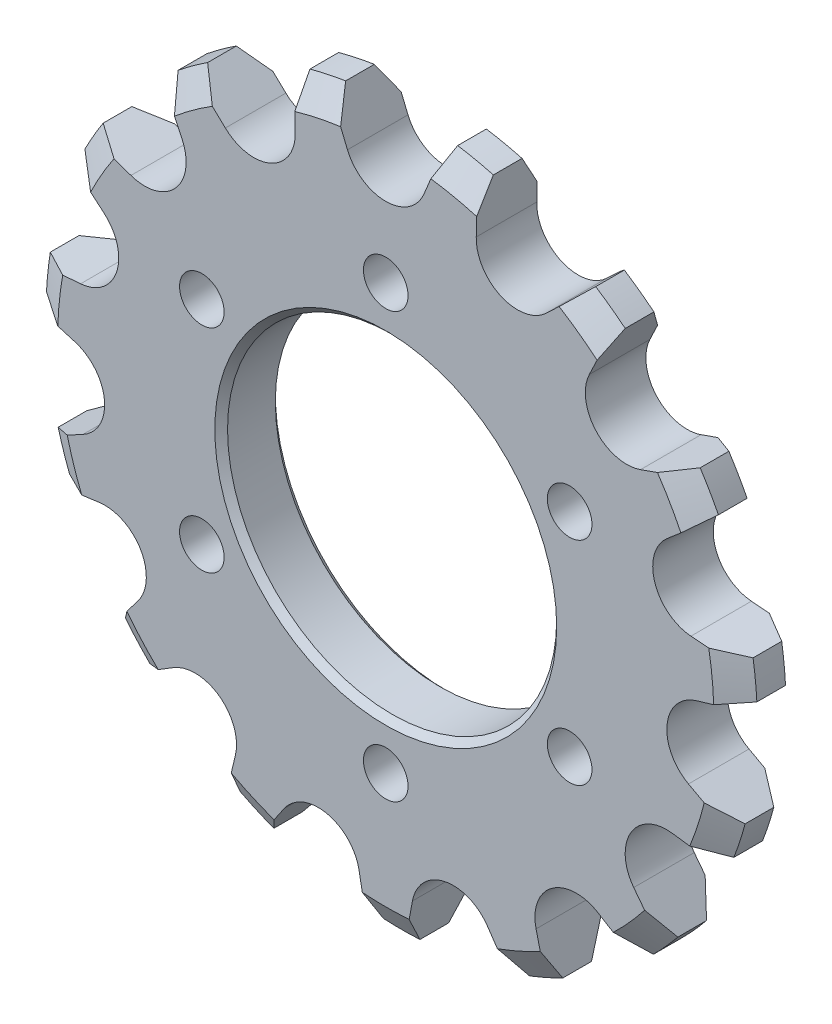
ISO-10303-21;
HEADER;
FILE_DESCRIPTION(('STEP AP214'),'2;1');
FILE_NAME('part.step','',(''),(''),'','','');
FILE_SCHEMA(('AUTOMOTIVE_DESIGN { 1 0 10303 214 1 1 1 1 }'));
ENDSEC;
DATA;
#1=APPLICATION_CONTEXT('core data for automotive mechanical design processes');
#2=APPLICATION_PROTOCOL_DEFINITION('international standard','automotive_design',2000,#1);
#3=PRODUCT_CONTEXT('',#1,'mechanical');
#4=PRODUCT('Part','Part','',(#3));
#5=PRODUCT_RELATED_PRODUCT_CATEGORY('part','',(#4));
#6=PRODUCT_DEFINITION_FORMATION('','',#4);
#7=PRODUCT_DEFINITION_CONTEXT('part definition',#1,'design');
#8=PRODUCT_DEFINITION('design','',#6,#7);
#9=PRODUCT_DEFINITION_SHAPE('','',#8);
#10=(LENGTH_UNIT() NAMED_UNIT(*) SI_UNIT(.MILLI.,.METRE.));
#11=(NAMED_UNIT(*) PLANE_ANGLE_UNIT() SI_UNIT($,.RADIAN.));
#12=(NAMED_UNIT(*) SI_UNIT($,.STERADIAN.) SOLID_ANGLE_UNIT());
#13=UNCERTAINTY_MEASURE_WITH_UNIT(LENGTH_MEASURE(1.E-05),#10,'distance_accuracy_value','');
#14=(GEOMETRIC_REPRESENTATION_CONTEXT(3) GLOBAL_UNCERTAINTY_ASSIGNED_CONTEXT((#13)) GLOBAL_UNIT_ASSIGNED_CONTEXT((#10,
#11,#12)) REPRESENTATION_CONTEXT('',''));
#15=CARTESIAN_POINT('',(0.,0.,0.));
#16=DIRECTION('',(0.,0.,1.));
#17=DIRECTION('',(1.,0.,0.));
#18=AXIS2_PLACEMENT_3D('',#15,#16,#17);
#19=CARTESIAN_POINT('',(0.,0.,5.7));
#20=DIRECTION('',(0.,0.,-1.));
#21=DIRECTION('',(-1.,0.,0.));
#22=AXIS2_PLACEMENT_3D('',#19,#20,#21);
#23=CYLINDRICAL_SURFACE('',#22,33.5);
#24=CARTESIAN_POINT('',(0.,0.,4.19999999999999));
#25=DIRECTION('',(0.,0.,1.));
#26=DIRECTION('',(1.,0.,0.));
#27=AXIS2_PLACEMENT_3D('',#24,#25,#26);
#28=CIRCLE('',#27,33.5);
#29=CARTESIAN_POINT('',(26.0128478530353,-21.108807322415,4.19999999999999));
#30=VERTEX_POINT('',#29);
#31=CARTESIAN_POINT('',(23.7122540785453,-23.6638755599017,4.19999999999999));
#32=VERTEX_POINT('',#31);
#33=EDGE_CURVE('E1730',#30,#32,#28,.F.);
#34=ORIENTED_EDGE('',*,*,#33,.T.);
#35=DIRECTION('',(0.,0.,1.));
#36=VECTOR('',#35,1.);
#37=CARTESIAN_POINT('',(23.7122540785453,-23.6638755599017,0.));
#38=LINE('',#37,#36);
#39=CARTESIAN_POINT('',(23.7122540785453,-23.6638755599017,1.50000000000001));
#40=VERTEX_POINT('',#39);
#41=EDGE_CURVE('E935',#40,#32,#38,.T.);
#42=ORIENTED_EDGE('',*,*,#41,.F.);
#43=CARTESIAN_POINT('',(0.,0.,1.50000000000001));
#44=DIRECTION('',(0.,0.,1.));
#45=DIRECTION('',(1.,0.,0.));
#46=AXIS2_PLACEMENT_3D('',#43,#44,#45);
#47=CIRCLE('',#46,33.5);
#48=CARTESIAN_POINT('',(26.0128478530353,-21.108807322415,1.50000000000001));
#49=VERTEX_POINT('',#48);
#50=EDGE_CURVE('E1944',#40,#49,#47,.T.);
#51=ORIENTED_EDGE('',*,*,#50,.T.);
#52=DIRECTION('',(0.,0.,1.));
#53=VECTOR('',#52,1.);
#54=CARTESIAN_POINT('',(26.0128478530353,-21.108807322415,0.));
#55=LINE('',#54,#53);
#56=EDGE_CURVE('E617',#49,#30,#55,.T.);
#57=ORIENTED_EDGE('',*,*,#56,.T.);
#58=EDGE_LOOP('',(#34,#42,#51,#57));
#59=FACE_BOUND('',#58,.T.);
#60=ADVANCED_FACE('F46',(#59),#23,.T.);
#61=CARTESIAN_POINT('',(12.0372566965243,-31.2626686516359,1.50000000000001));
#62=VERTEX_POINT('',#61);
#63=CARTESIAN_POINT('',(15.1781935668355,-29.8642334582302,1.50000000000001));
#64=VERTEX_POINT('',#63);
#65=EDGE_CURVE('E1938',#62,#64,#47,.T.);
#66=ORIENTED_EDGE('',*,*,#65,.T.);
#67=DIRECTION('',(0.,0.,1.));
#68=VECTOR('',#67,1.);
#69=CARTESIAN_POINT('',(15.1781935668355,-29.8642334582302,0.));
#70=LINE('',#69,#68);
#71=CARTESIAN_POINT('',(15.1781935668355,-29.8642334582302,4.19999999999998));
#72=VERTEX_POINT('',#71);
#73=EDGE_CURVE('E938',#64,#72,#70,.T.);
#74=ORIENTED_EDGE('',*,*,#73,.T.);
#75=CARTESIAN_POINT('',(12.0372566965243,-31.2626686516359,4.19999999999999));
#76=VERTEX_POINT('',#75);
#77=EDGE_CURVE('E1736',#72,#76,#28,.F.);
#78=ORIENTED_EDGE('',*,*,#77,.T.);
#79=DIRECTION('',(0.,0.,1.));
#80=VECTOR('',#79,1.);
#81=CARTESIAN_POINT('',(12.0372566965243,-31.2626686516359,0.));
#82=LINE('',#81,#80);
#83=EDGE_CURVE('E901',#62,#76,#82,.T.);
#84=ORIENTED_EDGE('',*,*,#83,.F.);
#85=EDGE_LOOP('',(#66,#74,#78,#84));
#86=FACE_BOUND('',#85,.T.);
#87=ADVANCED_FACE('F1521',(#86),#23,.T.);
#88=CARTESIAN_POINT('',(-1.71909172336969,-33.4558623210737,1.50000000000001));
#89=VERTEX_POINT('',#88);
#90=CARTESIAN_POINT('',(1.71909172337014,-33.4558623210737,1.50000000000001));
#91=VERTEX_POINT('',#90);
#92=EDGE_CURVE('E1934',#89,#91,#47,.T.);
#93=ORIENTED_EDGE('',*,*,#92,.T.);
#94=DIRECTION('',(0.,0.,1.));
#95=VECTOR('',#94,1.);
#96=CARTESIAN_POINT('',(1.71909172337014,-33.4558623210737,0.));
#97=LINE('',#96,#95);
#98=CARTESIAN_POINT('',(1.71909172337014,-33.4558623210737,4.19999999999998));
#99=VERTEX_POINT('',#98);
#100=EDGE_CURVE('E904',#91,#99,#97,.T.);
#101=ORIENTED_EDGE('',*,*,#100,.T.);
#102=CARTESIAN_POINT('',(-1.71909172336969,-33.4558623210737,4.19999999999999));
#103=VERTEX_POINT('',#102);
#104=EDGE_CURVE('E1741',#99,#103,#28,.F.);
#105=ORIENTED_EDGE('',*,*,#104,.T.);
#106=DIRECTION('',(0.,0.,1.));
#107=VECTOR('',#106,1.);
#108=CARTESIAN_POINT('',(-1.71909172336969,-33.4558623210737,0.));
#109=LINE('',#108,#107);
#110=EDGE_CURVE('E865',#89,#103,#109,.T.);
#111=ORIENTED_EDGE('',*,*,#110,.F.);
#112=EDGE_LOOP('',(#93,#101,#105,#111));
#113=FACE_BOUND('',#112,.T.);
#114=ADVANCED_FACE('F1933',(#113),#23,.T.);
#115=CARTESIAN_POINT('',(-15.1781935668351,-29.8642334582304,1.50000000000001));
#116=VERTEX_POINT('',#115);
#117=CARTESIAN_POINT('',(-12.0372566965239,-31.2626686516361,1.50000000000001));
#118=VERTEX_POINT('',#117);
#119=EDGE_CURVE('E1937',#116,#118,#47,.T.);
#120=ORIENTED_EDGE('',*,*,#119,.T.);
#121=DIRECTION('',(0.,0.,1.));
#122=VECTOR('',#121,1.);
#123=CARTESIAN_POINT('',(-12.0372566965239,-31.2626686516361,0.));
#124=LINE('',#123,#122);
#125=CARTESIAN_POINT('',(-12.0372566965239,-31.2626686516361,4.19999999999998));
#126=VERTEX_POINT('',#125);
#127=EDGE_CURVE('E868',#118,#126,#124,.T.);
#128=ORIENTED_EDGE('',*,*,#127,.T.);
#129=CARTESIAN_POINT('',(-15.1781935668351,-29.8642334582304,4.19999999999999));
#130=VERTEX_POINT('',#129);
#131=EDGE_CURVE('E1747',#126,#130,#28,.F.);
#132=ORIENTED_EDGE('',*,*,#131,.T.);
#133=DIRECTION('',(0.,0.,1.));
#134=VECTOR('',#133,1.);
#135=CARTESIAN_POINT('',(-15.1781935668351,-29.8642334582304,0.));
#136=LINE('',#135,#134);
#137=EDGE_CURVE('E829',#116,#130,#136,.T.);
#138=ORIENTED_EDGE('',*,*,#137,.F.);
#139=EDGE_LOOP('',(#120,#128,#132,#138));
#140=FACE_BOUND('',#139,.T.);
#141=ADVANCED_FACE('F2094',(#140),#23,.T.);
#142=CARTESIAN_POINT('',(-26.012847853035,-21.1088073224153,1.50000000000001));
#143=VERTEX_POINT('',#142);
#144=CARTESIAN_POINT('',(-23.712254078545,-23.663875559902,1.50000000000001));
#145=VERTEX_POINT('',#144);
#146=EDGE_CURVE('E1942',#143,#145,#47,.T.);
#147=ORIENTED_EDGE('',*,*,#146,.T.);
#148=DIRECTION('',(0.,0.,1.));
#149=VECTOR('',#148,1.);
#150=CARTESIAN_POINT('',(-23.712254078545,-23.663875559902,0.));
#151=LINE('',#150,#149);
#152=CARTESIAN_POINT('',(-23.712254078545,-23.663875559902,4.19999999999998));
#153=VERTEX_POINT('',#152);
#154=EDGE_CURVE('E832',#145,#153,#151,.T.);
#155=ORIENTED_EDGE('',*,*,#154,.T.);
#156=CARTESIAN_POINT('',(-26.012847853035,-21.1088073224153,4.19999999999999));
#157=VERTEX_POINT('',#156);
#158=EDGE_CURVE('E1753',#153,#157,#28,.F.);
#159=ORIENTED_EDGE('',*,*,#158,.T.);
#160=DIRECTION('',(0.,0.,1.));
#161=VECTOR('',#160,1.);
#162=CARTESIAN_POINT('',(-26.012847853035,-21.1088073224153,0.));
#163=LINE('',#162,#161);
#164=EDGE_CURVE('E1079',#143,#157,#163,.T.);
#165=ORIENTED_EDGE('',*,*,#164,.F.);
#166=EDGE_LOOP('',(#147,#155,#159,#165));
#167=FACE_BOUND('',#166,.T.);
#168=ADVANCED_FACE('F2069',(#167),#23,.T.);
#169=CARTESIAN_POINT('',(-32.3496444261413,-8.70347663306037,1.50000000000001));
#170=VERTEX_POINT('',#169);
#171=CARTESIAN_POINT('',(-31.28718731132,-11.9733834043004,1.50000000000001));
#172=VERTEX_POINT('',#171);
#173=EDGE_CURVE('E2063',#170,#172,#47,.T.);
#174=ORIENTED_EDGE('',*,*,#173,.T.);
#175=DIRECTION('',(0.,0.,1.));
#176=VECTOR('',#175,1.);
#177=CARTESIAN_POINT('',(-31.28718731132,-11.9733834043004,0.));
#178=LINE('',#177,#176);
#179=CARTESIAN_POINT('',(-31.28718731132,-11.9733834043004,4.19999999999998));
#180=VERTEX_POINT('',#179);
#181=EDGE_CURVE('E1082',#172,#180,#178,.T.);
#182=ORIENTED_EDGE('',*,*,#181,.T.);
#183=CARTESIAN_POINT('',(-32.3496444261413,-8.70347663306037,4.19999999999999));
#184=VERTEX_POINT('',#183);
#185=EDGE_CURVE('E1759',#180,#184,#28,.F.);
#186=ORIENTED_EDGE('',*,*,#185,.T.);
#187=DIRECTION('',(0.,0.,1.));
#188=VECTOR('',#187,1.);
#189=CARTESIAN_POINT('',(-32.3496444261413,-8.70347663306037,0.));
#190=LINE('',#189,#188);
#191=EDGE_CURVE('E1045',#170,#184,#190,.T.);
#192=ORIENTED_EDGE('',*,*,#191,.F.);
#193=EDGE_LOOP('',(#174,#182,#186,#192));
#194=FACE_BOUND('',#193,.T.);
#195=ADVANCED_FACE('F2065',(#194),#23,.T.);
#196=CARTESIAN_POINT('',(-33.0928935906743,5.20676423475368,1.50000000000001));
#197=VERTEX_POINT('',#196);
#198=CARTESIAN_POINT('',(-33.4522816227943,1.78741551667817,1.50000000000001));
#199=VERTEX_POINT('',#198);
#200=EDGE_CURVE('E1553',#197,#199,#47,.T.);
#201=ORIENTED_EDGE('',*,*,#200,.T.);
#202=DIRECTION('',(0.,0.,1.));
#203=VECTOR('',#202,1.);
#204=CARTESIAN_POINT('',(-33.4522816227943,1.78741551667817,0.));
#205=LINE('',#204,#203);
#206=CARTESIAN_POINT('',(-33.4522816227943,1.78741551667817,4.19999999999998));
#207=VERTEX_POINT('',#206);
#208=EDGE_CURVE('E1048',#199,#207,#205,.T.);
#209=ORIENTED_EDGE('',*,*,#208,.T.);
#210=CARTESIAN_POINT('',(-33.0928935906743,5.20676423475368,4.19999999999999));
#211=VERTEX_POINT('',#210);
#212=EDGE_CURVE('E1699',#207,#211,#28,.F.);
#213=ORIENTED_EDGE('',*,*,#212,.T.);
#214=DIRECTION('',(0.,0.,1.));
#215=VECTOR('',#214,1.);
#216=CARTESIAN_POINT('',(-33.0928935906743,5.20676423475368,0.));
#217=LINE('',#216,#215);
#218=EDGE_CURVE('E1009',#197,#211,#217,.T.);
#219=ORIENTED_EDGE('',*,*,#218,.F.);
#220=EDGE_LOOP('',(#201,#209,#213,#219));
#221=FACE_BOUND('',#220,.T.);
#222=ADVANCED_FACE('F1774',(#221),#23,.T.);
#223=CARTESIAN_POINT('',(-28.1140808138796,18.2167082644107,1.50000000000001));
#224=VERTEX_POINT('',#223);
#225=CARTESIAN_POINT('',(-29.8331725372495,15.2391540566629,1.50000000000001));
#226=VERTEX_POINT('',#225);
#227=EDGE_CURVE('E1546',#224,#226,#47,.T.);
#228=ORIENTED_EDGE('',*,*,#227,.T.);
#229=DIRECTION('',(0.,0.,1.));
#230=VECTOR('',#229,1.);
#231=CARTESIAN_POINT('',(-29.8331725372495,15.2391540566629,0.));
#232=LINE('',#231,#230);
#233=CARTESIAN_POINT('',(-29.8331725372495,15.2391540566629,4.19999999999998));
#234=VERTEX_POINT('',#233);
#235=EDGE_CURVE('E1012',#226,#234,#232,.T.);
#236=ORIENTED_EDGE('',*,*,#235,.T.);
#237=CARTESIAN_POINT('',(-28.1140808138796,18.2167082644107,4.19999999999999));
#238=VERTEX_POINT('',#237);
#239=EDGE_CURVE('E1653',#234,#238,#28,.F.);
#240=ORIENTED_EDGE('',*,*,#239,.T.);
#241=DIRECTION('',(0.,0.,1.));
#242=VECTOR('',#241,1.);
#243=CARTESIAN_POINT('',(-28.1140808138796,18.2167082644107,0.));
#244=LINE('',#243,#242);
#245=EDGE_CURVE('E973',#224,#238,#244,.T.);
#246=ORIENTED_EDGE('',*,*,#245,.F.);
#247=EDGE_LOOP('',(#228,#236,#240,#246));
#248=FACE_BOUND('',#247,.T.);
#249=ADVANCED_FACE('F2644',(#248),#23,.T.);
#250=CARTESIAN_POINT('',(32.3496444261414,-8.70347663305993,4.19999999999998));
#251=VERTEX_POINT('',#250);
#252=CARTESIAN_POINT('',(31.2871873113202,-11.9733834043,4.19999999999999));
#253=VERTEX_POINT('',#252);
#254=EDGE_CURVE('E1724',#251,#253,#28,.F.);
#255=ORIENTED_EDGE('',*,*,#254,.T.);
#256=DIRECTION('',(0.,0.,1.));
#257=VECTOR('',#256,1.);
#258=CARTESIAN_POINT('',(31.2871873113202,-11.9733834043,0.));
#259=LINE('',#258,#257);
#260=CARTESIAN_POINT('',(31.2871873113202,-11.9733834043,1.50000000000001));
#261=VERTEX_POINT('',#260);
#262=EDGE_CURVE('E653',#261,#253,#259,.T.);
#263=ORIENTED_EDGE('',*,*,#262,.F.);
#264=CARTESIAN_POINT('',(32.3496444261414,-8.70347663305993,1.50000000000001));
#265=VERTEX_POINT('',#264);
#266=EDGE_CURVE('E1948',#261,#265,#47,.T.);
#267=ORIENTED_EDGE('',*,*,#266,.T.);
#268=DIRECTION('',(0.,0.,1.));
#269=VECTOR('',#268,1.);
#270=CARTESIAN_POINT('',(32.3496444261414,-8.70347663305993,0.));
#271=LINE('',#270,#269);
#272=EDGE_CURVE('E689',#265,#251,#271,.T.);
#273=ORIENTED_EDGE('',*,*,#272,.T.);
#274=EDGE_LOOP('',(#255,#263,#267,#273));
#275=FACE_BOUND('',#274,.T.);
#276=ADVANCED_FACE('F2651',(#275),#23,.T.);
#277=CARTESIAN_POINT('',(33.0928935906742,5.20676423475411,4.19999999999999));
#278=VERTEX_POINT('',#277);
#279=CARTESIAN_POINT('',(33.4522816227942,1.78741551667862,4.19999999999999));
#280=VERTEX_POINT('',#279);
#281=EDGE_CURVE('E1718',#278,#280,#28,.F.);
#282=ORIENTED_EDGE('',*,*,#281,.T.);
#283=DIRECTION('',(0.,0.,1.));
#284=VECTOR('',#283,1.);
#285=CARTESIAN_POINT('',(33.4522816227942,1.78741551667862,0.));
#286=LINE('',#285,#284);
#287=CARTESIAN_POINT('',(33.4522816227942,1.78741551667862,1.50000000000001));
#288=VERTEX_POINT('',#287);
#289=EDGE_CURVE('E686',#288,#280,#286,.T.);
#290=ORIENTED_EDGE('',*,*,#289,.F.);
#291=CARTESIAN_POINT('',(33.0928935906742,5.20676423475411,1.50000000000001));
#292=VERTEX_POINT('',#291);
#293=EDGE_CURVE('E1952',#288,#292,#47,.T.);
#294=ORIENTED_EDGE('',*,*,#293,.T.);
#295=DIRECTION('',(0.,0.,1.));
#296=VECTOR('',#295,1.);
#297=CARTESIAN_POINT('',(33.0928935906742,5.20676423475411,0.));
#298=LINE('',#297,#296);
#299=EDGE_CURVE('E725',#292,#278,#298,.T.);
#300=ORIENTED_EDGE('',*,*,#299,.T.);
#301=EDGE_LOOP('',(#282,#290,#294,#300));
#302=FACE_BOUND('',#301,.T.);
#303=ADVANCED_FACE('F2659',(#302),#23,.T.);
#304=CARTESIAN_POINT('',(28.1140808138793,18.2167082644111,4.19999999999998));
#305=VERTEX_POINT('',#304);
#306=CARTESIAN_POINT('',(29.8331725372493,15.2391540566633,4.19999999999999));
#307=VERTEX_POINT('',#306);
#308=EDGE_CURVE('E1712',#305,#307,#28,.F.);
#309=ORIENTED_EDGE('',*,*,#308,.T.);
#310=DIRECTION('',(0.,0.,1.));
#311=VECTOR('',#310,1.);
#312=CARTESIAN_POINT('',(29.8331725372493,15.2391540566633,0.));
#313=LINE('',#312,#311);
#314=CARTESIAN_POINT('',(29.8331725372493,15.2391540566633,1.50000000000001));
#315=VERTEX_POINT('',#314);
#316=EDGE_CURVE('E722',#315,#307,#313,.T.);
#317=ORIENTED_EDGE('',*,*,#316,.F.);
#318=CARTESIAN_POINT('',(28.1140808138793,18.2167082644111,1.50000000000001));
#319=VERTEX_POINT('',#318);
#320=EDGE_CURVE('E1956',#315,#319,#47,.T.);
#321=ORIENTED_EDGE('',*,*,#320,.T.);
#322=DIRECTION('',(0.,0.,1.));
#323=VECTOR('',#322,1.);
#324=CARTESIAN_POINT('',(28.1140808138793,18.2167082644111,0.));
#325=LINE('',#324,#323);
#326=EDGE_CURVE('E760',#319,#305,#325,.T.);
#327=ORIENTED_EDGE('',*,*,#326,.T.);
#328=EDGE_LOOP('',(#309,#317,#321,#327));
#329=FACE_BOUND('',#328,.T.);
#330=ADVANCED_FACE('F2666',(#329),#23,.T.);
#331=CARTESIAN_POINT('',(18.2740880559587,28.0768179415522,4.19999999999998));
#332=VERTEX_POINT('',#331);
#333=CARTESIAN_POINT('',(21.0556368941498,26.0559044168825,4.19999999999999));
#334=VERTEX_POINT('',#333);
#335=EDGE_CURVE('E1705',#332,#334,#28,.F.);
#336=ORIENTED_EDGE('',*,*,#335,.T.);
#337=DIRECTION('',(0.,0.,1.));
#338=VECTOR('',#337,1.);
#339=CARTESIAN_POINT('',(21.0556368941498,26.0559044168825,0.));
#340=LINE('',#339,#338);
#341=CARTESIAN_POINT('',(21.0556368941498,26.0559044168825,1.50000000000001));
#342=VERTEX_POINT('',#341);
#343=EDGE_CURVE('E757',#342,#334,#340,.T.);
#344=ORIENTED_EDGE('',*,*,#343,.F.);
#345=CARTESIAN_POINT('',(18.2740880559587,28.0768179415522,1.50000000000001));
#346=VERTEX_POINT('',#345);
#347=EDGE_CURVE('E1710',#342,#346,#47,.T.);
#348=ORIENTED_EDGE('',*,*,#347,.T.);
#349=DIRECTION('',(0.,0.,1.));
#350=VECTOR('',#349,1.);
#351=CARTESIAN_POINT('',(18.2740880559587,28.0768179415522,0.));
#352=LINE('',#351,#350);
#353=EDGE_CURVE('E794',#346,#332,#352,.T.);
#354=ORIENTED_EDGE('',*,*,#353,.T.);
#355=EDGE_LOOP('',(#336,#344,#348,#354));
#356=FACE_BOUND('',#355,.T.);
#357=ADVANCED_FACE('F1533',(#356),#23,.T.);
#358=CARTESIAN_POINT('',(5.274339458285,33.0821907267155,4.19999999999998));
#359=VERTEX_POINT('',#358);
#360=CARTESIAN_POINT('',(8.63739034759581,32.3673521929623,4.19999999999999));
#361=VERTEX_POINT('',#360);
#362=EDGE_CURVE('E1555',#359,#361,#28,.F.);
#363=ORIENTED_EDGE('',*,*,#362,.T.);
#364=DIRECTION('',(0.,0.,1.));
#365=VECTOR('',#364,1.);
#366=CARTESIAN_POINT('',(8.63739034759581,32.3673521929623,0.));
#367=LINE('',#366,#365);
#368=CARTESIAN_POINT('',(8.63739034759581,32.3673521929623,1.50000000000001));
#369=VERTEX_POINT('',#368);
#370=EDGE_CURVE('E791',#369,#361,#367,.T.);
#371=ORIENTED_EDGE('',*,*,#370,.F.);
#372=CARTESIAN_POINT('',(5.274339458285,33.0821907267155,1.50000000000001));
#373=VERTEX_POINT('',#372);
#374=EDGE_CURVE('E1551',#369,#373,#47,.T.);
#375=ORIENTED_EDGE('',*,*,#374,.T.);
#376=DIRECTION('',(0.,0.,1.));
#377=VECTOR('',#376,1.);
#378=CARTESIAN_POINT('',(5.274339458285,33.0821907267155,0.));
#379=LINE('',#378,#377);
#380=EDGE_CURVE('E1474',#373,#359,#379,.T.);
#381=ORIENTED_EDGE('',*,*,#380,.T.);
#382=EDGE_LOOP('',(#363,#371,#375,#381));
#383=FACE_BOUND('',#382,.T.);
#384=ADVANCED_FACE('F1525',(#383),#23,.T.);
#385=CARTESIAN_POINT('',(-18.274088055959,28.076817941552,1.50000000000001));
#386=VERTEX_POINT('',#385);
#387=CARTESIAN_POINT('',(-21.0556368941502,26.0559044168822,1.50000000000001));
#388=VERTEX_POINT('',#387);
#389=EDGE_CURVE('E1538',#386,#388,#47,.T.);
#390=ORIENTED_EDGE('',*,*,#389,.T.);
#391=DIRECTION('',(0.,0.,1.));
#392=VECTOR('',#391,1.);
#393=CARTESIAN_POINT('',(-21.0556368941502,26.0559044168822,0.));
#394=LINE('',#393,#392);
#395=CARTESIAN_POINT('',(-21.0556368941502,26.0559044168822,4.19999999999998));
#396=VERTEX_POINT('',#395);
#397=EDGE_CURVE('E976',#388,#396,#394,.T.);
#398=ORIENTED_EDGE('',*,*,#397,.T.);
#399=CARTESIAN_POINT('',(-18.274088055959,28.076817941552,4.19999999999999));
#400=VERTEX_POINT('',#399);
#401=EDGE_CURVE('E1694',#396,#400,#28,.F.);
#402=ORIENTED_EDGE('',*,*,#401,.T.);
#403=DIRECTION('',(0.,0.,1.));
#404=VECTOR('',#403,1.);
#405=CARTESIAN_POINT('',(-18.274088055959,28.076817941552,0.));
#406=LINE('',#405,#404);
#407=EDGE_CURVE('E1115',#386,#400,#406,.T.);
#408=ORIENTED_EDGE('',*,*,#407,.F.);
#409=EDGE_LOOP('',(#390,#398,#402,#408));
#410=FACE_BOUND('',#409,.T.);
#411=ADVANCED_FACE('F1512',(#410),#23,.T.);
#412=CARTESIAN_POINT('',(0.,0.,1.50000000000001));
#413=DIRECTION('',(0.,0.,1.));
#414=DIRECTION('',(1.,0.,0.));
#415=AXIS2_PLACEMENT_3D('',#412,#413,#414);
#416=CONICAL_SURFACE('',#415,33.5,1.0471975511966);
#417=CARTESIAN_POINT('',(21.4288399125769,-22.2645975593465,-0.000200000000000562));
#418=CARTESIAN_POINT('',(21.8096705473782,-22.4979708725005,0.249377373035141));
#419=CARTESIAN_POINT('',(22.1903870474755,-22.731274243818,0.499193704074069));
#420=CARTESIAN_POINT('',(22.9515917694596,-23.1977410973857,0.999304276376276));
#421=CARTESIAN_POINT('',(23.3320799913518,-23.4309045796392,1.2495985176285));
#422=CARTESIAN_POINT('',(23.7124540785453,-23.6639981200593,1.50013171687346));
#423=B_SPLINE_CURVE_WITH_KNOTS('',3,(#417,#418,#419,#420,#421,#422),.UNSPECIFIED.,.F.,.F.,(4,2,
4),(0.,1.53494411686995,3.06988819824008),.UNSPECIFIED.);
#424=CARTESIAN_POINT('',(21.4291451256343,-22.2647845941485,0.));
#425=VERTEX_POINT('',#424);
#426=EDGE_CURVE('E1428',#425,#40,#423,.T.);
#427=ORIENTED_EDGE('',*,*,#426,.F.);
#428=CARTESIAN_POINT('',(0.,0.,0.));
#429=DIRECTION('',(0.,0.,1.));
#430=DIRECTION('',(1.,0.,0.));
#431=AXIS2_PLACEMENT_3D('',#428,#429,#430);
#432=CIRCLE('',#431,30.9019237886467);
#433=CARTESIAN_POINT('',(24.3827713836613,-18.9844503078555,0.));
#434=VERTEX_POINT('',#433);
#435=EDGE_CURVE('E1981',#434,#425,#432,.F.);
#436=ORIENTED_EDGE('',*,*,#435,.F.);
#437=CARTESIAN_POINT('',(26.0130013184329,-21.1090073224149,1.50014155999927));
#438=CARTESIAN_POINT('',(25.741422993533,-20.7550795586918,1.24960671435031));
#439=CARTESIAN_POINT('',(25.4697631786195,-20.4010455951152,0.999310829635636));
#440=CARTESIAN_POINT('',(24.9262805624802,-19.6927652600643,0.499196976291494));
#441=CARTESIAN_POINT('',(24.6544577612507,-19.3385188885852,0.249379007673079));
#442=CARTESIAN_POINT('',(24.3825534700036,-18.9841663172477,-0.000199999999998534));
#443=B_SPLINE_CURVE_WITH_KNOTS('',3,(#437,#438,#439,#440,#441,#442),.UNSPECIFIED.,.F.,.F.,(4,2,
4),(0.,1.53495413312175,3.06990830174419),.UNSPECIFIED.);
#444=EDGE_CURVE('E624',#49,#434,#443,.T.);
#445=ORIENTED_EDGE('',*,*,#444,.F.);
#446=ORIENTED_EDGE('',*,*,#50,.F.);
#447=EDGE_LOOP('',(#427,#436,#445,#446));
#448=FACE_BOUND('',#447,.T.);
#449=ADVANCED_FACE('F1524',(#448),#416,.T.);
#450=CARTESIAN_POINT('',(15.1782415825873,-29.8644334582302,1.50011549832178));
#451=CARTESIAN_POINT('',(15.0740996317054,-29.4306510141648,1.24958501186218));
#452=CARTESIAN_POINT('',(14.9699264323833,-28.9967384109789,0.999293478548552));
#453=CARTESIAN_POINT('',(14.7615175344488,-28.1286528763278,0.49918831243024));
#454=CARTESIAN_POINT('',(14.657281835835,-27.6944799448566,0.24937467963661));
#455=CARTESIAN_POINT('',(14.5530148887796,-27.2601768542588,-0.000200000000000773));
#456=B_SPLINE_CURVE_WITH_KNOTS('',3,(#450,#451,#452,#453,#454,#455),.UNSPECIFIED.,.F.,.F.,(4,2,
4),(0.,1.5349275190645,3.06985507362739),.UNSPECIFIED.);
#457=CARTESIAN_POINT('',(14.5530984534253,-27.2605249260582,0.));
#458=VERTEX_POINT('',#457);
#459=EDGE_CURVE('E1420',#64,#458,#456,.T.);
#460=ORIENTED_EDGE('',*,*,#459,.F.);
#461=ORIENTED_EDGE('',*,*,#65,.F.);
#462=CARTESIAN_POINT('',(10.5203916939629,-29.0556163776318,-0.000200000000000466));
#463=CARTESIAN_POINT('',(10.7733770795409,-29.42371239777,0.249378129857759));
#464=CARTESIAN_POINT('',(11.0262866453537,-29.7916980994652,0.499195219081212));
#465=CARTESIAN_POINT('',(11.5319541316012,-30.5274488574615,0.999307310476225));
#466=CARTESIAN_POINT('',(11.7847120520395,-30.8952139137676,1.24960231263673));
#467=CARTESIAN_POINT('',(12.0373941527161,-31.2628686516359,1.50013627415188));
#468=B_SPLINE_CURVE_WITH_KNOTS('',3,(#462,#463,#464,#465,#466,#467),.UNSPECIFIED.,.F.,.F.,(4,2,
4),(0.,1.53494877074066,3.06989750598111),.UNSPECIFIED.);
#469=CARTESIAN_POINT('',(10.5205944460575,-29.05591138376,0.));
#470=VERTEX_POINT('',#469);
#471=EDGE_CURVE('E1429',#470,#62,#468,.T.);
#472=ORIENTED_EDGE('',*,*,#471,.F.);
#473=EDGE_CURVE('E1984',#458,#470,#432,.F.);
#474=ORIENTED_EDGE('',*,*,#473,.F.);
#475=EDGE_LOOP('',(#460,#461,#472,#474));
#476=FACE_BOUND('',#475,.T.);
#477=ADVANCED_FACE('F1531',(#476),#416,.T.);
#478=CARTESIAN_POINT('',(1.71905465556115,-33.4560623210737,1.5001142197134));
#479=CARTESIAN_POINT('',(1.80035139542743,-33.0174243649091,1.24958394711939));
#480=CARTESIAN_POINT('',(1.88167252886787,-32.5786547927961,0.999292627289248));
#481=CARTESIAN_POINT('',(2.04436358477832,-31.7008524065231,0.499187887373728));
#482=CARTESIAN_POINT('',(2.12573350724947,-31.2618195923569,0.249374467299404));
#483=CARTESIAN_POINT('',(2.20712782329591,-30.8226551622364,-0.000200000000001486));
#484=B_SPLINE_CURVE_WITH_KNOTS('',3,(#478,#479,#480,#481,#482,#483),.UNSPECIFIED.,.F.,.F.,(4,2,
4),(0.,1.53492621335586,3.06985246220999),.UNSPECIFIED.);
#485=CARTESIAN_POINT('',(2.20706258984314,-30.8230071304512,0.));
#486=VERTEX_POINT('',#485);
#487=EDGE_CURVE('E1915',#91,#486,#484,.T.);
#488=ORIENTED_EDGE('',*,*,#487,.F.);
#489=ORIENTED_EDGE('',*,*,#92,.F.);
#490=CARTESIAN_POINT('',(-2.20712782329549,-30.8226551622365,-0.000200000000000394));
#491=CARTESIAN_POINT('',(-2.12573350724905,-31.261819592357,0.249374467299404));
#492=CARTESIAN_POINT('',(-2.04436358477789,-31.7008524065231,0.499187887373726));
#493=CARTESIAN_POINT('',(-1.88167252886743,-32.5786547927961,0.999292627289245));
#494=CARTESIAN_POINT('',(-1.80035139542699,-33.0174243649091,1.24958394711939));
#495=CARTESIAN_POINT('',(-1.7190546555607,-33.4560623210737,1.5001142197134));
#496=B_SPLINE_CURVE_WITH_KNOTS('',3,(#490,#491,#492,#493,#494,#495),.UNSPECIFIED.,.F.,.F.,(4,2,
4),(0.,1.53492624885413,3.06985246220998),.UNSPECIFIED.);
#497=CARTESIAN_POINT('',(-2.20706258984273,-30.8230071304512,0.));
#498=VERTEX_POINT('',#497);
#499=EDGE_CURVE('E1888',#498,#89,#496,.T.);
#500=ORIENTED_EDGE('',*,*,#499,.F.);
#501=EDGE_CURVE('E1987',#486,#498,#432,.F.);
#502=ORIENTED_EDGE('',*,*,#501,.F.);
#503=EDGE_LOOP('',(#488,#489,#500,#502));
#504=FACE_BOUND('',#503,.T.);
#505=ADVANCED_FACE('F1935',(#504),#416,.T.);
#506=CARTESIAN_POINT('',(-12.0373941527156,-31.2628686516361,1.50013627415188));
#507=CARTESIAN_POINT('',(-11.7847120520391,-30.8952139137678,1.24960231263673));
#508=CARTESIAN_POINT('',(-11.5319541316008,-30.5274488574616,0.999307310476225));
#509=CARTESIAN_POINT('',(-11.0262866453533,-29.7916980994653,0.499195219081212));
#510=CARTESIAN_POINT('',(-10.7733770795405,-29.4237123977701,0.249378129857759));
#511=CARTESIAN_POINT('',(-10.5203916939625,-29.0556163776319,-0.000199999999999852));
#512=B_SPLINE_CURVE_WITH_KNOTS('',3,(#506,#507,#508,#509,#510,#511),.UNSPECIFIED.,.F.,.F.,(4,2,
4),(0.,1.53494873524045,3.06989750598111),.UNSPECIFIED.);
#513=CARTESIAN_POINT('',(-10.5205944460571,-29.0559113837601,0.));
#514=VERTEX_POINT('',#513);
#515=EDGE_CURVE('E1875',#118,#514,#512,.T.);
#516=ORIENTED_EDGE('',*,*,#515,.F.);
#517=ORIENTED_EDGE('',*,*,#119,.F.);
#518=CARTESIAN_POINT('',(-14.5530148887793,-27.260176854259,-0.000200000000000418));
#519=CARTESIAN_POINT('',(-14.6572818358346,-27.6944799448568,0.249374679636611));
#520=CARTESIAN_POINT('',(-14.7615175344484,-28.128652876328,0.49918831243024));
#521=CARTESIAN_POINT('',(-14.9699264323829,-28.9967384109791,0.999293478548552));
#522=CARTESIAN_POINT('',(-15.074099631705,-29.430651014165,1.24958501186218));
#523=CARTESIAN_POINT('',(-15.1782415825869,-29.8644334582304,1.50011549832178));
#524=B_SPLINE_CURVE_WITH_KNOTS('',3,(#518,#519,#520,#521,#522,#523),.UNSPECIFIED.,.F.,.F.,(4,2,
4),(0.,1.53492755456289,3.06985507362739),.UNSPECIFIED.);
#525=CARTESIAN_POINT('',(-14.5530984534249,-27.2605249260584,0.));
#526=VERTEX_POINT('',#525);
#527=EDGE_CURVE('E1867',#526,#116,#524,.T.);
#528=ORIENTED_EDGE('',*,*,#527,.F.);
#529=EDGE_CURVE('E1990',#514,#526,#432,.F.);
#530=ORIENTED_EDGE('',*,*,#529,.F.);
#531=EDGE_LOOP('',(#516,#517,#528,#530));
#532=FACE_BOUND('',#531,.T.);
#533=ADVANCED_FACE('F2105',(#532),#416,.T.);
#534=CARTESIAN_POINT('',(-23.712454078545,-23.6639981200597,1.50013171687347));
#535=CARTESIAN_POINT('',(-23.3320799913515,-23.4309045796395,1.24959851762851));
#536=CARTESIAN_POINT('',(-22.9515917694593,-23.197741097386,0.999304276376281));
#537=CARTESIAN_POINT('',(-22.1903870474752,-22.7312742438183,0.499193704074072));
#538=CARTESIAN_POINT('',(-21.8096705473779,-22.4979708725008,0.249377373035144));
#539=CARTESIAN_POINT('',(-21.4288399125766,-22.2645975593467,-0.000199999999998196));
#540=B_SPLINE_CURVE_WITH_KNOTS('',3,(#534,#535,#536,#537,#538,#539),.UNSPECIFIED.,.F.,.F.,(4,2,
4),(0.,1.53494408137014,3.06988819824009),.UNSPECIFIED.);
#541=CARTESIAN_POINT('',(-21.429145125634,-22.2647845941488,0.));
#542=VERTEX_POINT('',#541);
#543=EDGE_CURVE('E1876',#145,#542,#540,.T.);
#544=ORIENTED_EDGE('',*,*,#543,.F.);
#545=ORIENTED_EDGE('',*,*,#146,.F.);
#546=CARTESIAN_POINT('',(-24.3825534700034,-18.984166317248,-0.00020000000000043));
#547=CARTESIAN_POINT('',(-24.6544577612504,-19.3385188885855,0.249379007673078));
#548=CARTESIAN_POINT('',(-24.9262805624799,-19.6927652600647,0.499196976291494));
#549=CARTESIAN_POINT('',(-25.4697631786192,-20.4010455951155,0.999310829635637));
#550=CARTESIAN_POINT('',(-25.7414229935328,-20.7550795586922,1.24960671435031));
#551=CARTESIAN_POINT('',(-26.0130013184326,-21.1090073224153,1.50014155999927));
#552=B_SPLINE_CURVE_WITH_KNOTS('',3,(#546,#547,#548,#549,#550,#551),.UNSPECIFIED.,.F.,.F.,(4,2,
4),(0.,1.53495416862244,3.0699083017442),.UNSPECIFIED.);
#553=CARTESIAN_POINT('',(-24.3827713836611,-18.9844503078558,0.));
#554=VERTEX_POINT('',#553);
#555=EDGE_CURVE('E2004',#554,#143,#552,.T.);
#556=ORIENTED_EDGE('',*,*,#555,.F.);
#557=EDGE_CURVE('E1805',#542,#554,#432,.F.);
#558=ORIENTED_EDGE('',*,*,#557,.F.);
#559=EDGE_LOOP('',(#544,#545,#556,#558));
#560=FACE_BOUND('',#559,.T.);
#561=ADVANCED_FACE('F2001',(#560),#416,.T.);
#562=CARTESIAN_POINT('',(-31.28738731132,-11.9734097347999,1.50011327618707));
#563=CARTESIAN_POINT('',(-30.8450960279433,-11.9151809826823,1.24958316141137));
#564=CARTESIAN_POINT('',(-30.4026720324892,-11.8569347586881,0.999291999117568));
#565=CARTESIAN_POINT('',(-29.5175586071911,-11.7404073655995,0.499187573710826));
#566=CARTESIAN_POINT('',(-29.0748691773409,-11.6821261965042,0.249374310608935));
#567=CARTESIAN_POINT('',(-28.6320470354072,-11.6238275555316,-0.000199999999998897));
#568=B_SPLINE_CURVE_WITH_KNOTS('',3,(#562,#563,#564,#565,#566,#567),.UNSPECIFIED.,.F.,.F.,(4,2,
4),(0.,1.53492524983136,3.06985053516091),.UNSPECIFIED.);
#569=CARTESIAN_POINT('',(-28.6324019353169,-11.6238742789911,0.));
#570=VERTEX_POINT('',#569);
#571=EDGE_CURVE('E2007',#172,#570,#568,.T.);
#572=ORIENTED_EDGE('',*,*,#571,.F.);
#573=ORIENTED_EDGE('',*,*,#173,.F.);
#574=CARTESIAN_POINT('',(-29.9961270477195,-7.42562095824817,-0.000200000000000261));
#575=CARTESIAN_POINT('',(-30.3886485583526,-7.6387427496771,0.24937672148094));
#576=CARTESIAN_POINT('',(-30.7810524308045,-7.85180066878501,0.499192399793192));
#577=CARTESIAN_POINT('',(-31.5656248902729,-8.27778875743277,0.999301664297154));
#578=CARTESIAN_POINT('',(-31.957793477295,-8.49071892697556,1.24959525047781));
#579=CARTESIAN_POINT('',(-32.3498444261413,-8.7035852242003,1.50012779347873));
#580=B_SPLINE_CURVE_WITH_KNOTS('',3,(#574,#575,#576,#577,#578,#579),.UNSPECIFIED.,.F.,.F.,(4,2,
4),(0.,1.53494011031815,3.06988018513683),.UNSPECIFIED.);
#581=CARTESIAN_POINT('',(-29.9964416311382,-7.42579176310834,0.));
#582=VERTEX_POINT('',#581);
#583=EDGE_CURVE('E2010',#582,#170,#580,.T.);
#584=ORIENTED_EDGE('',*,*,#583,.F.);
#585=EDGE_CURVE('E1800',#570,#582,#432,.F.);
#586=ORIENTED_EDGE('',*,*,#585,.F.);
#587=EDGE_LOOP('',(#572,#573,#584,#586));
#588=FACE_BOUND('',#587,.T.);
#589=ADVANCED_FACE('F2061',(#588),#416,.T.);
#590=CARTESIAN_POINT('',(-33.4524816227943,1.78747475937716,1.50011713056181));
#591=CARTESIAN_POINT('',(-33.0247435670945,1.66077297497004,1.24958637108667));
#592=CARTESIAN_POINT('',(-32.5968771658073,1.53403317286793,0.99929456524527));
#593=CARTESIAN_POINT('',(-31.74088766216,1.2804775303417,0.499188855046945));
#594=CARTESIAN_POINT('',(-31.3127645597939,1.15366168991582,0.249374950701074));
#595=CARTESIAN_POINT('',(-30.8845131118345,1.02680783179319,-0.0002000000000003));
#596=B_SPLINE_CURVE_WITH_KNOTS('',3,(#590,#591,#592,#593,#594,#595),.UNSPECIFIED.,.F.,.F.,(4,2,
4),(0.,1.53492918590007,3.06985840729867),.UNSPECIFIED.);
#597=CARTESIAN_POINT('',(-30.8848563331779,1.02690949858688,0.));
#598=VERTEX_POINT('',#597);
#599=EDGE_CURVE('E1795',#199,#598,#596,.T.);
#600=ORIENTED_EDGE('',*,*,#599,.F.);
#601=ORIENTED_EDGE('',*,*,#200,.F.);
#602=CARTESIAN_POINT('',(-30.4230977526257,5.41688172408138,-0.00020000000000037));
#603=CARTESIAN_POINT('',(-30.8683639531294,5.38183851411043,0.249374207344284));
#604=CARTESIAN_POINT('',(-31.3134967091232,5.34680580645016,0.499187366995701));
#605=CARTESIAN_POINT('',(-32.2034953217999,5.27676139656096,0.999291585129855));
#606=CARTESIAN_POINT('',(-32.6483611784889,5.24174969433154,1.24958264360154));
#607=CARTESIAN_POINT('',(-33.0930935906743,5.20674849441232,1.50011265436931));
#608=B_SPLINE_CURVE_WITH_KNOTS('',3,(#602,#603,#604,#605,#606,#607),.UNSPECIFIED.,.F.,.F.,(4,2,
4),(0.,1.53492465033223,3.06984926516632),.UNSPECIFIED.);
#609=CARTESIAN_POINT('',(-30.4234546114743,5.4168536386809,0.));
#610=VERTEX_POINT('',#609);
#611=EDGE_CURVE('E1787',#610,#197,#608,.T.);
#612=ORIENTED_EDGE('',*,*,#611,.F.);
#613=EDGE_CURVE('E1793',#598,#610,#432,.F.);
#614=ORIENTED_EDGE('',*,*,#613,.F.);
#615=EDGE_LOOP('',(#600,#601,#612,#614));
#616=FACE_BOUND('',#615,.T.);
#617=ADVANCED_FACE('F1792',(#616),#416,.T.);
#618=CARTESIAN_POINT('',(-29.8333725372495,15.2393248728,1.50014769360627));
#619=CARTESIAN_POINT('',(-29.4941417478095,14.9495944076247,1.24961182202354));
#620=CARTESIAN_POINT('',(-29.1548091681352,14.6597770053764,0.999314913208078));
#621=CARTESIAN_POINT('',(-28.4759404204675,14.0799683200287,0.499199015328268));
#622=CARTESIAN_POINT('',(-28.1364042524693,13.7899770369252,0.249380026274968));
#623=CARTESIAN_POINT('',(-27.7967662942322,13.4998988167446,-0.00020000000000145));
#624=B_SPLINE_CURVE_WITH_KNOTS('',3,(#618,#619,#620,#621,#622,#623),.UNSPECIFIED.,.F.,.F.,(4,2,
4),(0.,1.53496039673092,3.06992082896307),.UNSPECIFIED.);
#625=CARTESIAN_POINT('',(-27.7970384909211,13.5001312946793,0.));
#626=VERTEX_POINT('',#625);
#627=EDGE_CURVE('E1796',#226,#626,#624,.T.);
#628=ORIENTED_EDGE('',*,*,#627,.F.);
#629=ORIENTED_EDGE('',*,*,#227,.F.);
#630=CARTESIAN_POINT('',(-25.5896384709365,17.3227563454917,-0.000199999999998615));
#631=CARTESIAN_POINT('',(-26.0106645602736,17.4718495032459,0.249375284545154));
#632=CARTESIAN_POINT('',(-26.4315644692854,17.6208979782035,0.499189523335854));
#633=CARTESIAN_POINT('',(-27.2731119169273,17.9189055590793,0.999295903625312));
#634=CARTESIAN_POINT('',(-27.6937594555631,18.0678646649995,1.24958804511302));
#635=CARTESIAN_POINT('',(-28.1142808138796,18.2167790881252,1.50011914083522));
#636=B_SPLINE_CURVE_WITH_KNOTS('',3,(#630,#631,#632,#633,#634,#635),.UNSPECIFIED.,.F.,.F.,(4,2,
4),(0.,1.53493127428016,3.06986251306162),.UNSPECIFIED.);
#637=CARTESIAN_POINT('',(-25.5899759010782,17.3228758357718,0.));
#638=VERTEX_POINT('',#637);
#639=EDGE_CURVE('E2189',#638,#224,#636,.T.);
#640=ORIENTED_EDGE('',*,*,#639,.F.);
#641=EDGE_CURVE('E1801',#626,#638,#432,.F.);
#642=ORIENTED_EDGE('',*,*,#641,.F.);
#643=EDGE_LOOP('',(#628,#629,#640,#642));
#644=FACE_BOUND('',#643,.T.);
#645=ADVANCED_FACE('F2730',(#644),#416,.T.);
#646=CARTESIAN_POINT('',(28.6320470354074,-11.6238275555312,-0.000200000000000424));
#647=CARTESIAN_POINT('',(29.0748691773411,-11.6821261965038,0.249374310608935));
#648=CARTESIAN_POINT('',(29.5175586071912,-11.7404073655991,0.499187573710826));
#649=CARTESIAN_POINT('',(30.4026720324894,-11.8569347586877,0.999291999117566));
#650=CARTESIAN_POINT('',(30.8450960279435,-11.9151809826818,1.24958316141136));
#651=CARTESIAN_POINT('',(31.2873873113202,-11.9734097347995,1.50011327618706));
#652=B_SPLINE_CURVE_WITH_KNOTS('',3,(#646,#647,#648,#649,#650,#651),.UNSPECIFIED.,.F.,.F.,(4,2,
4),(0.,1.53492528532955,3.06985053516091),.UNSPECIFIED.);
#653=CARTESIAN_POINT('',(28.632401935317,-11.6238742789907,0.));
#654=VERTEX_POINT('',#653);
#655=EDGE_CURVE('E2169',#654,#261,#652,.T.);
#656=ORIENTED_EDGE('',*,*,#655,.F.);
#657=CARTESIAN_POINT('',(29.9964416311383,-7.42579176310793,0.));
#658=VERTEX_POINT('',#657);
#659=EDGE_CURVE('E1978',#658,#654,#432,.F.);
#660=ORIENTED_EDGE('',*,*,#659,.F.);
#661=CARTESIAN_POINT('',(32.3498444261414,-8.70358522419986,1.50012779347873));
#662=CARTESIAN_POINT('',(31.9577934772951,-8.49071892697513,1.24959525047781));
#663=CARTESIAN_POINT('',(31.565624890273,-8.27778875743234,0.999301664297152));
#664=CARTESIAN_POINT('',(30.7810524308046,-7.8518006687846,0.499192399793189));
#665=CARTESIAN_POINT('',(30.3886485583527,-7.63874274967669,0.249376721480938));
#666=CARTESIAN_POINT('',(29.9961270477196,-7.42562095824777,-0.000200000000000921));
#667=B_SPLINE_CURVE_WITH_KNOTS('',3,(#661,#662,#663,#664,#665,#666),.UNSPECIFIED.,.F.,.F.,(4,2,
4),(0.,1.53494007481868,3.06988018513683),.UNSPECIFIED.);
#668=EDGE_CURVE('E2917',#265,#658,#667,.T.);
#669=ORIENTED_EDGE('',*,*,#668,.F.);
#670=ORIENTED_EDGE('',*,*,#266,.F.);
#671=EDGE_LOOP('',(#656,#660,#669,#670));
#672=FACE_BOUND('',#671,.T.);
#673=ADVANCED_FACE('F2737',(#672),#416,.T.);
#674=CARTESIAN_POINT('',(30.8845131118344,1.02680783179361,-0.000200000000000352));
#675=CARTESIAN_POINT('',(31.3127645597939,1.15366168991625,0.249374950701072));
#676=CARTESIAN_POINT('',(31.74088766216,1.28047753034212,0.499188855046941));
#677=CARTESIAN_POINT('',(32.5968771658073,1.53403317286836,0.999294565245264));
#678=CARTESIAN_POINT('',(33.0247435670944,1.66077297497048,1.24958637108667));
#679=CARTESIAN_POINT('',(33.4524816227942,1.78747475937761,1.50011713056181));
#680=B_SPLINE_CURVE_WITH_KNOTS('',3,(#674,#675,#676,#677,#678,#679),.UNSPECIFIED.,.F.,.F.,(4,2,
4),(0.,1.53492922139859,3.06985840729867),.UNSPECIFIED.);
#681=CARTESIAN_POINT('',(30.8848563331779,1.0269094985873,0.));
#682=VERTEX_POINT('',#681);
#683=EDGE_CURVE('E2922',#682,#288,#680,.T.);
#684=ORIENTED_EDGE('',*,*,#683,.F.);
#685=CARTESIAN_POINT('',(30.4234546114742,5.41685363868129,0.));
#686=VERTEX_POINT('',#685);
#687=EDGE_CURVE('E1974',#686,#682,#432,.F.);
#688=ORIENTED_EDGE('',*,*,#687,.F.);
#689=CARTESIAN_POINT('',(33.0930935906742,5.20674849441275,1.5001126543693));
#690=CARTESIAN_POINT('',(32.6483611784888,5.24174969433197,1.24958264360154));
#691=CARTESIAN_POINT('',(32.2034953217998,5.27676139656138,0.999291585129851));
#692=CARTESIAN_POINT('',(31.3134967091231,5.34680580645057,0.499187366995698));
#693=CARTESIAN_POINT('',(30.8683639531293,5.38183851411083,0.249374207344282));
#694=CARTESIAN_POINT('',(30.4230977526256,5.41688172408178,-0.000200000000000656));
#695=B_SPLINE_CURVE_WITH_KNOTS('',3,(#689,#690,#691,#692,#693,#694),.UNSPECIFIED.,.F.,.F.,(4,2,
4),(0.,1.53492461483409,3.06984926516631),.UNSPECIFIED.);
#696=EDGE_CURVE('E2918',#292,#686,#695,.T.);
#697=ORIENTED_EDGE('',*,*,#696,.F.);
#698=ORIENTED_EDGE('',*,*,#293,.F.);
#699=EDGE_LOOP('',(#684,#688,#697,#698));
#700=FACE_BOUND('',#699,.T.);
#701=ADVANCED_FACE('F2745',(#700),#416,.T.);
#702=CARTESIAN_POINT('',(27.796766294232,13.499898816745,-0.000199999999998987));
#703=CARTESIAN_POINT('',(28.1364042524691,13.7899770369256,0.24938002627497));
#704=CARTESIAN_POINT('',(28.4759404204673,14.0799683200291,0.499199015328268));
#705=CARTESIAN_POINT('',(29.154809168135,14.6597770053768,0.999314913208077));
#706=CARTESIAN_POINT('',(29.4941417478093,14.9495944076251,1.24961182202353));
#707=CARTESIAN_POINT('',(29.8333725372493,15.2393248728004,1.50014769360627));
#708=B_SPLINE_CURVE_WITH_KNOTS('',3,(#702,#703,#704,#705,#706,#707),.UNSPECIFIED.,.F.,.F.,(4,2,
4),(0.,1.53496043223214,3.06992082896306),.UNSPECIFIED.);
#709=CARTESIAN_POINT('',(27.7970384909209,13.5001312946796,0.));
#710=VERTEX_POINT('',#709);
#711=EDGE_CURVE('E2914',#710,#315,#708,.T.);
#712=ORIENTED_EDGE('',*,*,#711,.F.);
#713=CARTESIAN_POINT('',(25.589975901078,17.3228758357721,0.));
#714=VERTEX_POINT('',#713);
#715=EDGE_CURVE('E1971',#714,#710,#432,.F.);
#716=ORIENTED_EDGE('',*,*,#715,.F.);
#717=CARTESIAN_POINT('',(28.1142808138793,18.2167790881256,1.50011914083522));
#718=CARTESIAN_POINT('',(27.6937594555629,18.0678646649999,1.24958804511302));
#719=CARTESIAN_POINT('',(27.273111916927,17.9189055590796,0.999295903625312));
#720=CARTESIAN_POINT('',(26.4315644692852,17.6208979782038,0.499189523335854));
#721=CARTESIAN_POINT('',(26.0106645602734,17.4718495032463,0.249375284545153));
#722=CARTESIAN_POINT('',(25.5896384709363,17.322756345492,-0.000199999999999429));
#723=B_SPLINE_CURVE_WITH_KNOTS('',3,(#717,#718,#719,#720,#721,#722),.UNSPECIFIED.,.F.,.F.,(4,2,
4),(0.,1.53493123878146,3.06986251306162),.UNSPECIFIED.);
#724=EDGE_CURVE('E1835',#319,#714,#723,.T.);
#725=ORIENTED_EDGE('',*,*,#724,.F.);
#726=ORIENTED_EDGE('',*,*,#320,.F.);
#727=EDGE_LOOP('',(#712,#716,#725,#726));
#728=FACE_BOUND('',#727,.T.);
#729=ADVANCED_FACE('F2753',(#728),#416,.T.);
#730=CARTESIAN_POINT('',(19.9027060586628,23.6387346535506,-0.000199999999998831));
#731=CARTESIAN_POINT('',(20.0949923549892,24.0418712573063,0.249376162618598));
#732=CARTESIAN_POINT('',(20.2872210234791,24.4448870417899,0.499191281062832));
#733=CARTESIAN_POINT('',(20.6715631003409,25.2506769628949,0.999299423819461));
#734=CARTESIAN_POINT('',(20.8636765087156,25.653451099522,1.2495924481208));
#735=CARTESIAN_POINT('',(21.0557322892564,26.0561044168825,1.50012442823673));
#736=B_SPLINE_CURVE_WITH_KNOTS('',3,(#730,#731,#732,#733,#734,#735),.UNSPECIFIED.,.F.,.F.,(4,2,
4),(0.,1.53493667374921,3.06987331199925),.UNSPECIFIED.);
#737=CARTESIAN_POINT('',(19.9028601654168,23.6390577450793,0.));
#738=VERTEX_POINT('',#737);
#739=EDGE_CURVE('E1968',#738,#342,#736,.T.);
#740=ORIENTED_EDGE('',*,*,#739,.F.);
#741=CARTESIAN_POINT('',(16.3317578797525,26.2336154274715,0.));
#742=VERTEX_POINT('',#741);
#743=EDGE_CURVE('E1560',#742,#738,#432,.F.);
#744=ORIENTED_EDGE('',*,*,#743,.F.);
#745=CARTESIAN_POINT('',(18.2742880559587,28.0770077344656,1.50015482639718));
#746=CARTESIAN_POINT('',(17.9506839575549,27.7699189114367,1.24961776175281));
#747=CARTESIAN_POINT('',(17.6269827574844,27.4627379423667,0.999319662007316));
#748=CARTESIAN_POINT('',(16.9793861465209,26.8481917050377,0.499201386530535));
#749=CARTESIAN_POINT('',(16.6554907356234,26.5408264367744,0.249381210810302));
#750=CARTESIAN_POINT('',(16.3314982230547,26.2333690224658,-0.000199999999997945));
#751=B_SPLINE_CURVE_WITH_KNOTS('',3,(#745,#746,#747,#748,#749,#750),.UNSPECIFIED.,.F.,.F.,(4,2,
4),(0.,1.53496768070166,3.06993539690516),.UNSPECIFIED.);
#752=EDGE_CURVE('E1829',#346,#742,#751,.T.);
#753=ORIENTED_EDGE('',*,*,#752,.F.);
#754=ORIENTED_EDGE('',*,*,#347,.F.);
#755=EDGE_LOOP('',(#740,#744,#753,#754));
#756=FACE_BOUND('',#755,.T.);
#757=ADVANCED_FACE('F1966',(#756),#416,.T.);
#758=CARTESIAN_POINT('',(8.56728713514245,29.6902185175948,-0.000199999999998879));
#759=CARTESIAN_POINT('',(8.57897888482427,30.1367084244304,0.249374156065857));
#760=CARTESIAN_POINT('',(8.59066713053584,30.5830645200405,0.499187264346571));
#761=CARTESIAN_POINT('',(8.61403661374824,31.4755090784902,0.999291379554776));
#762=CARTESIAN_POINT('',(8.62571785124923,31.9215975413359,1.24958238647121));
#763=CARTESIAN_POINT('',(8.63739558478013,32.3675521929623,1.50011234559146));
#764=B_SPLINE_CURVE_WITH_KNOTS('',3,(#758,#759,#760,#761,#762,#763),.UNSPECIFIED.,.F.,.F.,(4,2,
4),(0.,1.53492433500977,3.06984863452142),.UNSPECIFIED.);
#765=CARTESIAN_POINT('',(8.56729650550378,29.6905763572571,0.));
#766=VERTEX_POINT('',#765);
#767=EDGE_CURVE('E1831',#766,#369,#764,.T.);
#768=ORIENTED_EDGE('',*,*,#767,.F.);
#769=CARTESIAN_POINT('',(4.24963055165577,30.6083245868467,0.));
#770=VERTEX_POINT('',#769);
#771=EDGE_CURVE('E1556',#770,#766,#432,.F.);
#772=ORIENTED_EDGE('',*,*,#771,.F.);
#773=CARTESIAN_POINT('',(5.27442230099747,33.0823907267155,1.50012156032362));
#774=CARTESIAN_POINT('',(5.1037032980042,32.6702385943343,1.24959005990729));
#775=CARTESIAN_POINT('',(4.93293306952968,32.2579627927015,0.999297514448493));
#776=CARTESIAN_POINT('',(4.5912901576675,31.4331638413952,0.499190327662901));
#777=CARTESIAN_POINT('',(4.42041747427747,31.0206406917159,0.249375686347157));
#778=CARTESIAN_POINT('',(4.24949356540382,30.6079938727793,-0.000199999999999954));
#779=B_SPLINE_CURVE_WITH_KNOTS('',3,(#773,#774,#775,#776,#777,#778),.UNSPECIFIED.,.F.,.F.,(4,2,
4),(0.,1.5349337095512,3.06986745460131),.UNSPECIFIED.);
#780=EDGE_CURVE('E1469',#373,#770,#779,.T.);
#781=ORIENTED_EDGE('',*,*,#780,.F.);
#782=ORIENTED_EDGE('',*,*,#374,.F.);
#783=EDGE_LOOP('',(#768,#772,#781,#782));
#784=FACE_BOUND('',#783,.T.);
#785=ADVANCED_FACE('F2128',(#784),#416,.T.);
#786=CARTESIAN_POINT('',(-21.0557322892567,26.0561044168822,1.50012442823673));
#787=CARTESIAN_POINT('',(-20.863676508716,25.6534510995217,1.24959244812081));
#788=CARTESIAN_POINT('',(-20.6715631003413,25.2506769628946,0.999299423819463));
#789=CARTESIAN_POINT('',(-20.2872210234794,24.4448870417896,0.499191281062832));
#790=CARTESIAN_POINT('',(-20.0949923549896,24.041871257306,0.249376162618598));
#791=CARTESIAN_POINT('',(-19.9027060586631,23.6387346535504,-0.000199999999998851));
#792=B_SPLINE_CURVE_WITH_KNOTS('',3,(#786,#787,#788,#789,#790,#791),.UNSPECIFIED.,.F.,.F.,(4,2,
4),(0.,1.53493663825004,3.06987331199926),.UNSPECIFIED.);
#793=CARTESIAN_POINT('',(-19.9028601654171,23.6390577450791,0.));
#794=VERTEX_POINT('',#793);
#795=EDGE_CURVE('E2177',#388,#794,#792,.T.);
#796=ORIENTED_EDGE('',*,*,#795,.F.);
#797=ORIENTED_EDGE('',*,*,#389,.F.);
#798=CARTESIAN_POINT('',(-16.3314982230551,26.2333690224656,-0.000200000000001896));
#799=CARTESIAN_POINT('',(-16.6554907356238,26.5408264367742,0.2493812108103));
#800=CARTESIAN_POINT('',(-16.9793861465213,26.8481917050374,0.499201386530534));
#801=CARTESIAN_POINT('',(-17.6269827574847,27.4627379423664,0.999319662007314));
#802=CARTESIAN_POINT('',(-17.9506839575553,27.7699189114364,1.24961776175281));
#803=CARTESIAN_POINT('',(-18.274288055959,28.0770077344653,1.50015482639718));
#804=B_SPLINE_CURVE_WITH_KNOTS('',3,(#798,#799,#800,#801,#802,#803),.UNSPECIFIED.,.F.,.F.,(4,2,
4),(0.,1.5349677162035,3.06993539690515),.UNSPECIFIED.);
#805=CARTESIAN_POINT('',(-16.3317578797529,26.2336154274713,0.));
#806=VERTEX_POINT('',#805);
#807=EDGE_CURVE('E1132',#806,#386,#804,.T.);
#808=ORIENTED_EDGE('',*,*,#807,.F.);
#809=EDGE_CURVE('E1807',#794,#806,#432,.F.);
#810=ORIENTED_EDGE('',*,*,#809,.F.);
#811=EDGE_LOOP('',(#796,#797,#808,#810));
#812=FACE_BOUND('',#811,.T.);
#813=ADVANCED_FACE('F1827',(#812),#416,.T.);
#814=CARTESIAN_POINT('',(0.,0.,5.7));
#815=DIRECTION('',(0.,0.,-1.));
#816=DIRECTION('',(-1.,0.,0.));
#817=AXIS2_PLACEMENT_3D('',#814,#815,#816);
#818=CONICAL_SURFACE('',#817,30.9019237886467,1.0471975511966);
#819=CARTESIAN_POINT('',(23.7124540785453,-23.6639981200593,4.19986828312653));
#820=CARTESIAN_POINT('',(23.3320799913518,-23.4309045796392,4.45040148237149));
#821=CARTESIAN_POINT('',(22.9515917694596,-23.1977410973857,4.70069572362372));
#822=CARTESIAN_POINT('',(22.1903870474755,-22.731274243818,5.20080629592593));
#823=CARTESIAN_POINT('',(21.8096705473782,-22.4979708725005,5.45062262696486));
#824=CARTESIAN_POINT('',(21.4288399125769,-22.2645975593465,5.7002));
#825=B_SPLINE_CURVE_WITH_KNOTS('',3,(#819,#820,#821,#822,#823,#824),.UNSPECIFIED.,.F.,.F.,(4,2,
4),(0.,1.53494408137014,3.0698881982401),.UNSPECIFIED.);
#826=CARTESIAN_POINT('',(21.4291451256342,-22.2647845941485,5.7));
#827=VERTEX_POINT('',#826);
#828=EDGE_CURVE('E1401',#32,#827,#825,.T.);
#829=ORIENTED_EDGE('',*,*,#828,.F.);
#830=ORIENTED_EDGE('',*,*,#33,.F.);
#831=CARTESIAN_POINT('',(24.3825534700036,-18.9841663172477,5.7002));
#832=CARTESIAN_POINT('',(24.6544577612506,-19.3385188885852,5.45062099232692));
#833=CARTESIAN_POINT('',(24.9262805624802,-19.6927652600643,5.2008030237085));
#834=CARTESIAN_POINT('',(25.4697631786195,-20.4010455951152,4.70068917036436));
#835=CARTESIAN_POINT('',(25.741422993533,-20.7550795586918,4.45039328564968));
#836=CARTESIAN_POINT('',(26.0130013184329,-21.1090073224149,4.19985844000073));
#837=B_SPLINE_CURVE_WITH_KNOTS('',3,(#831,#832,#833,#834,#835,#836),.UNSPECIFIED.,.F.,.F.,(4,2,
4),(0.,1.53495416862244,3.06990830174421),.UNSPECIFIED.);
#838=CARTESIAN_POINT('',(24.3827713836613,-18.9844503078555,5.7));
#839=VERTEX_POINT('',#838);
#840=EDGE_CURVE('E1268',#839,#30,#837,.T.);
#841=ORIENTED_EDGE('',*,*,#840,.F.);
#842=CARTESIAN_POINT('',(0.,0.,5.7));
#843=DIRECTION('',(0.,0.,1.));
#844=DIRECTION('',(1.,0.,0.));
#845=AXIS2_PLACEMENT_3D('',#842,#843,#844);
#846=CIRCLE('',#845,30.9019237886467);
#847=EDGE_CURVE('E1596',#827,#839,#846,.T.);
#848=ORIENTED_EDGE('',*,*,#847,.F.);
#849=EDGE_LOOP('',(#829,#830,#841,#848));
#850=FACE_BOUND('',#849,.T.);
#851=ADVANCED_FACE('F1186',(#850),#818,.T.);
#852=CARTESIAN_POINT('',(14.5530148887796,-27.2601768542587,5.7002));
#853=CARTESIAN_POINT('',(14.657281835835,-27.6944799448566,5.45062532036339));
#854=CARTESIAN_POINT('',(14.7615175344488,-28.1286528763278,5.20081168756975));
#855=CARTESIAN_POINT('',(14.9699264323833,-28.9967384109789,4.70070652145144));
#856=CARTESIAN_POINT('',(15.0740996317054,-29.4306510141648,4.45041498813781));
#857=CARTESIAN_POINT('',(15.1782415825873,-29.8644334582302,4.19988450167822));
#858=B_SPLINE_CURVE_WITH_KNOTS('',3,(#852,#853,#854,#855,#856,#857),.UNSPECIFIED.,.F.,.F.,(4,2,
4),(0.,1.5349275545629,3.06985507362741),.UNSPECIFIED.);
#859=CARTESIAN_POINT('',(14.5530984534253,-27.2605249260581,5.7));
#860=VERTEX_POINT('',#859);
#861=EDGE_CURVE('E1394',#860,#72,#858,.T.);
#862=ORIENTED_EDGE('',*,*,#861,.F.);
#863=CARTESIAN_POINT('',(10.5205944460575,-29.05591138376,5.7));
#864=VERTEX_POINT('',#863);
#865=EDGE_CURVE('E1602',#864,#860,#846,.T.);
#866=ORIENTED_EDGE('',*,*,#865,.F.);
#867=CARTESIAN_POINT('',(12.0373941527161,-31.2628686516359,4.19986372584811));
#868=CARTESIAN_POINT('',(11.7847120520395,-30.8952139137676,4.45039768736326));
#869=CARTESIAN_POINT('',(11.5319541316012,-30.5274488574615,4.70069268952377));
#870=CARTESIAN_POINT('',(11.0262866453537,-29.7916980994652,5.20080478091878));
#871=CARTESIAN_POINT('',(10.7733770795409,-29.42371239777,5.45062187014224));
#872=CARTESIAN_POINT('',(10.5203916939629,-29.0556163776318,5.7002));
#873=B_SPLINE_CURVE_WITH_KNOTS('',3,(#867,#868,#869,#870,#871,#872),.UNSPECIFIED.,.F.,.F.,(4,2,
4),(0.,1.53494873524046,3.06989750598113),.UNSPECIFIED.);
#874=EDGE_CURVE('E1387',#76,#864,#873,.T.);
#875=ORIENTED_EDGE('',*,*,#874,.F.);
#876=ORIENTED_EDGE('',*,*,#77,.F.);
#877=EDGE_LOOP('',(#862,#866,#875,#876));
#878=FACE_BOUND('',#877,.T.);
#879=ADVANCED_FACE('F2088',(#878),#818,.T.);
#880=CARTESIAN_POINT('',(2.20712782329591,-30.8226551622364,5.7002));
#881=CARTESIAN_POINT('',(2.12573350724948,-31.2618195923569,5.4506255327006));
#882=CARTESIAN_POINT('',(2.04436358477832,-31.7008524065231,5.20081211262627));
#883=CARTESIAN_POINT('',(1.88167252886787,-32.5786547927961,4.70070737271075));
#884=CARTESIAN_POINT('',(1.80035139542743,-33.0174243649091,4.4504160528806));
#885=CARTESIAN_POINT('',(1.71905465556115,-33.4560623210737,4.19988578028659));
#886=B_SPLINE_CURVE_WITH_KNOTS('',3,(#880,#881,#882,#883,#884,#885),.UNSPECIFIED.,.F.,.F.,(4,2,
4),(0.,1.53492624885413,3.06985246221),.UNSPECIFIED.);
#887=CARTESIAN_POINT('',(2.20706258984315,-30.8230071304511,5.7));
#888=VERTEX_POINT('',#887);
#889=EDGE_CURVE('E1380',#888,#99,#886,.T.);
#890=ORIENTED_EDGE('',*,*,#889,.F.);
#891=CARTESIAN_POINT('',(-2.20706258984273,-30.8230071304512,5.7));
#892=VERTEX_POINT('',#891);
#893=EDGE_CURVE('E1607',#892,#888,#846,.T.);
#894=ORIENTED_EDGE('',*,*,#893,.F.);
#895=CARTESIAN_POINT('',(-1.7190546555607,-33.4560623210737,4.1998857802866));
#896=CARTESIAN_POINT('',(-1.80035139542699,-33.0174243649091,4.45041605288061));
#897=CARTESIAN_POINT('',(-1.88167252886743,-32.5786547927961,4.70070737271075));
#898=CARTESIAN_POINT('',(-2.0443635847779,-31.7008524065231,5.20081211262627));
#899=CARTESIAN_POINT('',(-2.12573350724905,-31.261819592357,5.45062553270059));
#900=CARTESIAN_POINT('',(-2.20712782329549,-30.8226551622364,5.7002));
#901=B_SPLINE_CURVE_WITH_KNOTS('',3,(#895,#896,#897,#898,#899,#900),.UNSPECIFIED.,.F.,.F.,(4,2,
4),(0.,1.53492621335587,3.06985246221),.UNSPECIFIED.);
#902=EDGE_CURVE('E1372',#103,#892,#901,.T.);
#903=ORIENTED_EDGE('',*,*,#902,.F.);
#904=ORIENTED_EDGE('',*,*,#104,.F.);
#905=EDGE_LOOP('',(#890,#894,#903,#904));
#906=FACE_BOUND('',#905,.T.);
#907=ADVANCED_FACE('F2112',(#906),#818,.T.);
#908=CARTESIAN_POINT('',(-10.5203916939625,-29.0556163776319,5.7002));
#909=CARTESIAN_POINT('',(-10.7733770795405,-29.4237123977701,5.45062187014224));
#910=CARTESIAN_POINT('',(-11.0262866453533,-29.7916980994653,5.20080478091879));
#911=CARTESIAN_POINT('',(-11.5319541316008,-30.5274488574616,4.70069268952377));
#912=CARTESIAN_POINT('',(-11.7847120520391,-30.8952139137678,4.45039768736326));
#913=CARTESIAN_POINT('',(-12.0373941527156,-31.2628686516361,4.19986372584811));
#914=B_SPLINE_CURVE_WITH_KNOTS('',3,(#908,#909,#910,#911,#912,#913),.UNSPECIFIED.,.F.,.F.,(4,2,
4),(0.,1.53494877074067,3.06989750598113),.UNSPECIFIED.);
#915=CARTESIAN_POINT('',(-10.5205944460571,-29.0559113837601,5.7));
#916=VERTEX_POINT('',#915);
#917=EDGE_CURVE('E1364',#916,#126,#914,.T.);
#918=ORIENTED_EDGE('',*,*,#917,.F.);
#919=CARTESIAN_POINT('',(-14.5530984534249,-27.2605249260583,5.7));
#920=VERTEX_POINT('',#919);
#921=EDGE_CURVE('E1613',#920,#916,#846,.T.);
#922=ORIENTED_EDGE('',*,*,#921,.F.);
#923=CARTESIAN_POINT('',(-15.1782415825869,-29.8644334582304,4.19988450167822));
#924=CARTESIAN_POINT('',(-15.074099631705,-29.430651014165,4.45041498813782));
#925=CARTESIAN_POINT('',(-14.9699264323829,-28.9967384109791,4.70070652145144));
#926=CARTESIAN_POINT('',(-14.7615175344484,-28.128652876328,5.20081168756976));
#927=CARTESIAN_POINT('',(-14.6572818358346,-27.6944799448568,5.45062532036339));
#928=CARTESIAN_POINT('',(-14.5530148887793,-27.2601768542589,5.7002));
#929=B_SPLINE_CURVE_WITH_KNOTS('',3,(#923,#924,#925,#926,#927,#928),.UNSPECIFIED.,.F.,.F.,(4,2,
4),(0.,1.53492751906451,3.06985507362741),.UNSPECIFIED.);
#930=EDGE_CURVE('E1356',#130,#920,#929,.T.);
#931=ORIENTED_EDGE('',*,*,#930,.F.);
#932=ORIENTED_EDGE('',*,*,#131,.F.);
#933=EDGE_LOOP('',(#918,#922,#931,#932));
#934=FACE_BOUND('',#933,.T.);
#935=ADVANCED_FACE('F2110',(#934),#818,.T.);
#936=CARTESIAN_POINT('',(-21.4288399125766,-22.2645975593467,5.7002));
#937=CARTESIAN_POINT('',(-21.8096705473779,-22.4979708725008,5.45062262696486));
#938=CARTESIAN_POINT('',(-22.1903870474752,-22.7312742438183,5.20080629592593));
#939=CARTESIAN_POINT('',(-22.9515917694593,-23.197741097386,4.70069572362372));
#940=CARTESIAN_POINT('',(-23.3320799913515,-23.4309045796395,4.45040148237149));
#941=CARTESIAN_POINT('',(-23.712454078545,-23.6639981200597,4.19986828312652));
#942=B_SPLINE_CURVE_WITH_KNOTS('',3,(#936,#937,#938,#939,#940,#941),.UNSPECIFIED.,.F.,.F.,(4,2,
4),(0.,1.53494411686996,3.06988819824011),.UNSPECIFIED.);
#943=CARTESIAN_POINT('',(-21.4291451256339,-22.2647845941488,5.7));
#944=VERTEX_POINT('',#943);
#945=EDGE_CURVE('E1348',#944,#153,#942,.T.);
#946=ORIENTED_EDGE('',*,*,#945,.F.);
#947=CARTESIAN_POINT('',(-24.3827713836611,-18.9844503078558,5.7));
#948=VERTEX_POINT('',#947);
#949=EDGE_CURVE('E1619',#948,#944,#846,.T.);
#950=ORIENTED_EDGE('',*,*,#949,.F.);
#951=CARTESIAN_POINT('',(-26.0130013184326,-21.1090073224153,4.19985844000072));
#952=CARTESIAN_POINT('',(-25.7414229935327,-20.7550795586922,4.45039328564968));
#953=CARTESIAN_POINT('',(-25.4697631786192,-20.4010455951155,4.70068917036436));
#954=CARTESIAN_POINT('',(-24.9262805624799,-19.6927652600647,5.2008030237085));
#955=CARTESIAN_POINT('',(-24.6544577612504,-19.3385188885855,5.45062099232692));
#956=CARTESIAN_POINT('',(-24.3825534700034,-18.984166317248,5.7002));
#957=B_SPLINE_CURVE_WITH_KNOTS('',3,(#951,#952,#953,#954,#955,#956),.UNSPECIFIED.,.F.,.F.,(4,2,
4),(0.,1.53495413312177,3.06990830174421),.UNSPECIFIED.);
#958=EDGE_CURVE('E1340',#157,#948,#957,.T.);
#959=ORIENTED_EDGE('',*,*,#958,.F.);
#960=ORIENTED_EDGE('',*,*,#158,.F.);
#961=EDGE_LOOP('',(#946,#950,#959,#960));
#962=FACE_BOUND('',#961,.T.);
#963=ADVANCED_FACE('F2073',(#962),#818,.T.);
#964=CARTESIAN_POINT('',(-28.6320470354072,-11.6238275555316,5.7002));
#965=CARTESIAN_POINT('',(-29.0748691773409,-11.6821261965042,5.45062568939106));
#966=CARTESIAN_POINT('',(-29.5175586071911,-11.7404073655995,5.20081242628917));
#967=CARTESIAN_POINT('',(-30.4026720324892,-11.8569347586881,4.70070800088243));
#968=CARTESIAN_POINT('',(-30.8450960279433,-11.9151809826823,4.45041683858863));
#969=CARTESIAN_POINT('',(-31.28738731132,-11.9734097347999,4.19988672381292));
#970=B_SPLINE_CURVE_WITH_KNOTS('',3,(#964,#965,#966,#967,#968,#969),.UNSPECIFIED.,.F.,.F.,(4,2,
4),(0.,1.53492528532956,3.06985053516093),.UNSPECIFIED.);
#971=CARTESIAN_POINT('',(-28.6324019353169,-11.6238742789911,5.7));
#972=VERTEX_POINT('',#971);
#973=EDGE_CURVE('E1332',#972,#180,#970,.T.);
#974=ORIENTED_EDGE('',*,*,#973,.F.);
#975=CARTESIAN_POINT('',(-29.9964416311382,-7.42579176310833,5.7));
#976=VERTEX_POINT('',#975);
#977=EDGE_CURVE('E1625',#976,#972,#846,.T.);
#978=ORIENTED_EDGE('',*,*,#977,.F.);
#979=CARTESIAN_POINT('',(-32.3498444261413,-8.7035852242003,4.19987220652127));
#980=CARTESIAN_POINT('',(-31.957793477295,-8.49071892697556,4.45040474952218));
#981=CARTESIAN_POINT('',(-31.5656248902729,-8.27778875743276,4.70069833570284));
#982=CARTESIAN_POINT('',(-30.7810524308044,-7.85180066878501,5.20080760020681));
#983=CARTESIAN_POINT('',(-30.3886485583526,-7.6387427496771,5.45062327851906));
#984=CARTESIAN_POINT('',(-29.9961270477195,-7.42562095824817,5.7002));
#985=B_SPLINE_CURVE_WITH_KNOTS('',3,(#979,#980,#981,#982,#983,#984),.UNSPECIFIED.,.F.,.F.,(4,2,
4),(0.,1.53494007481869,3.06988018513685),.UNSPECIFIED.);
#986=EDGE_CURVE('E1324',#184,#976,#985,.T.);
#987=ORIENTED_EDGE('',*,*,#986,.F.);
#988=ORIENTED_EDGE('',*,*,#185,.F.);
#989=EDGE_LOOP('',(#974,#978,#987,#988));
#990=FACE_BOUND('',#989,.T.);
#991=ADVANCED_FACE('F2046',(#990),#818,.T.);
#992=CARTESIAN_POINT('',(-30.8845131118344,1.02680783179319,5.7002));
#993=CARTESIAN_POINT('',(-31.3127645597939,1.15366168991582,5.45062504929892));
#994=CARTESIAN_POINT('',(-31.74088766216,1.28047753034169,5.20081114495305));
#995=CARTESIAN_POINT('',(-32.5968771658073,1.53403317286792,4.70070543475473));
#996=CARTESIAN_POINT('',(-33.0247435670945,1.66077297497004,4.45041362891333));
#997=CARTESIAN_POINT('',(-33.4524816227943,1.78747475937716,4.19988286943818));
#998=B_SPLINE_CURVE_WITH_KNOTS('',3,(#992,#993,#994,#995,#996,#997),.UNSPECIFIED.,.F.,.F.,(4,2,
4),(0.,1.5349292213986,3.06985840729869),.UNSPECIFIED.);
#999=CARTESIAN_POINT('',(-30.8848563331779,1.02690949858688,5.7));
#1000=VERTEX_POINT('',#999);
#1001=EDGE_CURVE('E1316',#1000,#207,#998,.T.);
#1002=ORIENTED_EDGE('',*,*,#1001,.F.);
#1003=CARTESIAN_POINT('',(-30.4234546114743,5.4168536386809,5.7));
#1004=VERTEX_POINT('',#1003);
#1005=EDGE_CURVE('E1631',#1004,#1000,#846,.T.);
#1006=ORIENTED_EDGE('',*,*,#1005,.F.);
#1007=CARTESIAN_POINT('',(-33.0930935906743,5.20674849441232,4.19988734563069));
#1008=CARTESIAN_POINT('',(-32.6483611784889,5.24174969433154,4.45041735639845));
#1009=CARTESIAN_POINT('',(-32.2034953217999,5.27676139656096,4.70070841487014));
#1010=CARTESIAN_POINT('',(-31.3134967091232,5.34680580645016,5.2008126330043));
#1011=CARTESIAN_POINT('',(-30.8683639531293,5.38183851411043,5.45062579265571));
#1012=CARTESIAN_POINT('',(-30.4230977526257,5.41688172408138,5.7002));
#1013=B_SPLINE_CURVE_WITH_KNOTS('',3,(#1007,#1008,#1009,#1010,#1011,#1012),.UNSPECIFIED.,.F.,
.F.,(4,2,4),(0.,1.53492461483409,3.06984926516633),.UNSPECIFIED.);
#1014=EDGE_CURVE('E1308',#211,#1004,#1013,.T.);
#1015=ORIENTED_EDGE('',*,*,#1014,.F.);
#1016=ORIENTED_EDGE('',*,*,#212,.F.);
#1017=EDGE_LOOP('',(#1002,#1006,#1015,#1016));
#1018=FACE_BOUND('',#1017,.T.);
#1019=ADVANCED_FACE('F1779',(#1018),#818,.T.);
#1020=CARTESIAN_POINT('',(-27.7967662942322,13.4998988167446,5.7002));
#1021=CARTESIAN_POINT('',(-28.1364042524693,13.7899770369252,5.45061997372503));
#1022=CARTESIAN_POINT('',(-28.4759404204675,14.0799683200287,5.20080098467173));
#1023=CARTESIAN_POINT('',(-29.1548091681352,14.6597770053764,4.70068508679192));
#1024=CARTESIAN_POINT('',(-29.4941417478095,14.9495944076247,4.45038817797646));
#1025=CARTESIAN_POINT('',(-29.8333725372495,15.2393248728,4.19985230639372));
#1026=B_SPLINE_CURVE_WITH_KNOTS('',3,(#1020,#1021,#1022,#1023,#1024,#1025),.UNSPECIFIED.,.F.,
.F.,(4,2,4),(0.,1.53496043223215,3.06992082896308),.UNSPECIFIED.);
#1027=CARTESIAN_POINT('',(-27.7970384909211,13.5001312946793,5.7));
#1028=VERTEX_POINT('',#1027);
#1029=EDGE_CURVE('E1300',#1028,#234,#1026,.T.);
#1030=ORIENTED_EDGE('',*,*,#1029,.F.);
#1031=CARTESIAN_POINT('',(-25.5899759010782,17.3228758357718,5.7));
#1032=VERTEX_POINT('',#1031);
#1033=EDGE_CURVE('E1572',#1032,#1028,#846,.T.);
#1034=ORIENTED_EDGE('',*,*,#1033,.F.);
#1035=CARTESIAN_POINT('',(-28.1142808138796,18.2167790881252,4.19988085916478));
#1036=CARTESIAN_POINT('',(-27.6937594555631,18.0678646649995,4.45041195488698));
#1037=CARTESIAN_POINT('',(-27.2731119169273,17.9189055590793,4.70070409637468));
#1038=CARTESIAN_POINT('',(-26.4315644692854,17.6208979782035,5.20081047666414));
#1039=CARTESIAN_POINT('',(-26.0106645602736,17.4718495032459,5.45062471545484));
#1040=CARTESIAN_POINT('',(-25.5896384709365,17.3227563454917,5.7002));
#1041=B_SPLINE_CURVE_WITH_KNOTS('',3,(#1035,#1036,#1037,#1038,#1039,#1040),.UNSPECIFIED.,.F.,
.F.,(4,2,4),(0.,1.53493123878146,3.06986251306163),.UNSPECIFIED.);
#1042=EDGE_CURVE('E1292',#238,#1032,#1041,.T.);
#1043=ORIENTED_EDGE('',*,*,#1042,.F.);
#1044=ORIENTED_EDGE('',*,*,#239,.F.);
#1045=EDGE_LOOP('',(#1030,#1034,#1043,#1044));
#1046=FACE_BOUND('',#1045,.T.);
#1047=ADVANCED_FACE('F1650',(#1046),#818,.T.);
#1048=CARTESIAN_POINT('',(31.2873873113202,-11.9734097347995,4.19988672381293));
#1049=CARTESIAN_POINT('',(30.8450960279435,-11.9151809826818,4.45041683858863));
#1050=CARTESIAN_POINT('',(30.4026720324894,-11.8569347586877,4.70070800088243));
#1051=CARTESIAN_POINT('',(29.5175586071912,-11.7404073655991,5.20081242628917));
#1052=CARTESIAN_POINT('',(29.0748691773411,-11.6821261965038,5.45062568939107));
#1053=CARTESIAN_POINT('',(28.6320470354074,-11.6238275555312,5.7002));
#1054=B_SPLINE_CURVE_WITH_KNOTS('',3,(#1048,#1049,#1050,#1051,#1052,#1053),.UNSPECIFIED.,.F.,
.F.,(4,2,4),(0.,1.53492524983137,3.06985053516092),.UNSPECIFIED.);
#1055=CARTESIAN_POINT('',(28.632401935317,-11.6238742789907,5.7));
#1056=VERTEX_POINT('',#1055);
#1057=EDGE_CURVE('E1276',#253,#1056,#1054,.T.);
#1058=ORIENTED_EDGE('',*,*,#1057,.F.);
#1059=ORIENTED_EDGE('',*,*,#254,.F.);
#1060=CARTESIAN_POINT('',(29.9961270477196,-7.42562095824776,5.7002));
#1061=CARTESIAN_POINT('',(30.3886485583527,-7.63874274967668,5.45062327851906));
#1062=CARTESIAN_POINT('',(30.7810524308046,-7.85180066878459,5.20080760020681));
#1063=CARTESIAN_POINT('',(31.565624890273,-8.27778875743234,4.70069833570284));
#1064=CARTESIAN_POINT('',(31.9577934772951,-8.49071892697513,4.45040474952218));
#1065=CARTESIAN_POINT('',(32.3498444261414,-8.70358522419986,4.19987220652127));
#1066=B_SPLINE_CURVE_WITH_KNOTS('',3,(#1060,#1061,#1062,#1063,#1064,#1065),.UNSPECIFIED.,.F.,
.F.,(4,2,4),(0.,1.53494011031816,3.06988018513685),.UNSPECIFIED.);
#1067=CARTESIAN_POINT('',(29.9964416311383,-7.42579176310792,5.7));
#1068=VERTEX_POINT('',#1067);
#1069=EDGE_CURVE('E1252',#1068,#251,#1066,.T.);
#1070=ORIENTED_EDGE('',*,*,#1069,.F.);
#1071=EDGE_CURVE('E1590',#1056,#1068,#846,.T.);
#1072=ORIENTED_EDGE('',*,*,#1071,.F.);
#1073=EDGE_LOOP('',(#1058,#1059,#1070,#1072));
#1074=FACE_BOUND('',#1073,.T.);
#1075=ADVANCED_FACE('F2819',(#1074),#818,.T.);
#1076=CARTESIAN_POINT('',(33.4524816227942,1.78747475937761,4.19988286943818));
#1077=CARTESIAN_POINT('',(33.0247435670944,1.66077297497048,4.45041362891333));
#1078=CARTESIAN_POINT('',(32.5968771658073,1.53403317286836,4.70070543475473));
#1079=CARTESIAN_POINT('',(31.74088766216,1.28047753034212,5.20081114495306));
#1080=CARTESIAN_POINT('',(31.3127645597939,1.15366168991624,5.45062504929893));
#1081=CARTESIAN_POINT('',(30.8845131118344,1.02680783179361,5.7002));
#1082=B_SPLINE_CURVE_WITH_KNOTS('',3,(#1076,#1077,#1078,#1079,#1080,#1081),.UNSPECIFIED.,.F.,
.F.,(4,2,4),(0.,1.53492918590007,3.06985840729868),.UNSPECIFIED.);
#1083=CARTESIAN_POINT('',(30.8848563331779,1.0269094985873,5.7));
#1084=VERTEX_POINT('',#1083);
#1085=EDGE_CURVE('E1260',#280,#1084,#1082,.T.);
#1086=ORIENTED_EDGE('',*,*,#1085,.F.);
#1087=ORIENTED_EDGE('',*,*,#281,.F.);
#1088=CARTESIAN_POINT('',(30.4230977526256,5.41688172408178,5.7002));
#1089=CARTESIAN_POINT('',(30.8683639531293,5.38183851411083,5.45062579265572));
#1090=CARTESIAN_POINT('',(31.3134967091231,5.34680580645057,5.2008126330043));
#1091=CARTESIAN_POINT('',(32.2034953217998,5.27676139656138,4.70070841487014));
#1092=CARTESIAN_POINT('',(32.6483611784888,5.24174969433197,4.45041735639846));
#1093=CARTESIAN_POINT('',(33.0930935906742,5.20674849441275,4.19988734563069));
#1094=B_SPLINE_CURVE_WITH_KNOTS('',3,(#1088,#1089,#1090,#1091,#1092,#1093),.UNSPECIFIED.,.F.,
.F.,(4,2,4),(0.,1.53492465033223,3.06984926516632),.UNSPECIFIED.);
#1095=CARTESIAN_POINT('',(30.4234546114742,5.4168536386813,5.7));
#1096=VERTEX_POINT('',#1095);
#1097=EDGE_CURVE('E1236',#1096,#278,#1094,.T.);
#1098=ORIENTED_EDGE('',*,*,#1097,.F.);
#1099=EDGE_CURVE('E1585',#1084,#1096,#846,.T.);
#1100=ORIENTED_EDGE('',*,*,#1099,.F.);
#1101=EDGE_LOOP('',(#1086,#1087,#1098,#1100));
#1102=FACE_BOUND('',#1101,.T.);
#1103=ADVANCED_FACE('F2826',(#1102),#818,.T.);
#1104=CARTESIAN_POINT('',(29.8333725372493,15.2393248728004,4.19985230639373));
#1105=CARTESIAN_POINT('',(29.4941417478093,14.9495944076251,4.45038817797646));
#1106=CARTESIAN_POINT('',(29.154809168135,14.6597770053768,4.70068508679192));
#1107=CARTESIAN_POINT('',(28.4759404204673,14.0799683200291,5.20080098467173));
#1108=CARTESIAN_POINT('',(28.1364042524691,13.7899770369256,5.45061997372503));
#1109=CARTESIAN_POINT('',(27.796766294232,13.499898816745,5.7002));
#1110=B_SPLINE_CURVE_WITH_KNOTS('',3,(#1104,#1105,#1106,#1107,#1108,#1109),.UNSPECIFIED.,.F.,
.F.,(4,2,4),(0.,1.53496039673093,3.06992082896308),.UNSPECIFIED.);
#1111=CARTESIAN_POINT('',(27.7970384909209,13.5001312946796,5.7));
#1112=VERTEX_POINT('',#1111);
#1113=EDGE_CURVE('E1244',#307,#1112,#1110,.T.);
#1114=ORIENTED_EDGE('',*,*,#1113,.F.);
#1115=ORIENTED_EDGE('',*,*,#308,.F.);
#1116=CARTESIAN_POINT('',(25.5896384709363,17.322756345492,5.7002));
#1117=CARTESIAN_POINT('',(26.0106645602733,17.4718495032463,5.45062471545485));
#1118=CARTESIAN_POINT('',(26.4315644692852,17.6208979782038,5.20081047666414));
#1119=CARTESIAN_POINT('',(27.273111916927,17.9189055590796,4.70070409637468));
#1120=CARTESIAN_POINT('',(27.6937594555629,18.0678646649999,4.45041195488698));
#1121=CARTESIAN_POINT('',(28.1142808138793,18.2167790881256,4.19988085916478));
#1122=B_SPLINE_CURVE_WITH_KNOTS('',3,(#1116,#1117,#1118,#1119,#1120,#1121),.UNSPECIFIED.,.F.,
.F.,(4,2,4),(0.,1.53493127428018,3.06986251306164),.UNSPECIFIED.);
#1123=CARTESIAN_POINT('',(25.5899759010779,17.3228758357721,5.7));
#1124=VERTEX_POINT('',#1123);
#1125=EDGE_CURVE('E1220',#1124,#305,#1122,.T.);
#1126=ORIENTED_EDGE('',*,*,#1125,.F.);
#1127=EDGE_CURVE('E1580',#1112,#1124,#846,.T.);
#1128=ORIENTED_EDGE('',*,*,#1127,.F.);
#1129=EDGE_LOOP('',(#1114,#1115,#1126,#1128));
#1130=FACE_BOUND('',#1129,.T.);
#1131=ADVANCED_FACE('F2834',(#1130),#818,.T.);
#1132=CARTESIAN_POINT('',(21.0557322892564,26.0561044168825,4.19987557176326));
#1133=CARTESIAN_POINT('',(20.8636765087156,25.653451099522,4.45040755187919));
#1134=CARTESIAN_POINT('',(20.6715631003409,25.2506769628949,4.70070057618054));
#1135=CARTESIAN_POINT('',(20.287221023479,24.4448870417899,5.20080871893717));
#1136=CARTESIAN_POINT('',(20.0949923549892,24.0418712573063,5.4506238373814));
#1137=CARTESIAN_POINT('',(19.9027060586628,23.6387346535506,5.7002));
#1138=B_SPLINE_CURVE_WITH_KNOTS('',3,(#1132,#1133,#1134,#1135,#1136,#1137),.UNSPECIFIED.,.F.,
.F.,(4,2,4),(0.,1.53493663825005,3.06987331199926),.UNSPECIFIED.);
#1139=CARTESIAN_POINT('',(19.9028601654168,23.6390577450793,5.7));
#1140=VERTEX_POINT('',#1139);
#1141=EDGE_CURVE('E1228',#334,#1140,#1138,.T.);
#1142=ORIENTED_EDGE('',*,*,#1141,.F.);
#1143=ORIENTED_EDGE('',*,*,#335,.F.);
#1144=CARTESIAN_POINT('',(16.3314982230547,26.2333690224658,5.7002));
#1145=CARTESIAN_POINT('',(16.6554907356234,26.5408264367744,5.4506187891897));
#1146=CARTESIAN_POINT('',(16.9793861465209,26.8481917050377,5.20079861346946));
#1147=CARTESIAN_POINT('',(17.6269827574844,27.4627379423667,4.70068033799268));
#1148=CARTESIAN_POINT('',(17.9506839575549,27.7699189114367,4.45038223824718));
#1149=CARTESIAN_POINT('',(18.2742880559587,28.0770077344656,4.19984517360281));
#1150=B_SPLINE_CURVE_WITH_KNOTS('',3,(#1144,#1145,#1146,#1147,#1148,#1149),.UNSPECIFIED.,.F.,
.F.,(4,2,4),(0.,1.53496771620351,3.06993539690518),.UNSPECIFIED.);
#1151=CARTESIAN_POINT('',(16.3317578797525,26.2336154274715,5.7));
#1152=VERTEX_POINT('',#1151);
#1153=EDGE_CURVE('E1204',#1152,#332,#1150,.T.);
#1154=ORIENTED_EDGE('',*,*,#1153,.F.);
#1155=EDGE_CURVE('E1574',#1140,#1152,#846,.T.);
#1156=ORIENTED_EDGE('',*,*,#1155,.F.);
#1157=EDGE_LOOP('',(#1142,#1143,#1154,#1156));
#1158=FACE_BOUND('',#1157,.T.);
#1159=ADVANCED_FACE('F2842',(#1158),#818,.T.);
#1160=CARTESIAN_POINT('',(8.63739558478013,32.3675521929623,4.19988765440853));
#1161=CARTESIAN_POINT('',(8.62571785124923,31.9215975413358,4.45041761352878));
#1162=CARTESIAN_POINT('',(8.61403661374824,31.4755090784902,4.70070862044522));
#1163=CARTESIAN_POINT('',(8.59066713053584,30.5830645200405,5.20081273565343));
#1164=CARTESIAN_POINT('',(8.57897888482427,30.1367084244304,5.45062584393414));
#1165=CARTESIAN_POINT('',(8.56728713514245,29.6902185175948,5.7002));
#1166=B_SPLINE_CURVE_WITH_KNOTS('',3,(#1160,#1161,#1162,#1163,#1164,#1165),.UNSPECIFIED.,.F.,
.F.,(4,2,4),(0.,1.53492429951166,3.06984863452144),.UNSPECIFIED.);
#1167=CARTESIAN_POINT('',(8.56729650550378,29.690576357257,5.7));
#1168=VERTEX_POINT('',#1167);
#1169=EDGE_CURVE('E1212',#361,#1168,#1166,.T.);
#1170=ORIENTED_EDGE('',*,*,#1169,.F.);
#1171=ORIENTED_EDGE('',*,*,#362,.F.);
#1172=CARTESIAN_POINT('',(4.24949356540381,30.6079938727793,5.7002));
#1173=CARTESIAN_POINT('',(4.42041747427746,31.0206406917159,5.45062431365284));
#1174=CARTESIAN_POINT('',(4.59129015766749,31.4331638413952,5.2008096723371));
#1175=CARTESIAN_POINT('',(4.93293306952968,32.2579627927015,4.7007024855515));
#1176=CARTESIAN_POINT('',(5.1037032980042,32.6702385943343,4.45040994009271));
#1177=CARTESIAN_POINT('',(5.27442230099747,33.0823907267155,4.19987843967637));
#1178=B_SPLINE_CURVE_WITH_KNOTS('',3,(#1172,#1173,#1174,#1175,#1176,#1177),.UNSPECIFIED.,.F.,
.F.,(4,2,4),(0.,1.53493374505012,3.06986745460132),.UNSPECIFIED.);
#1179=CARTESIAN_POINT('',(4.24963055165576,30.6083245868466,5.7));
#1180=VERTEX_POINT('',#1179);
#1181=EDGE_CURVE('E1191',#1180,#359,#1178,.T.);
#1182=ORIENTED_EDGE('',*,*,#1181,.F.);
#1183=EDGE_CURVE('E1559',#1168,#1180,#846,.T.);
#1184=ORIENTED_EDGE('',*,*,#1183,.F.);
#1185=EDGE_LOOP('',(#1170,#1171,#1182,#1184));
#1186=FACE_BOUND('',#1185,.T.);
#1187=ADVANCED_FACE('F1517',(#1186),#818,.T.);
#1188=CARTESIAN_POINT('',(-19.9027060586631,23.6387346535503,5.7002));
#1189=CARTESIAN_POINT('',(-20.0949923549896,24.041871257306,5.4506238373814));
#1190=CARTESIAN_POINT('',(-20.2872210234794,24.4448870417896,5.20080871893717));
#1191=CARTESIAN_POINT('',(-20.6715631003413,25.2506769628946,4.70070057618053));
#1192=CARTESIAN_POINT('',(-20.863676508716,25.6534510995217,4.45040755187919));
#1193=CARTESIAN_POINT('',(-21.0557322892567,26.0561044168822,4.19987557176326));
#1194=B_SPLINE_CURVE_WITH_KNOTS('',3,(#1188,#1189,#1190,#1191,#1192,#1193),.UNSPECIFIED.,.F.,
.F.,(4,2,4),(0.,1.53493667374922,3.06987331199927),.UNSPECIFIED.);
#1195=CARTESIAN_POINT('',(-19.9028601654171,23.639057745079,5.7));
#1196=VERTEX_POINT('',#1195);
#1197=EDGE_CURVE('E1284',#1196,#396,#1194,.T.);
#1198=ORIENTED_EDGE('',*,*,#1197,.F.);
#1199=CARTESIAN_POINT('',(-16.3317578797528,26.2336154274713,5.7));
#1200=VERTEX_POINT('',#1199);
#1201=EDGE_CURVE('E1564',#1200,#1196,#846,.T.);
#1202=ORIENTED_EDGE('',*,*,#1201,.F.);
#1203=CARTESIAN_POINT('',(-18.274288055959,28.0770077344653,4.19984517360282));
#1204=CARTESIAN_POINT('',(-17.9506839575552,27.7699189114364,4.45038223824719));
#1205=CARTESIAN_POINT('',(-17.6269827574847,27.4627379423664,4.70068033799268));
#1206=CARTESIAN_POINT('',(-16.9793861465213,26.8481917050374,5.20079861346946));
#1207=CARTESIAN_POINT('',(-16.6554907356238,26.5408264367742,5.4506187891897));
#1208=CARTESIAN_POINT('',(-16.3314982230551,26.2333690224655,5.7002));
#1209=B_SPLINE_CURVE_WITH_KNOTS('',3,(#1203,#1204,#1205,#1206,#1207,#1208),.UNSPECIFIED.,.F.,
.F.,(4,2,4),(0.,1.53496768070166,3.06993539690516),.UNSPECIFIED.);
#1210=EDGE_CURVE('E1165',#400,#1200,#1209,.T.);
#1211=ORIENTED_EDGE('',*,*,#1210,.F.);
#1212=ORIENTED_EDGE('',*,*,#401,.F.);
#1213=EDGE_LOOP('',(#1198,#1202,#1211,#1212));
#1214=FACE_BOUND('',#1213,.T.);
#1215=ADVANCED_FACE('F1187',(#1214),#818,.T.);
#1216=CARTESIAN_POINT('',(-5.274339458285,33.0821907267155,1.50000000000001));
#1217=VERTEX_POINT('',#1216);
#1218=CARTESIAN_POINT('',(-8.63739034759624,32.3673521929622,1.50000000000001));
#1219=VERTEX_POINT('',#1218);
#1220=EDGE_CURVE('E1545',#1217,#1219,#47,.T.);
#1221=ORIENTED_EDGE('',*,*,#1220,.T.);
#1222=DIRECTION('',(0.,0.,1.));
#1223=VECTOR('',#1222,1.);
#1224=CARTESIAN_POINT('',(-8.63739034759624,32.3673521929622,0.));
#1225=LINE('',#1224,#1223);
#1226=CARTESIAN_POINT('',(-8.63739034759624,32.3673521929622,4.19999999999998));
#1227=VERTEX_POINT('',#1226);
#1228=EDGE_CURVE('E1118',#1219,#1227,#1225,.T.);
#1229=ORIENTED_EDGE('',*,*,#1228,.T.);
#1230=CARTESIAN_POINT('',(-5.274339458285,33.0821907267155,4.19999999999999));
#1231=VERTEX_POINT('',#1230);
#1232=EDGE_CURVE('E1696',#1227,#1231,#28,.F.);
#1233=ORIENTED_EDGE('',*,*,#1232,.T.);
#1234=DIRECTION('',(0.,0.,1.));
#1235=VECTOR('',#1234,1.);
#1236=CARTESIAN_POINT('',(-5.274339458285,33.0821907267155,0.));
#1237=LINE('',#1236,#1235);
#1238=EDGE_CURVE('E1470',#1217,#1231,#1237,.T.);
#1239=ORIENTED_EDGE('',*,*,#1238,.F.);
#1240=EDGE_LOOP('',(#1221,#1229,#1233,#1239));
#1241=FACE_BOUND('',#1240,.T.);
#1242=ADVANCED_FACE('F1506',(#1241),#23,.T.);
#1243=CARTESIAN_POINT('',(0.,0.,5.7));
#1244=DIRECTION('',(0.,0.,1.));
#1245=DIRECTION('',(1.,0.,0.));
#1246=AXIS2_PLACEMENT_3D('',#1243,#1244,#1245);
#1247=PLANE('',#1246);
#1248=CARTESIAN_POINT('',(0.,0.,5.7));
#1249=DIRECTION('',(0.,0.,1.));
#1250=DIRECTION('',(1.,0.,0.));
#1251=AXIS2_PLACEMENT_3D('',#1248,#1249,#1250);
#1252=CIRCLE('',#1251,16.1);
#1253=CARTESIAN_POINT('',(16.1,0.,5.7));
#1254=VERTEX_POINT('',#1253);
#1255=EDGE_CURVE('E56',#1254,#1254,#1252,.F.);
#1256=ORIENTED_EDGE('',*,*,#1255,.T.);
#1257=EDGE_LOOP('',(#1256));
#1258=FACE_BOUND('',#1257,.T.);
#1259=CARTESIAN_POINT('',(17.3205080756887,10.0000000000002,5.7));
#1260=DIRECTION('',(0.,0.,1.));
#1261=DIRECTION('',(1.,0.,0.));
#1262=AXIS2_PLACEMENT_3D('',#1259,#1260,#1261);
#1263=CIRCLE('',#1262,2.1);
#1264=CARTESIAN_POINT('',(19.4205080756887,10.0000000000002,5.7));
#1265=VERTEX_POINT('',#1264);
#1266=EDGE_CURVE('E3073',#1265,#1265,#1263,.T.);
#1267=ORIENTED_EDGE('',*,*,#1266,.F.);
#1268=EDGE_LOOP('',(#1267));
#1269=FACE_BOUND('',#1268,.T.);
#1270=CARTESIAN_POINT('',(17.3205080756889,-9.99999999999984,5.7));
#1271=DIRECTION('',(0.,0.,1.));
#1272=DIRECTION('',(1.,0.,0.));
#1273=AXIS2_PLACEMENT_3D('',#1270,#1271,#1272);
#1274=CIRCLE('',#1273,2.1);
#1275=CARTESIAN_POINT('',(19.4205080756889,-9.99999999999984,5.7));
#1276=VERTEX_POINT('',#1275);
#1277=EDGE_CURVE('E3067',#1276,#1276,#1274,.T.);
#1278=ORIENTED_EDGE('',*,*,#1277,.F.);
#1279=EDGE_LOOP('',(#1278));
#1280=FACE_BOUND('',#1279,.T.);
#1281=CARTESIAN_POINT('',(0.,-20.,5.7));
#1282=DIRECTION('',(0.,0.,1.));
#1283=DIRECTION('',(1.,0.,0.));
#1284=AXIS2_PLACEMENT_3D('',#1281,#1282,#1283);
#1285=CIRCLE('',#1284,2.1);
#1286=CARTESIAN_POINT('',(2.1,-20.,5.7));
#1287=VERTEX_POINT('',#1286);
#1288=EDGE_CURVE('E3061',#1287,#1287,#1285,.T.);
#1289=ORIENTED_EDGE('',*,*,#1288,.F.);
#1290=EDGE_LOOP('',(#1289));
#1291=FACE_BOUND('',#1290,.T.);
#1292=CARTESIAN_POINT('',(-17.3205080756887,-10.0000000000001,5.7));
#1293=DIRECTION('',(0.,0.,1.));
#1294=DIRECTION('',(1.,0.,0.));
#1295=AXIS2_PLACEMENT_3D('',#1292,#1293,#1294);
#1296=CIRCLE('',#1295,2.1);
#1297=CARTESIAN_POINT('',(-15.2205080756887,-10.0000000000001,5.7));
#1298=VERTEX_POINT('',#1297);
#1299=EDGE_CURVE('E3055',#1298,#1298,#1296,.T.);
#1300=ORIENTED_EDGE('',*,*,#1299,.F.);
#1301=EDGE_LOOP('',(#1300));
#1302=FACE_BOUND('',#1301,.T.);
#1303=CARTESIAN_POINT('',(-17.3205080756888,9.99999999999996,5.7));
#1304=DIRECTION('',(0.,0.,1.));
#1305=DIRECTION('',(1.,0.,0.));
#1306=AXIS2_PLACEMENT_3D('',#1303,#1304,#1305);
#1307=CIRCLE('',#1306,2.1);
#1308=CARTESIAN_POINT('',(-15.2205080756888,9.99999999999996,5.7));
#1309=VERTEX_POINT('',#1308);
#1310=EDGE_CURVE('E3047',#1309,#1309,#1307,.T.);
#1311=ORIENTED_EDGE('',*,*,#1310,.F.);
#1312=EDGE_LOOP('',(#1311));
#1313=FACE_BOUND('',#1312,.T.);
#1314=CARTESIAN_POINT('',(0.,20.,5.7));
#1315=DIRECTION('',(0.,0.,1.));
#1316=DIRECTION('',(1.,0.,0.));
#1317=AXIS2_PLACEMENT_3D('',#1314,#1315,#1316);
#1318=CIRCLE('',#1317,2.1);
#1319=CARTESIAN_POINT('',(2.1,20.,5.7));
#1320=VERTEX_POINT('',#1319);
#1321=EDGE_CURVE('E3041',#1320,#1320,#1318,.T.);
#1322=ORIENTED_EDGE('',*,*,#1321,.F.);
#1323=EDGE_LOOP('',(#1322));
#1324=FACE_BOUND('',#1323,.T.);
#1325=DIRECTION('',(-0.852640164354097,0.522498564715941,0.));
#1326=VECTOR('',#1325,1.);
#1327=CARTESIAN_POINT('',(19.9887060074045,-21.3820823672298,5.7));
#1328=LINE('',#1327,#1326);
#1329=CARTESIAN_POINT('',(19.9887060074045,-21.3820823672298,5.7));
#1330=VERTEX_POINT('',#1329);
#1331=EDGE_CURVE('E915',#827,#1330,#1328,.T.);
#1332=ORIENTED_EDGE('',*,*,#1331,.F.);
#1333=ORIENTED_EDGE('',*,*,#847,.T.);
#1334=DIRECTION('',(0.608761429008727,-0.79335334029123,0.));
#1335=VECTOR('',#1334,1.);
#1336=CARTESIAN_POINT('',(23.3543378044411,-17.6441695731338,5.7));
#1337=LINE('',#1336,#1335);
#1338=CARTESIAN_POINT('',(23.3543378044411,-17.6441695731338,5.7));
#1339=VERTEX_POINT('',#1338);
#1340=EDGE_CURVE('E636',#1339,#839,#1337,.T.);
#1341=ORIENTED_EDGE('',*,*,#1340,.F.);
#1342=CARTESIAN_POINT('',(26.4484158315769,-15.2699999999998,5.7));
#1343=DIRECTION('',(0.,0.,1.));
#1344=DIRECTION('',(-0.499999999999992,-0.866025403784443,0.));
#1345=AXIS2_PLACEMENT_3D('',#1342,#1343,#1344);
#1346=CIRCLE('',#1345,3.9);
#1347=CARTESIAN_POINT('',(26.9574679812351,-11.4033650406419,5.7));
#1348=VERTEX_POINT('',#1347);
#1349=EDGE_CURVE('E613',#1348,#1339,#1346,.T.);
#1350=ORIENTED_EDGE('',*,*,#1349,.F.);
#1351=DIRECTION('',(-0.991444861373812,0.130526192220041,0.));
#1352=VECTOR('',#1351,1.);
#1353=CARTESIAN_POINT('',(26.9574679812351,-11.4033650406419,5.7));
#1354=LINE('',#1353,#1352);
#1355=EDGE_CURVE('E633',#1056,#1348,#1354,.T.);
#1356=ORIENTED_EDGE('',*,*,#1355,.F.);
#1357=ORIENTED_EDGE('',*,*,#1071,.T.);
#1358=DIRECTION('',(0.87881711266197,-0.477158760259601,0.));
#1359=VECTOR('',#1358,1.);
#1360=CARTESIAN_POINT('',(28.5117795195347,-6.61968600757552,5.7));
#1361=LINE('',#1360,#1359);
#1362=CARTESIAN_POINT('',(28.5117795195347,-6.61968600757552,5.7));
#1363=VERTEX_POINT('',#1362);
#1364=EDGE_CURVE('E677',#1363,#1068,#1361,.T.);
#1365=ORIENTED_EDGE('',*,*,#1364,.F.);
#1366=CARTESIAN_POINT('',(30.3726986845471,-3.19229926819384,5.7));
#1367=DIRECTION('',(0.,0.,1.));
#1368=DIRECTION('',(-0.104528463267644,-0.994521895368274,0.));
#1369=AXIS2_PLACEMENT_3D('',#1366,#1367,#1368);
#1370=CIRCLE('',#1369,3.9);
#1371=CARTESIAN_POINT('',(29.2650388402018,0.547097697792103,5.7));
#1372=VERTEX_POINT('',#1371);
#1373=EDGE_CURVE('E673',#1372,#1363,#1370,.T.);
#1374=ORIENTED_EDGE('',*,*,#1373,.F.);
#1375=DIRECTION('',(-0.95881973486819,-0.284015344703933,0.));
#1376=VECTOR('',#1375,1.);
#1377=CARTESIAN_POINT('',(29.2650388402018,0.547097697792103,5.7));
#1378=LINE('',#1377,#1376);
#1379=EDGE_CURVE('E664',#1084,#1372,#1378,.T.);
#1380=ORIENTED_EDGE('',*,*,#1379,.F.);
#1381=ORIENTED_EDGE('',*,*,#1099,.T.);
#1382=DIRECTION('',(0.996917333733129,-0.0784590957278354,0.));
#1383=VECTOR('',#1382,1.);
#1384=CARTESIAN_POINT('',(28.7392755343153,5.549401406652,5.7));
#1385=LINE('',#1384,#1383);
#1386=CARTESIAN_POINT('',(28.7392755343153,5.549401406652,5.7));
#1387=VERTEX_POINT('',#1386);
#1388=EDGE_CURVE('E713',#1387,#1096,#1385,.T.);
#1389=ORIENTED_EDGE('',*,*,#1388,.F.);
#1390=CARTESIAN_POINT('',(29.0452660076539,9.4373790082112,5.7));
#1391=DIRECTION('',(0.,0.,1.));
#1392=DIRECTION('',(0.309016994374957,-0.95105651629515,0.));
#1393=AXIS2_PLACEMENT_3D('',#1390,#1391,#1392);
#1394=CIRCLE('',#1393,3.9);
#1395=CARTESIAN_POINT('',(26.5124186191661,12.4029622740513,5.7));
#1396=VERTEX_POINT('',#1395);
#1397=EDGE_CURVE('E709',#1396,#1387,#1394,.T.);
#1398=ORIENTED_EDGE('',*,*,#1397,.F.);
#1399=DIRECTION('',(-0.760405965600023,-0.649448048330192,0.));
#1400=VECTOR('',#1399,1.);
#1401=CARTESIAN_POINT('',(26.5124186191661,12.4029622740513,5.7));
#1402=LINE('',#1401,#1400);
#1403=EDGE_CURVE('E700',#1112,#1396,#1402,.T.);
#1404=ORIENTED_EDGE('',*,*,#1403,.F.);
#1405=ORIENTED_EDGE('',*,*,#1127,.T.);
#1406=DIRECTION('',(0.942641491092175,0.333806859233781,0.));
#1407=VECTOR('',#1406,1.);
#1408=CARTESIAN_POINT('',(23.9974897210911,16.7589469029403,5.7));
#1409=LINE('',#1408,#1407);
#1410=CARTESIAN_POINT('',(23.9974897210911,16.7589469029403,5.7));
#1411=VERTEX_POINT('',#1410);
#1412=EDGE_CURVE('E71',#1411,#1124,#1409,.T.);
#1413=ORIENTED_EDGE('',*,*,#1412,.F.);
#1414=CARTESIAN_POINT('',(22.6956429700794,20.4352487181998,5.7));
#1415=DIRECTION('',(0.,0.,1.));
#1416=DIRECTION('',(0.669130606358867,-0.743144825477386,0.));
#1417=AXIS2_PLACEMENT_3D('',#1414,#1415,#1416);
#1418=CIRCLE('',#1417,3.9);
#1419=CARTESIAN_POINT('',(19.1755603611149,22.1142419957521,5.7));
#1420=VERTEX_POINT('',#1419);
#1421=EDGE_CURVE('E745',#1420,#1411,#1418,.T.);
#1422=ORIENTED_EDGE('',*,*,#1421,.F.);
#1423=DIRECTION('',(-0.430511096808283,-0.902585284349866,0.));
#1424=VECTOR('',#1423,1.);
#1425=CARTESIAN_POINT('',(19.1755603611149,22.1142419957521,5.7));
#1426=LINE('',#1425,#1424);
#1427=EDGE_CURVE('E736',#1140,#1420,#1426,.T.);
#1428=ORIENTED_EDGE('',*,*,#1427,.F.);
#1429=ORIENTED_EDGE('',*,*,#1155,.T.);
#1430=DIRECTION('',(0.72537437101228,0.688354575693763,0.));
#1431=VECTOR('',#1430,1.);
#1432=CARTESIAN_POINT('',(15.1063199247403,25.0707182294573,5.7));
#1433=LINE('',#1432,#1431);
#1434=CARTESIAN_POINT('',(15.1063199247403,25.0707182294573,5.7));
#1435=VERTEX_POINT('',#1434);
#1436=EDGE_CURVE('E63',#1435,#1152,#1433,.T.);
#1437=ORIENTED_EDGE('',*,*,#1436,.F.);
#1438=CARTESIAN_POINT('',(12.4217370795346,27.8996782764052,5.7));
#1439=DIRECTION('',(0.,0.,1.));
#1440=DIRECTION('',(0.913545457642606,-0.406736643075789,0.));
#1441=AXIS2_PLACEMENT_3D('',#1438,#1439,#1440);
#1442=CIRCLE('',#1441,3.9);
#1443=CARTESIAN_POINT('',(8.52307351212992,28.0017683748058,5.7));
#1444=VERTEX_POINT('',#1443);
#1445=EDGE_CURVE('E780',#1444,#1435,#1442,.T.);
#1446=ORIENTED_EDGE('',*,*,#1445,.F.);
#1447=DIRECTION('',(-0.0261769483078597,-0.999657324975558,0.));
#1448=VECTOR('',#1447,1.);
#1449=CARTESIAN_POINT('',(8.52307351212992,28.0017683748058,5.7));
#1450=LINE('',#1449,#1448);
#1451=EDGE_CURVE('E771',#1168,#1444,#1450,.T.);
#1452=ORIENTED_EDGE('',*,*,#1451,.F.);
#1453=ORIENTED_EDGE('',*,*,#1183,.T.);
#1454=DIRECTION('',(0.382683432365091,0.923879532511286,0.));
#1455=VECTOR('',#1454,1.);
#1456=CARTESIAN_POINT('',(3.60313017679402,29.0475346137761,5.7));
#1457=LINE('',#1456,#1455);
#1458=CARTESIAN_POINT('',(3.60313017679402,29.0475346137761,5.7));
#1459=VERTEX_POINT('',#1458);
#1460=EDGE_CURVE('E1459',#1459,#1180,#1457,.T.);
#1461=ORIENTED_EDGE('',*,*,#1460,.F.);
#1462=CARTESIAN_POINT('',(0.,30.54,5.7));
#1463=DIRECTION('',(0.,0.,1.));
#1464=DIRECTION('',(1.,0.,0.));
#1465=AXIS2_PLACEMENT_3D('',#1462,#1463,#1464);
#1466=CIRCLE('',#1465,3.9);
#1467=CARTESIAN_POINT('',(-3.60313017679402,29.0475346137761,5.7));
#1468=VERTEX_POINT('',#1467);
#1469=EDGE_CURVE('E1441',#1468,#1459,#1466,.T.);
#1470=ORIENTED_EDGE('',*,*,#1469,.F.);
#1471=DIRECTION('',(0.382683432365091,-0.923879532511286,0.));
#1472=VECTOR('',#1471,1.);
#1473=CARTESIAN_POINT('',(-3.60313017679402,29.0475346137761,5.7));
#1474=LINE('',#1473,#1472);
#1475=CARTESIAN_POINT('',(-4.24963055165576,30.6083245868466,5.7));
#1476=VERTEX_POINT('',#1475);
#1477=EDGE_CURVE('E1447',#1476,#1468,#1474,.T.);
#1478=ORIENTED_EDGE('',*,*,#1477,.F.);
#1479=CARTESIAN_POINT('',(-8.56729650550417,29.6905763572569,5.7));
#1480=VERTEX_POINT('',#1479);
#1481=EDGE_CURVE('E1561',#1476,#1480,#846,.T.);
#1482=ORIENTED_EDGE('',*,*,#1481,.T.);
#1483=DIRECTION('',(-0.0261769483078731,0.999657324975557,0.));
#1484=VECTOR('',#1483,1.);
#1485=CARTESIAN_POINT('',(-8.52307351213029,28.0017683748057,5.7));
#1486=LINE('',#1485,#1484);
#1487=CARTESIAN_POINT('',(-8.52307351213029,28.0017683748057,5.7));
#1488=VERTEX_POINT('',#1487);
#1489=EDGE_CURVE('E1105',#1488,#1480,#1486,.T.);
#1490=ORIENTED_EDGE('',*,*,#1489,.F.);
#1491=CARTESIAN_POINT('',(-12.421737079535,27.899678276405,5.7));
#1492=DIRECTION('',(0.,0.,1.));
#1493=DIRECTION('',(0.913545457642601,0.406736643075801,0.));
#1494=AXIS2_PLACEMENT_3D('',#1491,#1492,#1493);
#1495=CIRCLE('',#1494,3.9);
#1496=CARTESIAN_POINT('',(-15.1063199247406,25.0707182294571,5.7));
#1497=VERTEX_POINT('',#1496);
#1498=EDGE_CURVE('E972',#1497,#1488,#1495,.T.);
#1499=ORIENTED_EDGE('',*,*,#1498,.F.);
#1500=DIRECTION('',(0.725374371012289,-0.688354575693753,0.));
#1501=VECTOR('',#1500,1.);
#1502=CARTESIAN_POINT('',(-15.1063199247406,25.0707182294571,5.7));
#1503=LINE('',#1502,#1501);
#1504=EDGE_CURVE('E1093',#1200,#1497,#1503,.T.);
#1505=ORIENTED_EDGE('',*,*,#1504,.F.);
#1506=ORIENTED_EDGE('',*,*,#1201,.T.);
#1507=DIRECTION('',(-0.430511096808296,0.90258528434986,0.));
#1508=VECTOR('',#1507,1.);
#1509=CARTESIAN_POINT('',(-19.1755603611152,22.1142419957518,5.7));
#1510=LINE('',#1509,#1508);
#1511=CARTESIAN_POINT('',(-19.1755603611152,22.1142419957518,5.7));
#1512=VERTEX_POINT('',#1511);
#1513=EDGE_CURVE('E962',#1512,#1196,#1510,.T.);
#1514=ORIENTED_EDGE('',*,*,#1513,.F.);
#1515=CARTESIAN_POINT('',(-22.6956429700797,20.4352487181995,5.7));
#1516=DIRECTION('',(0.,0.,1.));
#1517=DIRECTION('',(0.669130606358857,0.743144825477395,0.));
#1518=AXIS2_PLACEMENT_3D('',#1515,#1516,#1517);
#1519=CIRCLE('',#1518,3.9);
#1520=CARTESIAN_POINT('',(-23.9974897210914,16.75894690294,5.7));
#1521=VERTEX_POINT('',#1520);
#1522=EDGE_CURVE('E958',#1521,#1512,#1519,.T.);
#1523=ORIENTED_EDGE('',*,*,#1522,.F.);
#1524=DIRECTION('',(0.942641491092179,-0.333806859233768,0.));
#1525=VECTOR('',#1524,1.);
#1526=CARTESIAN_POINT('',(-23.9974897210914,16.75894690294,5.7));
#1527=LINE('',#1526,#1525);
#1528=EDGE_CURVE('E949',#1032,#1521,#1527,.T.);
#1529=ORIENTED_EDGE('',*,*,#1528,.F.);
#1530=ORIENTED_EDGE('',*,*,#1033,.T.);
#1531=DIRECTION('',(-0.760405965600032,0.649448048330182,0.));
#1532=VECTOR('',#1531,1.);
#1533=CARTESIAN_POINT('',(-26.5124186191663,12.4029622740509,5.7));
#1534=LINE('',#1533,#1532);
#1535=CARTESIAN_POINT('',(-26.5124186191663,12.4029622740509,5.7));
#1536=VERTEX_POINT('',#1535);
#1537=EDGE_CURVE('E1000',#1536,#1028,#1534,.T.);
#1538=ORIENTED_EDGE('',*,*,#1537,.F.);
#1539=CARTESIAN_POINT('',(-29.045266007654,9.43737900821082,5.7));
#1540=DIRECTION('',(0.,0.,1.));
#1541=DIRECTION('',(0.309016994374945,0.951056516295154,0.));
#1542=AXIS2_PLACEMENT_3D('',#1539,#1540,#1541);
#1543=CIRCLE('',#1542,3.9);
#1544=CARTESIAN_POINT('',(-28.7392755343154,5.54940140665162,5.7));
#1545=VERTEX_POINT('',#1544);
#1546=EDGE_CURVE('E996',#1545,#1536,#1543,.T.);
#1547=ORIENTED_EDGE('',*,*,#1546,.F.);
#1548=DIRECTION('',(0.996917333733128,0.0784590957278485,0.));
#1549=VECTOR('',#1548,1.);
#1550=CARTESIAN_POINT('',(-28.7392755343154,5.54940140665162,5.7));
#1551=LINE('',#1550,#1549);
#1552=EDGE_CURVE('E987',#1004,#1545,#1551,.T.);
#1553=ORIENTED_EDGE('',*,*,#1552,.F.);
#1554=ORIENTED_EDGE('',*,*,#1005,.T.);
#1555=DIRECTION('',(-0.958819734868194,0.28401534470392,0.));
#1556=VECTOR('',#1555,1.);
#1557=CARTESIAN_POINT('',(-29.2650388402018,0.547097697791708,5.7));
#1558=LINE('',#1557,#1556);
#1559=CARTESIAN_POINT('',(-29.2650388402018,0.547097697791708,5.7));
#1560=VERTEX_POINT('',#1559);
#1561=EDGE_CURVE('E1036',#1560,#1000,#1558,.T.);
#1562=ORIENTED_EDGE('',*,*,#1561,.F.);
#1563=CARTESIAN_POINT('',(-30.3726986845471,-3.19229926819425,5.7));
#1564=DIRECTION('',(0.,0.,1.));
#1565=DIRECTION('',(-0.104528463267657,0.994521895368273,0.));
#1566=AXIS2_PLACEMENT_3D('',#1563,#1564,#1565);
#1567=CIRCLE('',#1566,3.9);
#1568=CARTESIAN_POINT('',(-28.5117795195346,-6.6196860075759,5.7));
#1569=VERTEX_POINT('',#1568);
#1570=EDGE_CURVE('E1032',#1569,#1560,#1567,.T.);
#1571=ORIENTED_EDGE('',*,*,#1570,.F.);
#1572=DIRECTION('',(0.878817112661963,0.477158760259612,0.));
#1573=VECTOR('',#1572,1.);
#1574=CARTESIAN_POINT('',(-28.5117795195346,-6.6196860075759,5.7));
#1575=LINE('',#1574,#1573);
#1576=EDGE_CURVE('E1023',#976,#1569,#1575,.T.);
#1577=ORIENTED_EDGE('',*,*,#1576,.F.);
#1578=ORIENTED_EDGE('',*,*,#977,.T.);
#1579=DIRECTION('',(-0.99144486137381,-0.130526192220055,0.));
#1580=VECTOR('',#1579,1.);
#1581=CARTESIAN_POINT('',(-26.9574679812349,-11.4033650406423,5.7));
#1582=LINE('',#1581,#1580);
#1583=CARTESIAN_POINT('',(-26.9574679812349,-11.4033650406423,5.7));
#1584=VERTEX_POINT('',#1583);
#1585=EDGE_CURVE('E1071',#1584,#972,#1582,.T.);
#1586=ORIENTED_EDGE('',*,*,#1585,.F.);
#1587=CARTESIAN_POINT('',(-26.4484158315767,-15.2700000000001,5.7));
#1588=DIRECTION('',(0.,0.,1.));
#1589=DIRECTION('',(-0.500000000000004,0.866025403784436,0.));
#1590=AXIS2_PLACEMENT_3D('',#1587,#1588,#1589);
#1591=CIRCLE('',#1590,3.9);
#1592=CARTESIAN_POINT('',(-23.3543378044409,-17.6441695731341,5.7));
#1593=VERTEX_POINT('',#1592);
#1594=EDGE_CURVE('E828',#1593,#1584,#1591,.T.);
#1595=ORIENTED_EDGE('',*,*,#1594,.F.);
#1596=DIRECTION('',(0.608761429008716,0.793353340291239,0.));
#1597=VECTOR('',#1596,1.);
#1598=CARTESIAN_POINT('',(-23.3543378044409,-17.6441695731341,5.7));
#1599=LINE('',#1598,#1597);
#1600=EDGE_CURVE('E1059',#948,#1593,#1599,.T.);
#1601=ORIENTED_EDGE('',*,*,#1600,.F.);
#1602=ORIENTED_EDGE('',*,*,#949,.T.);
#1603=DIRECTION('',(-0.85264016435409,-0.522498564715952,0.));
#1604=VECTOR('',#1603,1.);
#1605=CARTESIAN_POINT('',(-19.9887060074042,-21.38208236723,5.7));
#1606=LINE('',#1605,#1604);
#1607=CARTESIAN_POINT('',(-19.9887060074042,-21.38208236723,5.7));
#1608=VERTEX_POINT('',#1607);
#1609=EDGE_CURVE('E818',#1608,#944,#1606,.T.);
#1610=ORIENTED_EDGE('',*,*,#1609,.F.);
#1611=CARTESIAN_POINT('',(-17.950961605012,-24.707379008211,5.7));
#1612=DIRECTION('',(0.,0.,1.));
#1613=DIRECTION('',(-0.80901699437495,0.587785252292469,0.));
#1614=AXIS2_PLACEMENT_3D('',#1611,#1612,#1613);
#1615=CIRCLE('',#1614,3.9);
#1616=CARTESIAN_POINT('',(-14.1587189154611,-25.617815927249,5.7));
#1617=VERTEX_POINT('',#1616);
#1618=EDGE_CURVE('E814',#1617,#1608,#1615,.T.);
#1619=ORIENTED_EDGE('',*,*,#1618,.F.);
#1620=DIRECTION('',(0.233445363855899,0.972369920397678,0.));
#1621=VECTOR('',#1620,1.);
#1622=CARTESIAN_POINT('',(-14.1587189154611,-25.617815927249,5.7));
#1623=LINE('',#1622,#1621);
#1624=EDGE_CURVE('E805',#920,#1617,#1623,.T.);
#1625=ORIENTED_EDGE('',*,*,#1624,.F.);
#1626=ORIENTED_EDGE('',*,*,#921,.T.);
#1627=DIRECTION('',(-0.566406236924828,-0.824126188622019,0.));
#1628=VECTOR('',#1627,1.);
#1629=CARTESIAN_POINT('',(-9.56371517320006,-27.6636434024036,5.7));
#1630=LINE('',#1629,#1628);
#1631=CARTESIAN_POINT('',(-9.56371517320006,-27.6636434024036,5.7));
#1632=VERTEX_POINT('',#1631);
#1633=EDGE_CURVE('E856',#1632,#916,#1630,.T.);
#1634=ORIENTED_EDGE('',*,*,#1633,.F.);
#1635=CARTESIAN_POINT('',(-6.34962303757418,-29.8726277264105,5.7));
#1636=DIRECTION('',(0.,0.,1.));
#1637=DIRECTION('',(-0.978147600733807,0.207911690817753,0.));
#1638=AXIS2_PLACEMENT_3D('',#1635,#1636,#1637);
#1639=CIRCLE('',#1638,3.9);
#1640=CARTESIAN_POINT('',(-2.51492889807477,-29.1619091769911,5.7));
#1641=VERTEX_POINT('',#1640);
#1642=EDGE_CURVE('E852',#1641,#1632,#1639,.T.);
#1643=ORIENTED_EDGE('',*,*,#1642,.F.);
#1644=DIRECTION('',(-0.182235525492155,0.983254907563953,0.));
#1645=VECTOR('',#1644,1.);
#1646=CARTESIAN_POINT('',(-2.51492889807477,-29.1619091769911,5.7));
#1647=LINE('',#1646,#1645);
#1648=EDGE_CURVE('E843',#892,#1641,#1647,.T.);
#1649=ORIENTED_EDGE('',*,*,#1648,.F.);
#1650=ORIENTED_EDGE('',*,*,#893,.T.);
#1651=DIRECTION('',(-0.182235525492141,-0.983254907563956,0.));
#1652=VECTOR('',#1651,1.);
#1653=CARTESIAN_POINT('',(2.51492889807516,-29.161909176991,5.7));
#1654=LINE('',#1653,#1652);
#1655=CARTESIAN_POINT('',(2.51492889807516,-29.161909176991,5.7));
#1656=VERTEX_POINT('',#1655);
#1657=EDGE_CURVE('E892',#1656,#888,#1654,.T.);
#1658=ORIENTED_EDGE('',*,*,#1657,.F.);
#1659=CARTESIAN_POINT('',(6.34962303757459,-29.8726277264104,5.7));
#1660=DIRECTION('',(0.,0.,1.));
#1661=DIRECTION('',(-0.978147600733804,-0.207911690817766,0.));
#1662=AXIS2_PLACEMENT_3D('',#1659,#1660,#1661);
#1663=CIRCLE('',#1662,3.9);
#1664=CARTESIAN_POINT('',(9.56371517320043,-27.6636434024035,5.7));
#1665=VERTEX_POINT('',#1664);
#1666=EDGE_CURVE('E888',#1665,#1656,#1663,.T.);
#1667=ORIENTED_EDGE('',*,*,#1666,.F.);
#1668=DIRECTION('',(-0.56640623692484,0.824126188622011,0.));
#1669=VECTOR('',#1668,1.);
#1670=CARTESIAN_POINT('',(9.56371517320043,-27.6636434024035,5.7));
#1671=LINE('',#1670,#1669);
#1672=EDGE_CURVE('E879',#864,#1665,#1671,.T.);
#1673=ORIENTED_EDGE('',*,*,#1672,.F.);
#1674=ORIENTED_EDGE('',*,*,#865,.T.);
#1675=DIRECTION('',(0.233445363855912,-0.972369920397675,0.));
#1676=VECTOR('',#1675,1.);
#1677=CARTESIAN_POINT('',(14.1587189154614,-25.6178159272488,5.7));
#1678=LINE('',#1677,#1676);
#1679=CARTESIAN_POINT('',(14.1587189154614,-25.6178159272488,5.7));
#1680=VERTEX_POINT('',#1679);
#1681=EDGE_CURVE('E927',#1680,#860,#1678,.T.);
#1682=ORIENTED_EDGE('',*,*,#1681,.F.);
#1683=CARTESIAN_POINT('',(17.9509616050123,-24.7073790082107,5.7));
#1684=DIRECTION('',(0.,0.,1.));
#1685=DIRECTION('',(-0.809016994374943,-0.58778525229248,0.));
#1686=AXIS2_PLACEMENT_3D('',#1683,#1684,#1685);
#1687=CIRCLE('',#1686,3.9);
#1688=EDGE_CURVE('E652',#1330,#1680,#1687,.T.);
#1689=ORIENTED_EDGE('',*,*,#1688,.F.);
#1690=EDGE_LOOP('',(#1332,#1333,#1341,#1350,#1356,#1357,#1365,#1374,#1380,#1381,#1389,#1398,
#1404,#1405,#1413,#1422,#1428,#1429,#1437,#1446,#1452,#1453,#1461,#1470,#1478,#1482,#1490,#1499,
#1505,#1506,#1514,#1523,#1529,#1530,#1538,#1547,#1553,#1554,#1562,#1571,#1577,#1578,#1586,#1595,
#1601,#1602,#1610,#1619,#1625,#1626,#1634,#1643,#1649,#1650,#1658,#1667,#1673,#1674,#1682,#1689));
#1691=FACE_BOUND('',#1690,.T.);
#1692=ADVANCED_FACE('F1503',(#1258,#1269,#1280,#1291,#1302,#1313,#1324,#1691),#1247,.T.);
#1693=CARTESIAN_POINT('',(0.,0.,0.));
#1694=DIRECTION('',(0.,0.,1.));
#1695=DIRECTION('',(1.,0.,0.));
#1696=AXIS2_PLACEMENT_3D('',#1693,#1694,#1695);
#1697=PLANE('',#1696);
#1698=CARTESIAN_POINT('',(0.,0.,0.));
#1699=DIRECTION('',(0.,0.,1.));
#1700=DIRECTION('',(1.,0.,0.));
#1701=AXIS2_PLACEMENT_3D('',#1698,#1699,#1700);
#1702=CIRCLE('',#1701,16.1);
#1703=CARTESIAN_POINT('',(16.1,0.,0.));
#1704=VERTEX_POINT('',#1703);
#1705=EDGE_CURVE('E12',#1704,#1704,#1702,.T.);
#1706=ORIENTED_EDGE('',*,*,#1705,.T.);
#1707=EDGE_LOOP('',(#1706));
#1708=FACE_BOUND('',#1707,.T.);
#1709=CARTESIAN_POINT('',(17.3205080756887,10.0000000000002,0.));
#1710=DIRECTION('',(0.,0.,1.));
#1711=DIRECTION('',(1.,0.,0.));
#1712=AXIS2_PLACEMENT_3D('',#1709,#1710,#1711);
#1713=CIRCLE('',#1712,2.1);
#1714=CARTESIAN_POINT('',(19.4205080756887,10.0000000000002,0.));
#1715=VERTEX_POINT('',#1714);
#1716=EDGE_CURVE('E3021',#1715,#1715,#1713,.T.);
#1717=ORIENTED_EDGE('',*,*,#1716,.T.);
#1718=EDGE_LOOP('',(#1717));
#1719=FACE_BOUND('',#1718,.T.);
#1720=CARTESIAN_POINT('',(17.3205080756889,-9.99999999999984,0.));
#1721=DIRECTION('',(0.,0.,1.));
#1722=DIRECTION('',(1.,0.,0.));
#1723=AXIS2_PLACEMENT_3D('',#1720,#1721,#1722);
#1724=CIRCLE('',#1723,2.1);
#1725=CARTESIAN_POINT('',(19.4205080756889,-9.99999999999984,0.));
#1726=VERTEX_POINT('',#1725);
#1727=EDGE_CURVE('E3025',#1726,#1726,#1724,.T.);
#1728=ORIENTED_EDGE('',*,*,#1727,.T.);
#1729=EDGE_LOOP('',(#1728));
#1730=FACE_BOUND('',#1729,.T.);
#1731=CARTESIAN_POINT('',(0.,-20.,0.));
#1732=DIRECTION('',(0.,0.,1.));
#1733=DIRECTION('',(1.,0.,0.));
#1734=AXIS2_PLACEMENT_3D('',#1731,#1732,#1733);
#1735=CIRCLE('',#1734,2.1);
#1736=CARTESIAN_POINT('',(2.1,-20.,0.));
#1737=VERTEX_POINT('',#1736);
#1738=EDGE_CURVE('E3029',#1737,#1737,#1735,.T.);
#1739=ORIENTED_EDGE('',*,*,#1738,.T.);
#1740=EDGE_LOOP('',(#1739));
#1741=FACE_BOUND('',#1740,.T.);
#1742=CARTESIAN_POINT('',(-17.3205080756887,-10.0000000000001,0.));
#1743=DIRECTION('',(0.,0.,1.));
#1744=DIRECTION('',(1.,0.,0.));
#1745=AXIS2_PLACEMENT_3D('',#1742,#1743,#1744);
#1746=CIRCLE('',#1745,2.1);
#1747=CARTESIAN_POINT('',(-15.2205080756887,-10.0000000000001,0.));
#1748=VERTEX_POINT('',#1747);
#1749=EDGE_CURVE('E3033',#1748,#1748,#1746,.T.);
#1750=ORIENTED_EDGE('',*,*,#1749,.T.);
#1751=EDGE_LOOP('',(#1750));
#1752=FACE_BOUND('',#1751,.T.);
#1753=CARTESIAN_POINT('',(-17.3205080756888,9.99999999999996,0.));
#1754=DIRECTION('',(0.,0.,1.));
#1755=DIRECTION('',(1.,0.,0.));
#1756=AXIS2_PLACEMENT_3D('',#1753,#1754,#1755);
#1757=CIRCLE('',#1756,2.1);
#1758=CARTESIAN_POINT('',(-15.2205080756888,9.99999999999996,0.));
#1759=VERTEX_POINT('',#1758);
#1760=EDGE_CURVE('E3037',#1759,#1759,#1757,.T.);
#1761=ORIENTED_EDGE('',*,*,#1760,.T.);
#1762=EDGE_LOOP('',(#1761));
#1763=FACE_BOUND('',#1762,.T.);
#1764=CARTESIAN_POINT('',(0.,20.,0.));
#1765=DIRECTION('',(0.,0.,1.));
#1766=DIRECTION('',(1.,0.,0.));
#1767=AXIS2_PLACEMENT_3D('',#1764,#1765,#1766);
#1768=CIRCLE('',#1767,2.1);
#1769=CARTESIAN_POINT('',(2.1,20.,0.));
#1770=VERTEX_POINT('',#1769);
#1771=EDGE_CURVE('E639',#1770,#1770,#1768,.T.);
#1772=ORIENTED_EDGE('',*,*,#1771,.T.);
#1773=EDGE_LOOP('',(#1772));
#1774=FACE_BOUND('',#1773,.T.);
#1775=ORIENTED_EDGE('',*,*,#435,.T.);
#1776=DIRECTION('',(-0.852640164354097,0.522498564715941,0.));
#1777=VECTOR('',#1776,1.);
#1778=CARTESIAN_POINT('',(19.9887060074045,-21.3820823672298,0.));
#1779=LINE('',#1778,#1777);
#1780=CARTESIAN_POINT('',(19.9887060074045,-21.3820823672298,0.));
#1781=VERTEX_POINT('',#1780);
#1782=EDGE_CURVE('E919',#425,#1781,#1779,.T.);
#1783=ORIENTED_EDGE('',*,*,#1782,.T.);
#1784=CARTESIAN_POINT('',(17.9509616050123,-24.7073790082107,0.));
#1785=DIRECTION('',(0.,0.,1.));
#1786=DIRECTION('',(-0.809016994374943,-0.58778525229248,0.));
#1787=AXIS2_PLACEMENT_3D('',#1784,#1785,#1786);
#1788=CIRCLE('',#1787,3.9);
#1789=CARTESIAN_POINT('',(14.1587189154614,-25.6178159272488,0.));
#1790=VERTEX_POINT('',#1789);
#1791=EDGE_CURVE('E910',#1781,#1790,#1788,.T.);
#1792=ORIENTED_EDGE('',*,*,#1791,.T.);
#1793=DIRECTION('',(0.233445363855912,-0.972369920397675,0.));
#1794=VECTOR('',#1793,1.);
#1795=CARTESIAN_POINT('',(14.1587189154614,-25.6178159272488,0.));
#1796=LINE('',#1795,#1794);
#1797=EDGE_CURVE('E914',#1790,#458,#1796,.T.);
#1798=ORIENTED_EDGE('',*,*,#1797,.T.);
#1799=ORIENTED_EDGE('',*,*,#473,.T.);
#1800=DIRECTION('',(-0.56640623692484,0.824126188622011,0.));
#1801=VECTOR('',#1800,1.);
#1802=CARTESIAN_POINT('',(9.56371517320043,-27.6636434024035,0.));
#1803=LINE('',#1802,#1801);
#1804=CARTESIAN_POINT('',(9.56371517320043,-27.6636434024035,0.));
#1805=VERTEX_POINT('',#1804);
#1806=EDGE_CURVE('E883',#470,#1805,#1803,.T.);
#1807=ORIENTED_EDGE('',*,*,#1806,.T.);
#1808=CARTESIAN_POINT('',(6.34962303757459,-29.8726277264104,0.));
#1809=DIRECTION('',(0.,0.,1.));
#1810=DIRECTION('',(-0.978147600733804,-0.207911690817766,0.));
#1811=AXIS2_PLACEMENT_3D('',#1808,#1809,#1810);
#1812=CIRCLE('',#1811,3.9);
#1813=CARTESIAN_POINT('',(2.51492889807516,-29.161909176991,0.));
#1814=VERTEX_POINT('',#1813);
#1815=EDGE_CURVE('E874',#1805,#1814,#1812,.T.);
#1816=ORIENTED_EDGE('',*,*,#1815,.T.);
#1817=DIRECTION('',(-0.182235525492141,-0.983254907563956,0.));
#1818=VECTOR('',#1817,1.);
#1819=CARTESIAN_POINT('',(2.51492889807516,-29.161909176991,0.));
#1820=LINE('',#1819,#1818);
#1821=EDGE_CURVE('E878',#1814,#486,#1820,.T.);
#1822=ORIENTED_EDGE('',*,*,#1821,.T.);
#1823=ORIENTED_EDGE('',*,*,#501,.T.);
#1824=DIRECTION('',(-0.182235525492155,0.983254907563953,0.));
#1825=VECTOR('',#1824,1.);
#1826=CARTESIAN_POINT('',(-2.51492889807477,-29.1619091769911,0.));
#1827=LINE('',#1826,#1825);
#1828=CARTESIAN_POINT('',(-2.51492889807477,-29.1619091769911,0.));
#1829=VERTEX_POINT('',#1828);
#1830=EDGE_CURVE('E847',#498,#1829,#1827,.T.);
#1831=ORIENTED_EDGE('',*,*,#1830,.T.);
#1832=CARTESIAN_POINT('',(-6.34962303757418,-29.8726277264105,0.));
#1833=DIRECTION('',(0.,0.,1.));
#1834=DIRECTION('',(-0.978147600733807,0.207911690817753,0.));
#1835=AXIS2_PLACEMENT_3D('',#1832,#1833,#1834);
#1836=CIRCLE('',#1835,3.9);
#1837=CARTESIAN_POINT('',(-9.56371517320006,-27.6636434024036,0.));
#1838=VERTEX_POINT('',#1837);
#1839=EDGE_CURVE('E838',#1829,#1838,#1836,.T.);
#1840=ORIENTED_EDGE('',*,*,#1839,.T.);
#1841=DIRECTION('',(-0.566406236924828,-0.824126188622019,0.));
#1842=VECTOR('',#1841,1.);
#1843=CARTESIAN_POINT('',(-9.56371517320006,-27.6636434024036,0.));
#1844=LINE('',#1843,#1842);
#1845=EDGE_CURVE('E842',#1838,#514,#1844,.T.);
#1846=ORIENTED_EDGE('',*,*,#1845,.T.);
#1847=ORIENTED_EDGE('',*,*,#529,.T.);
#1848=DIRECTION('',(0.233445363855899,0.972369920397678,0.));
#1849=VECTOR('',#1848,1.);
#1850=CARTESIAN_POINT('',(-14.1587189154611,-25.617815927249,0.));
#1851=LINE('',#1850,#1849);
#1852=CARTESIAN_POINT('',(-14.1587189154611,-25.617815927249,0.));
#1853=VERTEX_POINT('',#1852);
#1854=EDGE_CURVE('E809',#526,#1853,#1851,.T.);
#1855=ORIENTED_EDGE('',*,*,#1854,.T.);
#1856=CARTESIAN_POINT('',(-17.950961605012,-24.707379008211,0.));
#1857=DIRECTION('',(0.,0.,1.));
#1858=DIRECTION('',(-0.80901699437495,0.587785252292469,0.));
#1859=AXIS2_PLACEMENT_3D('',#1856,#1857,#1858);
#1860=CIRCLE('',#1859,3.9);
#1861=CARTESIAN_POINT('',(-19.9887060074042,-21.38208236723,0.));
#1862=VERTEX_POINT('',#1861);
#1863=EDGE_CURVE('E800',#1853,#1862,#1860,.T.);
#1864=ORIENTED_EDGE('',*,*,#1863,.T.);
#1865=DIRECTION('',(-0.85264016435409,-0.522498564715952,0.));
#1866=VECTOR('',#1865,1.);
#1867=CARTESIAN_POINT('',(-19.9887060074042,-21.38208236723,0.));
#1868=LINE('',#1867,#1866);
#1869=EDGE_CURVE('E804',#1862,#542,#1868,.T.);
#1870=ORIENTED_EDGE('',*,*,#1869,.T.);
#1871=ORIENTED_EDGE('',*,*,#557,.T.);
#1872=DIRECTION('',(0.608761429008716,0.793353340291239,0.));
#1873=VECTOR('',#1872,1.);
#1874=CARTESIAN_POINT('',(-23.3543378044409,-17.6441695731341,0.));
#1875=LINE('',#1874,#1873);
#1876=CARTESIAN_POINT('',(-23.3543378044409,-17.6441695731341,0.));
#1877=VERTEX_POINT('',#1876);
#1878=EDGE_CURVE('E1063',#554,#1877,#1875,.T.);
#1879=ORIENTED_EDGE('',*,*,#1878,.T.);
#1880=CARTESIAN_POINT('',(-26.4484158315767,-15.2700000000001,0.));
#1881=DIRECTION('',(0.,0.,1.));
#1882=DIRECTION('',(-0.500000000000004,0.866025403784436,0.));
#1883=AXIS2_PLACEMENT_3D('',#1880,#1881,#1882);
#1884=CIRCLE('',#1883,3.9);
#1885=CARTESIAN_POINT('',(-26.9574679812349,-11.4033650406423,0.));
#1886=VERTEX_POINT('',#1885);
#1887=EDGE_CURVE('E1054',#1877,#1886,#1884,.T.);
#1888=ORIENTED_EDGE('',*,*,#1887,.T.);
#1889=DIRECTION('',(-0.99144486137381,-0.130526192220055,0.));
#1890=VECTOR('',#1889,1.);
#1891=CARTESIAN_POINT('',(-26.9574679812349,-11.4033650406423,0.));
#1892=LINE('',#1891,#1890);
#1893=EDGE_CURVE('E1058',#1886,#570,#1892,.T.);
#1894=ORIENTED_EDGE('',*,*,#1893,.T.);
#1895=ORIENTED_EDGE('',*,*,#585,.T.);
#1896=DIRECTION('',(0.878817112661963,0.477158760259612,0.));
#1897=VECTOR('',#1896,1.);
#1898=CARTESIAN_POINT('',(-28.5117795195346,-6.6196860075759,0.));
#1899=LINE('',#1898,#1897);
#1900=CARTESIAN_POINT('',(-28.5117795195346,-6.6196860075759,0.));
#1901=VERTEX_POINT('',#1900);
#1902=EDGE_CURVE('E1027',#582,#1901,#1899,.T.);
#1903=ORIENTED_EDGE('',*,*,#1902,.T.);
#1904=CARTESIAN_POINT('',(-30.3726986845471,-3.19229926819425,0.));
#1905=DIRECTION('',(0.,0.,1.));
#1906=DIRECTION('',(-0.104528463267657,0.994521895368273,0.));
#1907=AXIS2_PLACEMENT_3D('',#1904,#1905,#1906);
#1908=CIRCLE('',#1907,3.9);
#1909=CARTESIAN_POINT('',(-29.2650388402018,0.547097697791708,0.));
#1910=VERTEX_POINT('',#1909);
#1911=EDGE_CURVE('E1018',#1901,#1910,#1908,.T.);
#1912=ORIENTED_EDGE('',*,*,#1911,.T.);
#1913=DIRECTION('',(-0.958819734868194,0.28401534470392,0.));
#1914=VECTOR('',#1913,1.);
#1915=CARTESIAN_POINT('',(-29.2650388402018,0.547097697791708,0.));
#1916=LINE('',#1915,#1914);
#1917=EDGE_CURVE('E1022',#1910,#598,#1916,.T.);
#1918=ORIENTED_EDGE('',*,*,#1917,.T.);
#1919=ORIENTED_EDGE('',*,*,#613,.T.);
#1920=DIRECTION('',(0.996917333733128,0.0784590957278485,0.));
#1921=VECTOR('',#1920,1.);
#1922=CARTESIAN_POINT('',(-28.7392755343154,5.54940140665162,0.));
#1923=LINE('',#1922,#1921);
#1924=CARTESIAN_POINT('',(-28.7392755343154,5.54940140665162,0.));
#1925=VERTEX_POINT('',#1924);
#1926=EDGE_CURVE('E991',#610,#1925,#1923,.T.);
#1927=ORIENTED_EDGE('',*,*,#1926,.T.);
#1928=CARTESIAN_POINT('',(-29.045266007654,9.43737900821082,0.));
#1929=DIRECTION('',(0.,0.,1.));
#1930=DIRECTION('',(0.309016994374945,0.951056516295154,0.));
#1931=AXIS2_PLACEMENT_3D('',#1928,#1929,#1930);
#1932=CIRCLE('',#1931,3.9);
#1933=CARTESIAN_POINT('',(-26.5124186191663,12.4029622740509,0.));
#1934=VERTEX_POINT('',#1933);
#1935=EDGE_CURVE('E982',#1925,#1934,#1932,.T.);
#1936=ORIENTED_EDGE('',*,*,#1935,.T.);
#1937=DIRECTION('',(-0.760405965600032,0.649448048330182,0.));
#1938=VECTOR('',#1937,1.);
#1939=CARTESIAN_POINT('',(-26.5124186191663,12.4029622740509,0.));
#1940=LINE('',#1939,#1938);
#1941=EDGE_CURVE('E986',#1934,#626,#1940,.T.);
#1942=ORIENTED_EDGE('',*,*,#1941,.T.);
#1943=ORIENTED_EDGE('',*,*,#641,.T.);
#1944=DIRECTION('',(0.942641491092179,-0.333806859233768,0.));
#1945=VECTOR('',#1944,1.);
#1946=CARTESIAN_POINT('',(-23.9974897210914,16.75894690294,0.));
#1947=LINE('',#1946,#1945);
#1948=CARTESIAN_POINT('',(-23.9974897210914,16.75894690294,0.));
#1949=VERTEX_POINT('',#1948);
#1950=EDGE_CURVE('E953',#638,#1949,#1947,.T.);
#1951=ORIENTED_EDGE('',*,*,#1950,.T.);
#1952=CARTESIAN_POINT('',(-22.6956429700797,20.4352487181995,0.));
#1953=DIRECTION('',(0.,0.,1.));
#1954=DIRECTION('',(0.669130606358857,0.743144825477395,0.));
#1955=AXIS2_PLACEMENT_3D('',#1952,#1953,#1954);
#1956=CIRCLE('',#1955,3.9);
#1957=CARTESIAN_POINT('',(-19.1755603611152,22.1142419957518,0.));
#1958=VERTEX_POINT('',#1957);
#1959=EDGE_CURVE('E944',#1949,#1958,#1956,.T.);
#1960=ORIENTED_EDGE('',*,*,#1959,.T.);
#1961=DIRECTION('',(-0.430511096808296,0.90258528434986,0.));
#1962=VECTOR('',#1961,1.);
#1963=CARTESIAN_POINT('',(-19.1755603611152,22.1142419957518,0.));
#1964=LINE('',#1963,#1962);
#1965=EDGE_CURVE('E948',#1958,#794,#1964,.T.);
#1966=ORIENTED_EDGE('',*,*,#1965,.T.);
#1967=ORIENTED_EDGE('',*,*,#809,.T.);
#1968=DIRECTION('',(0.725374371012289,-0.688354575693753,0.));
#1969=VECTOR('',#1968,1.);
#1970=CARTESIAN_POINT('',(-15.1063199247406,25.0707182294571,0.));
#1971=LINE('',#1970,#1969);
#1972=CARTESIAN_POINT('',(-15.1063199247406,25.0707182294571,0.));
#1973=VERTEX_POINT('',#1972);
#1974=EDGE_CURVE('E1097',#806,#1973,#1971,.T.);
#1975=ORIENTED_EDGE('',*,*,#1974,.T.);
#1976=CARTESIAN_POINT('',(-12.421737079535,27.899678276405,0.));
#1977=DIRECTION('',(0.,0.,1.));
#1978=DIRECTION('',(0.913545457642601,0.406736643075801,0.));
#1979=AXIS2_PLACEMENT_3D('',#1976,#1977,#1978);
#1980=CIRCLE('',#1979,3.9);
#1981=CARTESIAN_POINT('',(-8.52307351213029,28.0017683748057,0.));
#1982=VERTEX_POINT('',#1981);
#1983=EDGE_CURVE('E1088',#1973,#1982,#1980,.T.);
#1984=ORIENTED_EDGE('',*,*,#1983,.T.);
#1985=DIRECTION('',(-0.0261769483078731,0.999657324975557,0.));
#1986=VECTOR('',#1985,1.);
#1987=CARTESIAN_POINT('',(-8.52307351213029,28.0017683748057,0.));
#1988=LINE('',#1987,#1986);
#1989=CARTESIAN_POINT('',(-8.56729650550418,29.6905763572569,0.));
#1990=VERTEX_POINT('',#1989);
#1991=EDGE_CURVE('E1092',#1982,#1990,#1988,.T.);
#1992=ORIENTED_EDGE('',*,*,#1991,.T.);
#1993=CARTESIAN_POINT('',(-4.24963055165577,30.6083245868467,0.));
#1994=VERTEX_POINT('',#1993);
#1995=EDGE_CURVE('E1550',#1990,#1994,#432,.F.);
#1996=ORIENTED_EDGE('',*,*,#1995,.T.);
#1997=DIRECTION('',(0.382683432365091,-0.923879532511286,0.));
#1998=VECTOR('',#1997,1.);
#1999=CARTESIAN_POINT('',(-3.60313017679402,29.0475346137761,0.));
#2000=LINE('',#1999,#1998);
#2001=CARTESIAN_POINT('',(-3.60313017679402,29.0475346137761,0.));
#2002=VERTEX_POINT('',#2001);
#2003=EDGE_CURVE('E1451',#1994,#2002,#2000,.T.);
#2004=ORIENTED_EDGE('',*,*,#2003,.T.);
#2005=CARTESIAN_POINT('',(0.,30.54,0.));
#2006=DIRECTION('',(0.,0.,1.));
#2007=DIRECTION('',(1.,0.,0.));
#2008=AXIS2_PLACEMENT_3D('',#2005,#2006,#2007);
#2009=CIRCLE('',#2008,3.9);
#2010=CARTESIAN_POINT('',(3.60313017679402,29.0475346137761,0.));
#2011=VERTEX_POINT('',#2010);
#2012=EDGE_CURVE('E1442',#2002,#2011,#2009,.T.);
#2013=ORIENTED_EDGE('',*,*,#2012,.T.);
#2014=DIRECTION('',(0.382683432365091,0.923879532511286,0.));
#2015=VECTOR('',#2014,1.);
#2016=CARTESIAN_POINT('',(3.60313017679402,29.0475346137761,0.));
#2017=LINE('',#2016,#2015);
#2018=EDGE_CURVE('E1446',#2011,#770,#2017,.T.);
#2019=ORIENTED_EDGE('',*,*,#2018,.T.);
#2020=ORIENTED_EDGE('',*,*,#771,.T.);
#2021=DIRECTION('',(-0.0261769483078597,-0.999657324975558,0.));
#2022=VECTOR('',#2021,1.);
#2023=CARTESIAN_POINT('',(8.52307351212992,28.0017683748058,0.));
#2024=LINE('',#2023,#2022);
#2025=CARTESIAN_POINT('',(8.52307351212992,28.0017683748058,0.));
#2026=VERTEX_POINT('',#2025);
#2027=EDGE_CURVE('E775',#766,#2026,#2024,.T.);
#2028=ORIENTED_EDGE('',*,*,#2027,.T.);
#2029=CARTESIAN_POINT('',(12.4217370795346,27.8996782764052,0.));
#2030=DIRECTION('',(0.,0.,1.));
#2031=DIRECTION('',(0.913545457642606,-0.406736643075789,0.));
#2032=AXIS2_PLACEMENT_3D('',#2029,#2030,#2031);
#2033=CIRCLE('',#2032,3.9);
#2034=CARTESIAN_POINT('',(15.1063199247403,25.0707182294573,0.));
#2035=VERTEX_POINT('',#2034);
#2036=EDGE_CURVE('E766',#2026,#2035,#2033,.T.);
#2037=ORIENTED_EDGE('',*,*,#2036,.T.);
#2038=DIRECTION('',(0.72537437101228,0.688354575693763,0.));
#2039=VECTOR('',#2038,1.);
#2040=CARTESIAN_POINT('',(15.1063199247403,25.0707182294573,0.));
#2041=LINE('',#2040,#2039);
#2042=EDGE_CURVE('E770',#2035,#742,#2041,.T.);
#2043=ORIENTED_EDGE('',*,*,#2042,.T.);
#2044=ORIENTED_EDGE('',*,*,#743,.T.);
#2045=DIRECTION('',(-0.430511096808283,-0.902585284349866,0.));
#2046=VECTOR('',#2045,1.);
#2047=CARTESIAN_POINT('',(19.1755603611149,22.1142419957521,0.));
#2048=LINE('',#2047,#2046);
#2049=CARTESIAN_POINT('',(19.1755603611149,22.1142419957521,0.));
#2050=VERTEX_POINT('',#2049);
#2051=EDGE_CURVE('E740',#738,#2050,#2048,.T.);
#2052=ORIENTED_EDGE('',*,*,#2051,.T.);
#2053=CARTESIAN_POINT('',(22.6956429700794,20.4352487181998,0.));
#2054=DIRECTION('',(0.,0.,1.));
#2055=DIRECTION('',(0.669130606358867,-0.743144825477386,0.));
#2056=AXIS2_PLACEMENT_3D('',#2053,#2054,#2055);
#2057=CIRCLE('',#2056,3.9);
#2058=CARTESIAN_POINT('',(23.9974897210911,16.7589469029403,0.));
#2059=VERTEX_POINT('',#2058);
#2060=EDGE_CURVE('E731',#2050,#2059,#2057,.T.);
#2061=ORIENTED_EDGE('',*,*,#2060,.T.);
#2062=DIRECTION('',(0.942641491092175,0.333806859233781,0.));
#2063=VECTOR('',#2062,1.);
#2064=CARTESIAN_POINT('',(23.9974897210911,16.7589469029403,0.));
#2065=LINE('',#2064,#2063);
#2066=EDGE_CURVE('E735',#2059,#714,#2065,.T.);
#2067=ORIENTED_EDGE('',*,*,#2066,.T.);
#2068=ORIENTED_EDGE('',*,*,#715,.T.);
#2069=DIRECTION('',(-0.760405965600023,-0.649448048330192,0.));
#2070=VECTOR('',#2069,1.);
#2071=CARTESIAN_POINT('',(26.5124186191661,12.4029622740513,0.));
#2072=LINE('',#2071,#2070);
#2073=CARTESIAN_POINT('',(26.5124186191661,12.4029622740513,0.));
#2074=VERTEX_POINT('',#2073);
#2075=EDGE_CURVE('E704',#710,#2074,#2072,.T.);
#2076=ORIENTED_EDGE('',*,*,#2075,.T.);
#2077=CARTESIAN_POINT('',(29.0452660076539,9.4373790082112,0.));
#2078=DIRECTION('',(0.,0.,1.));
#2079=DIRECTION('',(0.309016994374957,-0.95105651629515,0.));
#2080=AXIS2_PLACEMENT_3D('',#2077,#2078,#2079);
#2081=CIRCLE('',#2080,3.9);
#2082=CARTESIAN_POINT('',(28.7392755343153,5.549401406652,0.));
#2083=VERTEX_POINT('',#2082);
#2084=EDGE_CURVE('E695',#2074,#2083,#2081,.T.);
#2085=ORIENTED_EDGE('',*,*,#2084,.T.);
#2086=DIRECTION('',(0.996917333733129,-0.0784590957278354,0.));
#2087=VECTOR('',#2086,1.);
#2088=CARTESIAN_POINT('',(28.7392755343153,5.549401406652,0.));
#2089=LINE('',#2088,#2087);
#2090=EDGE_CURVE('E699',#2083,#686,#2089,.T.);
#2091=ORIENTED_EDGE('',*,*,#2090,.T.);
#2092=ORIENTED_EDGE('',*,*,#687,.T.);
#2093=DIRECTION('',(-0.95881973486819,-0.284015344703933,0.));
#2094=VECTOR('',#2093,1.);
#2095=CARTESIAN_POINT('',(29.2650388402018,0.547097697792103,0.));
#2096=LINE('',#2095,#2094);
#2097=CARTESIAN_POINT('',(29.2650388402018,0.547097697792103,0.));
#2098=VERTEX_POINT('',#2097);
#2099=EDGE_CURVE('E668',#682,#2098,#2096,.T.);
#2100=ORIENTED_EDGE('',*,*,#2099,.T.);
#2101=CARTESIAN_POINT('',(30.3726986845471,-3.19229926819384,0.));
#2102=DIRECTION('',(0.,0.,1.));
#2103=DIRECTION('',(-0.104528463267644,-0.994521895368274,0.));
#2104=AXIS2_PLACEMENT_3D('',#2101,#2102,#2103);
#2105=CIRCLE('',#2104,3.9);
#2106=CARTESIAN_POINT('',(28.5117795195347,-6.61968600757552,0.));
#2107=VERTEX_POINT('',#2106);
#2108=EDGE_CURVE('E659',#2098,#2107,#2105,.T.);
#2109=ORIENTED_EDGE('',*,*,#2108,.T.);
#2110=DIRECTION('',(0.87881711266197,-0.477158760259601,0.));
#2111=VECTOR('',#2110,1.);
#2112=CARTESIAN_POINT('',(28.5117795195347,-6.61968600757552,0.));
#2113=LINE('',#2112,#2111);
#2114=EDGE_CURVE('E663',#2107,#658,#2113,.T.);
#2115=ORIENTED_EDGE('',*,*,#2114,.T.);
#2116=ORIENTED_EDGE('',*,*,#659,.T.);
#2117=DIRECTION('',(-0.991444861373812,0.130526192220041,0.));
#2118=VECTOR('',#2117,1.);
#2119=CARTESIAN_POINT('',(26.9574679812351,-11.4033650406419,0.));
#2120=LINE('',#2119,#2118);
#2121=CARTESIAN_POINT('',(26.9574679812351,-11.4033650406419,0.));
#2122=VERTEX_POINT('',#2121);
#2123=EDGE_CURVE('E618',#654,#2122,#2120,.T.);
#2124=ORIENTED_EDGE('',*,*,#2123,.T.);
#2125=CARTESIAN_POINT('',(26.4484158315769,-15.2699999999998,0.));
#2126=DIRECTION('',(0.,0.,1.));
#2127=DIRECTION('',(-0.499999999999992,-0.866025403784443,0.));
#2128=AXIS2_PLACEMENT_3D('',#2125,#2126,#2127);
#2129=CIRCLE('',#2128,3.9);
#2130=CARTESIAN_POINT('',(23.3543378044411,-17.6441695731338,0.));
#2131=VERTEX_POINT('',#2130);
#2132=EDGE_CURVE('E610',#2122,#2131,#2129,.T.);
#2133=ORIENTED_EDGE('',*,*,#2132,.T.);
#2134=DIRECTION('',(0.608761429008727,-0.79335334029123,0.));
#2135=VECTOR('',#2134,1.);
#2136=CARTESIAN_POINT('',(23.3543378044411,-17.6441695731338,0.));
#2137=LINE('',#2136,#2135);
#2138=EDGE_CURVE('E621',#2131,#434,#2137,.T.);
#2139=ORIENTED_EDGE('',*,*,#2138,.T.);
#2140=EDGE_LOOP('',(#1775,#1783,#1792,#1798,#1799,#1807,#1816,#1822,#1823,#1831,#1840,#1846,
#1847,#1855,#1864,#1870,#1871,#1879,#1888,#1894,#1895,#1903,#1912,#1918,#1919,#1927,#1936,#1942,
#1943,#1951,#1960,#1966,#1967,#1975,#1984,#1992,#1996,#2004,#2013,#2019,#2020,#2028,#2037,#2043,
#2044,#2052,#2061,#2067,#2068,#2076,#2085,#2091,#2092,#2100,#2109,#2115,#2116,#2124,#2133,#2139));
#2141=FACE_BOUND('',#2140,.T.);
#2142=ADVANCED_FACE('F630',(#1708,#1719,#1730,#1741,#1752,#1763,#1774,#2141),#1697,.F.);
#2143=CARTESIAN_POINT('',(-8.63739558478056,32.3675521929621,1.50011234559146));
#2144=CARTESIAN_POINT('',(-8.62571785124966,31.9215975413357,1.24958238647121));
#2145=CARTESIAN_POINT('',(-8.61403661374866,31.4755090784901,0.999291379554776));
#2146=CARTESIAN_POINT('',(-8.59066713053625,30.5830645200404,0.499187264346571));
#2147=CARTESIAN_POINT('',(-8.57897888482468,30.1367084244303,0.249374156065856));
#2148=CARTESIAN_POINT('',(-8.56728713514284,29.6902185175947,-0.000199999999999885));
#2149=B_SPLINE_CURVE_WITH_KNOTS('',3,(#2143,#2144,#2145,#2146,#2147,#2148),.UNSPECIFIED.,.F.,
.F.,(4,2,4),(0.,1.53492429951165,3.06984863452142),.UNSPECIFIED.);
#2150=EDGE_CURVE('E1114',#1219,#1990,#2149,.T.);
#2151=ORIENTED_EDGE('',*,*,#2150,.F.);
#2152=ORIENTED_EDGE('',*,*,#1220,.F.);
#2153=CARTESIAN_POINT('',(-4.24949356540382,30.6079938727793,-0.000200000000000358));
#2154=CARTESIAN_POINT('',(-4.42041747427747,31.0206406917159,0.249375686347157));
#2155=CARTESIAN_POINT('',(-4.5912901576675,31.4331638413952,0.499190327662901));
#2156=CARTESIAN_POINT('',(-4.93293306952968,32.2579627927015,0.999297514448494));
#2157=CARTESIAN_POINT('',(-5.1037032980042,32.6702385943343,1.24959005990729));
#2158=CARTESIAN_POINT('',(-5.27442230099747,33.0823907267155,1.50012156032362));
#2159=B_SPLINE_CURVE_WITH_KNOTS('',3,(#2153,#2154,#2155,#2156,#2157,#2158),.UNSPECIFIED.,.F.,
.F.,(4,2,4),(0.,1.53493374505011,3.06986745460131),.UNSPECIFIED.);
#2160=EDGE_CURVE('E1486',#1994,#1217,#2159,.T.);
#2161=ORIENTED_EDGE('',*,*,#2160,.F.);
#2162=ORIENTED_EDGE('',*,*,#1995,.F.);
#2163=EDGE_LOOP('',(#2151,#2152,#2161,#2162));
#2164=FACE_BOUND('',#2163,.T.);
#2165=ADVANCED_FACE('F1140',(#2164),#416,.T.);
#2166=CARTESIAN_POINT('',(-8.56728713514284,29.6902185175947,5.7002));
#2167=CARTESIAN_POINT('',(-8.57897888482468,30.1367084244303,5.45062584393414));
#2168=CARTESIAN_POINT('',(-8.59066713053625,30.5830645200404,5.20081273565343));
#2169=CARTESIAN_POINT('',(-8.61403661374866,31.4755090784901,4.70070862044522));
#2170=CARTESIAN_POINT('',(-8.62571785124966,31.9215975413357,4.45041761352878));
#2171=CARTESIAN_POINT('',(-8.63739558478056,32.3675521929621,4.19988765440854));
#2172=B_SPLINE_CURVE_WITH_KNOTS('',3,(#2166,#2167,#2168,#2169,#2170,#2171),.UNSPECIFIED.,.F.,
.F.,(4,2,4),(0.,1.53492433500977,3.06984863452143),.UNSPECIFIED.);
#2173=EDGE_CURVE('E1157',#1480,#1227,#2172,.T.);
#2174=ORIENTED_EDGE('',*,*,#2173,.F.);
#2175=ORIENTED_EDGE('',*,*,#1481,.F.);
#2176=CARTESIAN_POINT('',(-5.27442230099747,33.0823907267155,4.19987843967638));
#2177=CARTESIAN_POINT('',(-5.1037032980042,32.6702385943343,4.45040994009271));
#2178=CARTESIAN_POINT('',(-4.93293306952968,32.2579627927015,4.7007024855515));
#2179=CARTESIAN_POINT('',(-4.59129015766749,31.4331638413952,5.2008096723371));
#2180=CARTESIAN_POINT('',(-4.42041747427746,31.0206406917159,5.45062431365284));
#2181=CARTESIAN_POINT('',(-4.24949356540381,30.6079938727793,5.7002));
#2182=B_SPLINE_CURVE_WITH_KNOTS('',3,(#2176,#2177,#2178,#2179,#2180,#2181),.UNSPECIFIED.,.F.,
.F.,(4,2,4),(0.,1.53493370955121,3.06986745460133),.UNSPECIFIED.);
#2183=EDGE_CURVE('E1166',#1231,#1476,#2182,.T.);
#2184=ORIENTED_EDGE('',*,*,#2183,.F.);
#2185=ORIENTED_EDGE('',*,*,#1232,.F.);
#2186=EDGE_LOOP('',(#2174,#2175,#2184,#2185));
#2187=FACE_BOUND('',#2186,.T.);
#2188=ADVANCED_FACE('F1178',(#2187),#818,.T.);
#2189=CARTESIAN_POINT('',(0.,30.54,0.));
#2190=DIRECTION('',(0.,0.,1.));
#2191=DIRECTION('',(1.,0.,0.));
#2192=AXIS2_PLACEMENT_3D('',#2189,#2190,#2191);
#2193=CYLINDRICAL_SURFACE('',#2192,3.9);
#2194=ORIENTED_EDGE('',*,*,#1469,.T.);
#2195=DIRECTION('',(0.,0.,1.));
#2196=VECTOR('',#2195,1.);
#2197=CARTESIAN_POINT('',(3.60313017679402,29.0475346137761,0.));
#2198=LINE('',#2197,#2196);
#2199=EDGE_CURVE('E1455',#2011,#1459,#2198,.T.);
#2200=ORIENTED_EDGE('',*,*,#2199,.F.);
#2201=ORIENTED_EDGE('',*,*,#2012,.F.);
#2202=DIRECTION('',(0.,0.,1.));
#2203=VECTOR('',#2202,1.);
#2204=CARTESIAN_POINT('',(-3.60313017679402,29.0475346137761,0.));
#2205=LINE('',#2204,#2203);
#2206=EDGE_CURVE('E1465',#2002,#1468,#2205,.T.);
#2207=ORIENTED_EDGE('',*,*,#2206,.T.);
#2208=EDGE_LOOP('',(#2194,#2200,#2201,#2207));
#2209=FACE_BOUND('',#2208,.T.);
#2210=ADVANCED_FACE('F1184',(#2209),#2193,.F.);
#2211=CARTESIAN_POINT('',(-3.60313017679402,29.0475346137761,0.));
#2212=DIRECTION('',(-0.923879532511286,-0.382683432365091,0.));
#2213=DIRECTION('',(0.382683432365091,-0.923879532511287,0.));
#2214=AXIS2_PLACEMENT_3D('',#2211,#2212,#2213);
#2215=PLANE('',#2214);
#2216=ORIENTED_EDGE('',*,*,#2160,.T.);
#2217=ORIENTED_EDGE('',*,*,#1238,.T.);
#2218=ORIENTED_EDGE('',*,*,#2183,.T.);
#2219=ORIENTED_EDGE('',*,*,#1477,.T.);
#2220=ORIENTED_EDGE('',*,*,#2206,.F.);
#2221=ORIENTED_EDGE('',*,*,#2003,.F.);
#2222=EDGE_LOOP('',(#2216,#2217,#2218,#2219,#2220,#2221));
#2223=FACE_BOUND('',#2222,.T.);
#2224=ADVANCED_FACE('F1496',(#2223),#2215,.F.);
#2225=CARTESIAN_POINT('',(3.60313017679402,29.0475346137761,0.));
#2226=DIRECTION('',(0.923879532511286,-0.382683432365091,0.));
#2227=DIRECTION('',(0.382683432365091,0.923879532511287,0.));
#2228=AXIS2_PLACEMENT_3D('',#2225,#2226,#2227);
#2229=PLANE('',#2228);
#2230=ORIENTED_EDGE('',*,*,#780,.T.);
#2231=ORIENTED_EDGE('',*,*,#2018,.F.);
#2232=ORIENTED_EDGE('',*,*,#2199,.T.);
#2233=ORIENTED_EDGE('',*,*,#1460,.T.);
#2234=ORIENTED_EDGE('',*,*,#1181,.T.);
#2235=ORIENTED_EDGE('',*,*,#380,.F.);
#2236=EDGE_LOOP('',(#2230,#2231,#2232,#2233,#2234,#2235));
#2237=FACE_BOUND('',#2236,.T.);
#2238=ADVANCED_FACE('F1492',(#2237),#2229,.F.);
#2239=CARTESIAN_POINT('',(-12.421737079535,27.899678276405,0.));
#2240=DIRECTION('',(0.,0.,1.));
#2241=DIRECTION('',(1.,0.,0.));
#2242=AXIS2_PLACEMENT_3D('',#2239,#2240,#2241);
#2243=CYLINDRICAL_SURFACE('',#2242,3.9);
#2244=ORIENTED_EDGE('',*,*,#1498,.T.);
#2245=DIRECTION('',(0.,0.,1.));
#2246=VECTOR('',#2245,1.);
#2247=CARTESIAN_POINT('',(-8.52307351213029,28.0017683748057,0.));
#2248=LINE('',#2247,#2246);
#2249=EDGE_CURVE('E1101',#1982,#1488,#2248,.T.);
#2250=ORIENTED_EDGE('',*,*,#2249,.F.);
#2251=ORIENTED_EDGE('',*,*,#1983,.F.);
#2252=DIRECTION('',(0.,0.,1.));
#2253=VECTOR('',#2252,1.);
#2254=CARTESIAN_POINT('',(-15.1063199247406,25.0707182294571,0.));
#2255=LINE('',#2254,#2253);
#2256=EDGE_CURVE('E1110',#1973,#1497,#2255,.T.);
#2257=ORIENTED_EDGE('',*,*,#2256,.T.);
#2258=EDGE_LOOP('',(#2244,#2250,#2251,#2257));
#2259=FACE_BOUND('',#2258,.T.);
#2260=ADVANCED_FACE('F1153',(#2259),#2243,.F.);
#2261=CARTESIAN_POINT('',(-15.1063199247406,25.0707182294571,0.));
#2262=DIRECTION('',(-0.688354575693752,-0.725374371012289,0.));
#2263=DIRECTION('',(0.725374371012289,-0.688354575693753,0.));
#2264=AXIS2_PLACEMENT_3D('',#2261,#2262,#2263);
#2265=PLANE('',#2264);
#2266=ORIENTED_EDGE('',*,*,#807,.T.);
#2267=ORIENTED_EDGE('',*,*,#407,.T.);
#2268=ORIENTED_EDGE('',*,*,#1210,.T.);
#2269=ORIENTED_EDGE('',*,*,#1504,.T.);
#2270=ORIENTED_EDGE('',*,*,#2256,.F.);
#2271=ORIENTED_EDGE('',*,*,#1974,.F.);
#2272=EDGE_LOOP('',(#2266,#2267,#2268,#2269,#2270,#2271));
#2273=FACE_BOUND('',#2272,.T.);
#2274=ADVANCED_FACE('F1149',(#2273),#2265,.F.);
#2275=CARTESIAN_POINT('',(-8.52307351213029,28.0017683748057,0.));
#2276=DIRECTION('',(0.999657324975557,0.0261769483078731,0.));
#2277=DIRECTION('',(-0.0261769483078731,0.999657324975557,0.));
#2278=AXIS2_PLACEMENT_3D('',#2275,#2276,#2277);
#2279=PLANE('',#2278);
#2280=ORIENTED_EDGE('',*,*,#2150,.T.);
#2281=ORIENTED_EDGE('',*,*,#1991,.F.);
#2282=ORIENTED_EDGE('',*,*,#2249,.T.);
#2283=ORIENTED_EDGE('',*,*,#1489,.T.);
#2284=ORIENTED_EDGE('',*,*,#2173,.T.);
#2285=ORIENTED_EDGE('',*,*,#1228,.F.);
#2286=EDGE_LOOP('',(#2280,#2281,#2282,#2283,#2284,#2285));
#2287=FACE_BOUND('',#2286,.T.);
#2288=ADVANCED_FACE('F1144',(#2287),#2279,.F.);
#2289=CARTESIAN_POINT('',(12.4217370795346,27.8996782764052,0.));
#2290=DIRECTION('',(0.,0.,1.));
#2291=DIRECTION('',(1.,0.,0.));
#2292=AXIS2_PLACEMENT_3D('',#2289,#2290,#2291);
#2293=CYLINDRICAL_SURFACE('',#2292,3.9);
#2294=ORIENTED_EDGE('',*,*,#1445,.T.);
#2295=DIRECTION('',(0.,0.,1.));
#2296=VECTOR('',#2295,1.);
#2297=CARTESIAN_POINT('',(15.1063199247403,25.0707182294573,0.));
#2298=LINE('',#2297,#2296);
#2299=EDGE_CURVE('E779',#2035,#1435,#2298,.T.);
#2300=ORIENTED_EDGE('',*,*,#2299,.F.);
#2301=ORIENTED_EDGE('',*,*,#2036,.F.);
#2302=DIRECTION('',(0.,0.,1.));
#2303=VECTOR('',#2302,1.);
#2304=CARTESIAN_POINT('',(8.52307351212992,28.0017683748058,0.));
#2305=LINE('',#2304,#2303);
#2306=EDGE_CURVE('E749',#2026,#1444,#2305,.T.);
#2307=ORIENTED_EDGE('',*,*,#2306,.T.);
#2308=EDGE_LOOP('',(#2294,#2300,#2301,#2307));
#2309=FACE_BOUND('',#2308,.T.);
#2310=ADVANCED_FACE('F1148',(#2309),#2293,.F.);
#2311=CARTESIAN_POINT('',(8.52307351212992,28.0017683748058,0.));
#2312=DIRECTION('',(-0.999657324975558,0.0261769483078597,0.));
#2313=DIRECTION('',(-0.0261769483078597,-0.999657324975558,0.));
#2314=AXIS2_PLACEMENT_3D('',#2311,#2312,#2313);
#2315=PLANE('',#2314);
#2316=ORIENTED_EDGE('',*,*,#767,.T.);
#2317=ORIENTED_EDGE('',*,*,#370,.T.);
#2318=ORIENTED_EDGE('',*,*,#1169,.T.);
#2319=ORIENTED_EDGE('',*,*,#1451,.T.);
#2320=ORIENTED_EDGE('',*,*,#2306,.F.);
#2321=ORIENTED_EDGE('',*,*,#2027,.F.);
#2322=EDGE_LOOP('',(#2316,#2317,#2318,#2319,#2320,#2321));
#2323=FACE_BOUND('',#2322,.T.);
#2324=ADVANCED_FACE('F1851',(#2323),#2315,.F.);
#2325=CARTESIAN_POINT('',(15.1063199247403,25.0707182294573,0.));
#2326=DIRECTION('',(0.688354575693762,-0.72537437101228,0.));
#2327=DIRECTION('',(0.72537437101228,0.688354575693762,0.));
#2328=AXIS2_PLACEMENT_3D('',#2325,#2326,#2327);
#2329=PLANE('',#2328);
#2330=ORIENTED_EDGE('',*,*,#752,.T.);
#2331=ORIENTED_EDGE('',*,*,#2042,.F.);
#2332=ORIENTED_EDGE('',*,*,#2299,.T.);
#2333=ORIENTED_EDGE('',*,*,#1436,.T.);
#2334=ORIENTED_EDGE('',*,*,#1153,.T.);
#2335=ORIENTED_EDGE('',*,*,#353,.F.);
#2336=EDGE_LOOP('',(#2330,#2331,#2332,#2333,#2334,#2335));
#2337=FACE_BOUND('',#2336,.T.);
#2338=ADVANCED_FACE('F1846',(#2337),#2329,.F.);
#2339=CARTESIAN_POINT('',(22.6956429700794,20.4352487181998,0.));
#2340=DIRECTION('',(0.,0.,1.));
#2341=DIRECTION('',(1.,0.,0.));
#2342=AXIS2_PLACEMENT_3D('',#2339,#2340,#2341);
#2343=CYLINDRICAL_SURFACE('',#2342,3.9);
#2344=ORIENTED_EDGE('',*,*,#1421,.T.);
#2345=DIRECTION('',(0.,0.,1.));
#2346=VECTOR('',#2345,1.);
#2347=CARTESIAN_POINT('',(23.9974897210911,16.7589469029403,0.));
#2348=LINE('',#2347,#2346);
#2349=EDGE_CURVE('E744',#2059,#1411,#2348,.T.);
#2350=ORIENTED_EDGE('',*,*,#2349,.F.);
#2351=ORIENTED_EDGE('',*,*,#2060,.F.);
#2352=DIRECTION('',(0.,0.,1.));
#2353=VECTOR('',#2352,1.);
#2354=CARTESIAN_POINT('',(19.1755603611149,22.1142419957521,0.));
#2355=LINE('',#2354,#2353);
#2356=EDGE_CURVE('E714',#2050,#1420,#2355,.T.);
#2357=ORIENTED_EDGE('',*,*,#2356,.T.);
#2358=EDGE_LOOP('',(#2344,#2350,#2351,#2357));
#2359=FACE_BOUND('',#2358,.T.);
#2360=ADVANCED_FACE('F1850',(#2359),#2343,.F.);
#2361=CARTESIAN_POINT('',(19.1755603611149,22.1142419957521,0.));
#2362=DIRECTION('',(-0.902585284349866,0.430511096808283,0.));
#2363=DIRECTION('',(-0.430511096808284,-0.902585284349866,0.));
#2364=AXIS2_PLACEMENT_3D('',#2361,#2362,#2363);
#2365=PLANE('',#2364);
#2366=ORIENTED_EDGE('',*,*,#739,.T.);
#2367=ORIENTED_EDGE('',*,*,#343,.T.);
#2368=ORIENTED_EDGE('',*,*,#1141,.T.);
#2369=ORIENTED_EDGE('',*,*,#1427,.T.);
#2370=ORIENTED_EDGE('',*,*,#2356,.F.);
#2371=ORIENTED_EDGE('',*,*,#2051,.F.);
#2372=EDGE_LOOP('',(#2366,#2367,#2368,#2369,#2370,#2371));
#2373=FACE_BOUND('',#2372,.T.);
#2374=ADVANCED_FACE('F2481',(#2373),#2365,.F.);
#2375=CARTESIAN_POINT('',(23.9974897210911,16.7589469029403,0.));
#2376=DIRECTION('',(0.333806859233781,-0.942641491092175,0.));
#2377=DIRECTION('',(0.942641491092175,0.333806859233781,0.));
#2378=AXIS2_PLACEMENT_3D('',#2375,#2376,#2377);
#2379=PLANE('',#2378);
#2380=ORIENTED_EDGE('',*,*,#724,.T.);
#2381=ORIENTED_EDGE('',*,*,#2066,.F.);
#2382=ORIENTED_EDGE('',*,*,#2349,.T.);
#2383=ORIENTED_EDGE('',*,*,#1412,.T.);
#2384=ORIENTED_EDGE('',*,*,#1125,.T.);
#2385=ORIENTED_EDGE('',*,*,#326,.F.);
#2386=EDGE_LOOP('',(#2380,#2381,#2382,#2383,#2384,#2385));
#2387=FACE_BOUND('',#2386,.T.);
#2388=ADVANCED_FACE('F2488',(#2387),#2379,.F.);
#2389=CARTESIAN_POINT('',(29.0452660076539,9.4373790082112,0.));
#2390=DIRECTION('',(0.,0.,1.));
#2391=DIRECTION('',(1.,0.,0.));
#2392=AXIS2_PLACEMENT_3D('',#2389,#2390,#2391);
#2393=CYLINDRICAL_SURFACE('',#2392,3.9);
#2394=ORIENTED_EDGE('',*,*,#1397,.T.);
#2395=DIRECTION('',(0.,0.,1.));
#2396=VECTOR('',#2395,1.);
#2397=CARTESIAN_POINT('',(28.7392755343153,5.549401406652,0.));
#2398=LINE('',#2397,#2396);
#2399=EDGE_CURVE('E708',#2083,#1387,#2398,.T.);
#2400=ORIENTED_EDGE('',*,*,#2399,.F.);
#2401=ORIENTED_EDGE('',*,*,#2084,.F.);
#2402=DIRECTION('',(0.,0.,1.));
#2403=VECTOR('',#2402,1.);
#2404=CARTESIAN_POINT('',(26.5124186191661,12.4029622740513,0.));
#2405=LINE('',#2404,#2403);
#2406=EDGE_CURVE('E678',#2074,#1396,#2405,.T.);
#2407=ORIENTED_EDGE('',*,*,#2406,.T.);
#2408=EDGE_LOOP('',(#2394,#2400,#2401,#2407));
#2409=FACE_BOUND('',#2408,.T.);
#2410=ADVANCED_FACE('F2494',(#2409),#2393,.F.);
#2411=CARTESIAN_POINT('',(26.5124186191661,12.4029622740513,0.));
#2412=DIRECTION('',(-0.649448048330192,0.760405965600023,0.));
#2413=DIRECTION('',(-0.760405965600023,-0.649448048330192,0.));
#2414=AXIS2_PLACEMENT_3D('',#2411,#2412,#2413);
#2415=PLANE('',#2414);
#2416=ORIENTED_EDGE('',*,*,#711,.T.);
#2417=ORIENTED_EDGE('',*,*,#316,.T.);
#2418=ORIENTED_EDGE('',*,*,#1113,.T.);
#2419=ORIENTED_EDGE('',*,*,#1403,.T.);
#2420=ORIENTED_EDGE('',*,*,#2406,.F.);
#2421=ORIENTED_EDGE('',*,*,#2075,.F.);
#2422=EDGE_LOOP('',(#2416,#2417,#2418,#2419,#2420,#2421));
#2423=FACE_BOUND('',#2422,.T.);
#2424=ADVANCED_FACE('F2500',(#2423),#2415,.F.);
#2425=CARTESIAN_POINT('',(28.7392755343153,5.549401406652,0.));
#2426=DIRECTION('',(-0.0784590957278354,-0.996917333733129,0.));
#2427=DIRECTION('',(0.996917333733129,-0.0784590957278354,0.));
#2428=AXIS2_PLACEMENT_3D('',#2425,#2426,#2427);
#2429=PLANE('',#2428);
#2430=ORIENTED_EDGE('',*,*,#696,.T.);
#2431=ORIENTED_EDGE('',*,*,#2090,.F.);
#2432=ORIENTED_EDGE('',*,*,#2399,.T.);
#2433=ORIENTED_EDGE('',*,*,#1388,.T.);
#2434=ORIENTED_EDGE('',*,*,#1097,.T.);
#2435=ORIENTED_EDGE('',*,*,#299,.F.);
#2436=EDGE_LOOP('',(#2430,#2431,#2432,#2433,#2434,#2435));
#2437=FACE_BOUND('',#2436,.T.);
#2438=ADVANCED_FACE('F2508',(#2437),#2429,.F.);
#2439=CARTESIAN_POINT('',(30.3726986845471,-3.19229926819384,0.));
#2440=DIRECTION('',(0.,0.,1.));
#2441=DIRECTION('',(1.,0.,0.));
#2442=AXIS2_PLACEMENT_3D('',#2439,#2440,#2441);
#2443=CYLINDRICAL_SURFACE('',#2442,3.9);
#2444=ORIENTED_EDGE('',*,*,#1373,.T.);
#2445=DIRECTION('',(0.,0.,1.));
#2446=VECTOR('',#2445,1.);
#2447=CARTESIAN_POINT('',(28.5117795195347,-6.61968600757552,0.));
#2448=LINE('',#2447,#2446);
#2449=EDGE_CURVE('E672',#2107,#1363,#2448,.T.);
#2450=ORIENTED_EDGE('',*,*,#2449,.F.);
#2451=ORIENTED_EDGE('',*,*,#2108,.F.);
#2452=DIRECTION('',(0.,0.,1.));
#2453=VECTOR('',#2452,1.);
#2454=CARTESIAN_POINT('',(29.2650388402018,0.547097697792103,0.));
#2455=LINE('',#2454,#2453);
#2456=EDGE_CURVE('E646',#2098,#1372,#2455,.T.);
#2457=ORIENTED_EDGE('',*,*,#2456,.T.);
#2458=EDGE_LOOP('',(#2444,#2450,#2451,#2457));
#2459=FACE_BOUND('',#2458,.T.);
#2460=ADVANCED_FACE('F2514',(#2459),#2443,.F.);
#2461=CARTESIAN_POINT('',(29.2650388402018,0.547097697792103,0.));
#2462=DIRECTION('',(-0.284015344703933,0.95881973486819,0.));
#2463=DIRECTION('',(-0.95881973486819,-0.284015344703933,0.));
#2464=AXIS2_PLACEMENT_3D('',#2461,#2462,#2463);
#2465=PLANE('',#2464);
#2466=ORIENTED_EDGE('',*,*,#683,.T.);
#2467=ORIENTED_EDGE('',*,*,#289,.T.);
#2468=ORIENTED_EDGE('',*,*,#1085,.T.);
#2469=ORIENTED_EDGE('',*,*,#1379,.T.);
#2470=ORIENTED_EDGE('',*,*,#2456,.F.);
#2471=ORIENTED_EDGE('',*,*,#2099,.F.);
#2472=EDGE_LOOP('',(#2466,#2467,#2468,#2469,#2470,#2471));
#2473=FACE_BOUND('',#2472,.T.);
#2474=ADVANCED_FACE('F2520',(#2473),#2465,.F.);
#2475=CARTESIAN_POINT('',(28.5117795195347,-6.61968600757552,0.));
#2476=DIRECTION('',(-0.477158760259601,-0.87881711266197,0.));
#2477=DIRECTION('',(0.87881711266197,-0.477158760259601,0.));
#2478=AXIS2_PLACEMENT_3D('',#2475,#2476,#2477);
#2479=PLANE('',#2478);
#2480=ORIENTED_EDGE('',*,*,#668,.T.);
#2481=ORIENTED_EDGE('',*,*,#2114,.F.);
#2482=ORIENTED_EDGE('',*,*,#2449,.T.);
#2483=ORIENTED_EDGE('',*,*,#1364,.T.);
#2484=ORIENTED_EDGE('',*,*,#1069,.T.);
#2485=ORIENTED_EDGE('',*,*,#272,.F.);
#2486=EDGE_LOOP('',(#2480,#2481,#2482,#2483,#2484,#2485));
#2487=FACE_BOUND('',#2486,.T.);
#2488=ADVANCED_FACE('F2528',(#2487),#2479,.F.);
#2489=CARTESIAN_POINT('',(26.4484158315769,-15.2699999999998,0.));
#2490=DIRECTION('',(0.,0.,1.));
#2491=DIRECTION('',(1.,0.,0.));
#2492=AXIS2_PLACEMENT_3D('',#2489,#2490,#2491);
#2493=CYLINDRICAL_SURFACE('',#2492,3.9);
#2494=ORIENTED_EDGE('',*,*,#1349,.T.);
#2495=DIRECTION('',(0.,0.,1.));
#2496=VECTOR('',#2495,1.);
#2497=CARTESIAN_POINT('',(23.3543378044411,-17.6441695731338,0.));
#2498=LINE('',#2497,#2496);
#2499=EDGE_CURVE('E605',#2131,#1339,#2498,.T.);
#2500=ORIENTED_EDGE('',*,*,#2499,.F.);
#2501=ORIENTED_EDGE('',*,*,#2132,.F.);
#2502=DIRECTION('',(0.,0.,1.));
#2503=VECTOR('',#2502,1.);
#2504=CARTESIAN_POINT('',(26.9574679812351,-11.4033650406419,0.));
#2505=LINE('',#2504,#2503);
#2506=EDGE_CURVE('E649',#2122,#1348,#2505,.T.);
#2507=ORIENTED_EDGE('',*,*,#2506,.T.);
#2508=EDGE_LOOP('',(#2494,#2500,#2501,#2507));
#2509=FACE_BOUND('',#2508,.T.);
#2510=ADVANCED_FACE('F607',(#2509),#2493,.F.);
#2511=CARTESIAN_POINT('',(26.9574679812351,-11.4033650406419,0.));
#2512=DIRECTION('',(0.130526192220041,0.991444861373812,0.));
#2513=DIRECTION('',(-0.991444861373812,0.130526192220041,0.));
#2514=AXIS2_PLACEMENT_3D('',#2511,#2512,#2513);
#2515=PLANE('',#2514);
#2516=ORIENTED_EDGE('',*,*,#655,.T.);
#2517=ORIENTED_EDGE('',*,*,#262,.T.);
#2518=ORIENTED_EDGE('',*,*,#1057,.T.);
#2519=ORIENTED_EDGE('',*,*,#1355,.T.);
#2520=ORIENTED_EDGE('',*,*,#2506,.F.);
#2521=ORIENTED_EDGE('',*,*,#2123,.F.);
#2522=EDGE_LOOP('',(#2516,#2517,#2518,#2519,#2520,#2521));
#2523=FACE_BOUND('',#2522,.T.);
#2524=ADVANCED_FACE('F2162',(#2523),#2515,.F.);
#2525=CARTESIAN_POINT('',(23.3543378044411,-17.6441695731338,0.));
#2526=DIRECTION('',(-0.79335334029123,-0.608761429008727,0.));
#2527=DIRECTION('',(0.608761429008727,-0.79335334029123,0.));
#2528=AXIS2_PLACEMENT_3D('',#2525,#2526,#2527);
#2529=PLANE('',#2528);
#2530=ORIENTED_EDGE('',*,*,#444,.T.);
#2531=ORIENTED_EDGE('',*,*,#2138,.F.);
#2532=ORIENTED_EDGE('',*,*,#2499,.T.);
#2533=ORIENTED_EDGE('',*,*,#1340,.T.);
#2534=ORIENTED_EDGE('',*,*,#840,.T.);
#2535=ORIENTED_EDGE('',*,*,#56,.F.);
#2536=EDGE_LOOP('',(#2530,#2531,#2532,#2533,#2534,#2535));
#2537=FACE_BOUND('',#2536,.T.);
#2538=ADVANCED_FACE('F622',(#2537),#2529,.F.);
#2539=CARTESIAN_POINT('',(-22.6956429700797,20.4352487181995,0.));
#2540=DIRECTION('',(0.,0.,1.));
#2541=DIRECTION('',(1.,0.,0.));
#2542=AXIS2_PLACEMENT_3D('',#2539,#2540,#2541);
#2543=CYLINDRICAL_SURFACE('',#2542,3.9);
#2544=ORIENTED_EDGE('',*,*,#1522,.T.);
#2545=DIRECTION('',(0.,0.,1.));
#2546=VECTOR('',#2545,1.);
#2547=CARTESIAN_POINT('',(-19.1755603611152,22.1142419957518,0.));
#2548=LINE('',#2547,#2546);
#2549=EDGE_CURVE('E957',#1958,#1512,#2548,.T.);
#2550=ORIENTED_EDGE('',*,*,#2549,.F.);
#2551=ORIENTED_EDGE('',*,*,#1959,.F.);
#2552=DIRECTION('',(0.,0.,1.));
#2553=VECTOR('',#2552,1.);
#2554=CARTESIAN_POINT('',(-23.9974897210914,16.75894690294,0.));
#2555=LINE('',#2554,#2553);
#2556=EDGE_CURVE('E968',#1949,#1521,#2555,.T.);
#2557=ORIENTED_EDGE('',*,*,#2556,.T.);
#2558=EDGE_LOOP('',(#2544,#2550,#2551,#2557));
#2559=FACE_BOUND('',#2558,.T.);
#2560=ADVANCED_FACE('F2201',(#2559),#2543,.F.);
#2561=CARTESIAN_POINT('',(-23.9974897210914,16.75894690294,0.));
#2562=DIRECTION('',(-0.333806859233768,-0.942641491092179,0.));
#2563=DIRECTION('',(0.942641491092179,-0.333806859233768,0.));
#2564=AXIS2_PLACEMENT_3D('',#2561,#2562,#2563);
#2565=PLANE('',#2564);
#2566=ORIENTED_EDGE('',*,*,#639,.T.);
#2567=ORIENTED_EDGE('',*,*,#245,.T.);
#2568=ORIENTED_EDGE('',*,*,#1042,.T.);
#2569=ORIENTED_EDGE('',*,*,#1528,.T.);
#2570=ORIENTED_EDGE('',*,*,#2556,.F.);
#2571=ORIENTED_EDGE('',*,*,#1950,.F.);
#2572=EDGE_LOOP('',(#2566,#2567,#2568,#2569,#2570,#2571));
#2573=FACE_BOUND('',#2572,.T.);
#2574=ADVANCED_FACE('F2199',(#2573),#2565,.F.);
#2575=CARTESIAN_POINT('',(-19.1755603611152,22.1142419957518,0.));
#2576=DIRECTION('',(0.90258528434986,0.430511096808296,0.));
#2577=DIRECTION('',(-0.430511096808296,0.90258528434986,0.));
#2578=AXIS2_PLACEMENT_3D('',#2575,#2576,#2577);
#2579=PLANE('',#2578);
#2580=ORIENTED_EDGE('',*,*,#795,.T.);
#2581=ORIENTED_EDGE('',*,*,#1965,.F.);
#2582=ORIENTED_EDGE('',*,*,#2549,.T.);
#2583=ORIENTED_EDGE('',*,*,#1513,.T.);
#2584=ORIENTED_EDGE('',*,*,#1197,.T.);
#2585=ORIENTED_EDGE('',*,*,#397,.F.);
#2586=EDGE_LOOP('',(#2580,#2581,#2582,#2583,#2584,#2585));
#2587=FACE_BOUND('',#2586,.T.);
#2588=ADVANCED_FACE('F2195',(#2587),#2579,.F.);
#2589=CARTESIAN_POINT('',(-29.045266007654,9.43737900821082,0.));
#2590=DIRECTION('',(0.,0.,1.));
#2591=DIRECTION('',(1.,0.,0.));
#2592=AXIS2_PLACEMENT_3D('',#2589,#2590,#2591);
#2593=CYLINDRICAL_SURFACE('',#2592,3.9);
#2594=ORIENTED_EDGE('',*,*,#1546,.T.);
#2595=DIRECTION('',(0.,0.,1.));
#2596=VECTOR('',#2595,1.);
#2597=CARTESIAN_POINT('',(-26.5124186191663,12.4029622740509,0.));
#2598=LINE('',#2597,#2596);
#2599=EDGE_CURVE('E995',#1934,#1536,#2598,.T.);
#2600=ORIENTED_EDGE('',*,*,#2599,.F.);
#2601=ORIENTED_EDGE('',*,*,#1935,.F.);
#2602=DIRECTION('',(0.,0.,1.));
#2603=VECTOR('',#2602,1.);
#2604=CARTESIAN_POINT('',(-28.7392755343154,5.54940140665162,0.));
#2605=LINE('',#2604,#2603);
#2606=EDGE_CURVE('E963',#1925,#1545,#2605,.T.);
#2607=ORIENTED_EDGE('',*,*,#2606,.T.);
#2608=EDGE_LOOP('',(#2594,#2600,#2601,#2607));
#2609=FACE_BOUND('',#2608,.T.);
#2610=ADVANCED_FACE('F1783',(#2609),#2593,.F.);
#2611=CARTESIAN_POINT('',(-28.7392755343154,5.54940140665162,0.));
#2612=DIRECTION('',(0.0784590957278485,-0.996917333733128,0.));
#2613=DIRECTION('',(0.996917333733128,0.0784590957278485,0.));
#2614=AXIS2_PLACEMENT_3D('',#2611,#2612,#2613);
#2615=PLANE('',#2614);
#2616=ORIENTED_EDGE('',*,*,#611,.T.);
#2617=ORIENTED_EDGE('',*,*,#218,.T.);
#2618=ORIENTED_EDGE('',*,*,#1014,.T.);
#2619=ORIENTED_EDGE('',*,*,#1552,.T.);
#2620=ORIENTED_EDGE('',*,*,#2606,.F.);
#2621=ORIENTED_EDGE('',*,*,#1926,.F.);
#2622=EDGE_LOOP('',(#2616,#2617,#2618,#2619,#2620,#2621));
#2623=FACE_BOUND('',#2622,.T.);
#2624=ADVANCED_FACE('F1781',(#2623),#2615,.F.);
#2625=CARTESIAN_POINT('',(-26.5124186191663,12.4029622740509,0.));
#2626=DIRECTION('',(0.649448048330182,0.760405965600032,0.));
#2627=DIRECTION('',(-0.760405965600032,0.649448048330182,0.));
#2628=AXIS2_PLACEMENT_3D('',#2625,#2626,#2627);
#2629=PLANE('',#2628);
#2630=ORIENTED_EDGE('',*,*,#627,.T.);
#2631=ORIENTED_EDGE('',*,*,#1941,.F.);
#2632=ORIENTED_EDGE('',*,*,#2599,.T.);
#2633=ORIENTED_EDGE('',*,*,#1537,.T.);
#2634=ORIENTED_EDGE('',*,*,#1029,.T.);
#2635=ORIENTED_EDGE('',*,*,#235,.F.);
#2636=EDGE_LOOP('',(#2630,#2631,#2632,#2633,#2634,#2635));
#2637=FACE_BOUND('',#2636,.T.);
#2638=ADVANCED_FACE('F2207',(#2637),#2629,.F.);
#2639=CARTESIAN_POINT('',(-30.3726986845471,-3.19229926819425,0.));
#2640=DIRECTION('',(0.,0.,1.));
#2641=DIRECTION('',(1.,0.,0.));
#2642=AXIS2_PLACEMENT_3D('',#2639,#2640,#2641);
#2643=CYLINDRICAL_SURFACE('',#2642,3.9);
#2644=ORIENTED_EDGE('',*,*,#1570,.T.);
#2645=DIRECTION('',(0.,0.,1.));
#2646=VECTOR('',#2645,1.);
#2647=CARTESIAN_POINT('',(-29.2650388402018,0.547097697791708,0.));
#2648=LINE('',#2647,#2646);
#2649=EDGE_CURVE('E1031',#1910,#1560,#2648,.T.);
#2650=ORIENTED_EDGE('',*,*,#2649,.F.);
#2651=ORIENTED_EDGE('',*,*,#1911,.F.);
#2652=DIRECTION('',(0.,0.,1.));
#2653=VECTOR('',#2652,1.);
#2654=CARTESIAN_POINT('',(-28.5117795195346,-6.6196860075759,0.));
#2655=LINE('',#2654,#2653);
#2656=EDGE_CURVE('E1001',#1901,#1569,#2655,.T.);
#2657=ORIENTED_EDGE('',*,*,#2656,.T.);
#2658=EDGE_LOOP('',(#2644,#2650,#2651,#2657));
#2659=FACE_BOUND('',#2658,.T.);
#2660=ADVANCED_FACE('F2027',(#2659),#2643,.F.);
#2661=CARTESIAN_POINT('',(-28.5117795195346,-6.6196860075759,0.));
#2662=DIRECTION('',(0.477158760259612,-0.878817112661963,0.));
#2663=DIRECTION('',(0.878817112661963,0.477158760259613,0.));
#2664=AXIS2_PLACEMENT_3D('',#2661,#2662,#2663);
#2665=PLANE('',#2664);
#2666=ORIENTED_EDGE('',*,*,#583,.T.);
#2667=ORIENTED_EDGE('',*,*,#191,.T.);
#2668=ORIENTED_EDGE('',*,*,#986,.T.);
#2669=ORIENTED_EDGE('',*,*,#1576,.T.);
#2670=ORIENTED_EDGE('',*,*,#2656,.F.);
#2671=ORIENTED_EDGE('',*,*,#1902,.F.);
#2672=EDGE_LOOP('',(#2666,#2667,#2668,#2669,#2670,#2671));
#2673=FACE_BOUND('',#2672,.T.);
#2674=ADVANCED_FACE('F2039',(#2673),#2665,.F.);
#2675=CARTESIAN_POINT('',(-29.2650388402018,0.547097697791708,0.));
#2676=DIRECTION('',(0.28401534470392,0.958819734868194,0.));
#2677=DIRECTION('',(-0.958819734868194,0.28401534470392,0.));
#2678=AXIS2_PLACEMENT_3D('',#2675,#2676,#2677);
#2679=PLANE('',#2678);
#2680=ORIENTED_EDGE('',*,*,#599,.T.);
#2681=ORIENTED_EDGE('',*,*,#1917,.F.);
#2682=ORIENTED_EDGE('',*,*,#2649,.T.);
#2683=ORIENTED_EDGE('',*,*,#1561,.T.);
#2684=ORIENTED_EDGE('',*,*,#1001,.T.);
#2685=ORIENTED_EDGE('',*,*,#208,.F.);
#2686=EDGE_LOOP('',(#2680,#2681,#2682,#2683,#2684,#2685));
#2687=FACE_BOUND('',#2686,.T.);
#2688=ADVANCED_FACE('F2034',(#2687),#2679,.F.);
#2689=CARTESIAN_POINT('',(-26.4484158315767,-15.2700000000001,0.));
#2690=DIRECTION('',(0.,0.,1.));
#2691=DIRECTION('',(1.,0.,0.));
#2692=AXIS2_PLACEMENT_3D('',#2689,#2690,#2691);
#2693=CYLINDRICAL_SURFACE('',#2692,3.9);
#2694=ORIENTED_EDGE('',*,*,#1594,.T.);
#2695=DIRECTION('',(0.,0.,1.));
#2696=VECTOR('',#2695,1.);
#2697=CARTESIAN_POINT('',(-26.9574679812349,-11.4033650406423,0.));
#2698=LINE('',#2697,#2696);
#2699=EDGE_CURVE('E1067',#1886,#1584,#2698,.T.);
#2700=ORIENTED_EDGE('',*,*,#2699,.F.);
#2701=ORIENTED_EDGE('',*,*,#1887,.F.);
#2702=DIRECTION('',(0.,0.,1.));
#2703=VECTOR('',#2702,1.);
#2704=CARTESIAN_POINT('',(-23.3543378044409,-17.6441695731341,0.));
#2705=LINE('',#2704,#2703);
#2706=EDGE_CURVE('E1037',#1877,#1593,#2705,.T.);
#2707=ORIENTED_EDGE('',*,*,#2706,.T.);
#2708=EDGE_LOOP('',(#2694,#2700,#2701,#2707));
#2709=FACE_BOUND('',#2708,.T.);
#2710=ADVANCED_FACE('F2026',(#2709),#2693,.F.);
#2711=CARTESIAN_POINT('',(-23.3543378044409,-17.6441695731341,0.));
#2712=DIRECTION('',(0.793353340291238,-0.608761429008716,0.));
#2713=DIRECTION('',(0.608761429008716,0.793353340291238,0.));
#2714=AXIS2_PLACEMENT_3D('',#2711,#2712,#2713);
#2715=PLANE('',#2714);
#2716=ORIENTED_EDGE('',*,*,#555,.T.);
#2717=ORIENTED_EDGE('',*,*,#164,.T.);
#2718=ORIENTED_EDGE('',*,*,#958,.T.);
#2719=ORIENTED_EDGE('',*,*,#1600,.T.);
#2720=ORIENTED_EDGE('',*,*,#2706,.F.);
#2721=ORIENTED_EDGE('',*,*,#1878,.F.);
#2722=EDGE_LOOP('',(#2716,#2717,#2718,#2719,#2720,#2721));
#2723=FACE_BOUND('',#2722,.T.);
#2724=ADVANCED_FACE('F2021',(#2723),#2715,.F.);
#2725=CARTESIAN_POINT('',(-26.9574679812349,-11.4033650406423,0.));
#2726=DIRECTION('',(-0.130526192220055,0.99144486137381,0.));
#2727=DIRECTION('',(-0.99144486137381,-0.130526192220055,0.));
#2728=AXIS2_PLACEMENT_3D('',#2725,#2726,#2727);
#2729=PLANE('',#2728);
#2730=ORIENTED_EDGE('',*,*,#571,.T.);
#2731=ORIENTED_EDGE('',*,*,#1893,.F.);
#2732=ORIENTED_EDGE('',*,*,#2699,.T.);
#2733=ORIENTED_EDGE('',*,*,#1585,.T.);
#2734=ORIENTED_EDGE('',*,*,#973,.T.);
#2735=ORIENTED_EDGE('',*,*,#181,.F.);
#2736=EDGE_LOOP('',(#2730,#2731,#2732,#2733,#2734,#2735));
#2737=FACE_BOUND('',#2736,.T.);
#2738=ADVANCED_FACE('F2025',(#2737),#2729,.F.);
#2739=CARTESIAN_POINT('',(-17.950961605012,-24.707379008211,0.));
#2740=DIRECTION('',(0.,0.,1.));
#2741=DIRECTION('',(1.,0.,0.));
#2742=AXIS2_PLACEMENT_3D('',#2739,#2740,#2741);
#2743=CYLINDRICAL_SURFACE('',#2742,3.9);
#2744=ORIENTED_EDGE('',*,*,#1618,.T.);
#2745=DIRECTION('',(0.,0.,1.));
#2746=VECTOR('',#2745,1.);
#2747=CARTESIAN_POINT('',(-19.9887060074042,-21.38208236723,0.));
#2748=LINE('',#2747,#2746);
#2749=EDGE_CURVE('E813',#1862,#1608,#2748,.T.);
#2750=ORIENTED_EDGE('',*,*,#2749,.F.);
#2751=ORIENTED_EDGE('',*,*,#1863,.F.);
#2752=DIRECTION('',(0.,0.,1.));
#2753=VECTOR('',#2752,1.);
#2754=CARTESIAN_POINT('',(-14.1587189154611,-25.617815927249,0.));
#2755=LINE('',#2754,#2753);
#2756=EDGE_CURVE('E824',#1853,#1617,#2755,.T.);
#2757=ORIENTED_EDGE('',*,*,#2756,.T.);
#2758=EDGE_LOOP('',(#2744,#2750,#2751,#2757));
#2759=FACE_BOUND('',#2758,.T.);
#2760=ADVANCED_FACE('F1861',(#2759),#2743,.F.);
#2761=CARTESIAN_POINT('',(-14.1587189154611,-25.617815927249,0.));
#2762=DIRECTION('',(0.972369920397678,-0.233445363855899,0.));
#2763=DIRECTION('',(0.233445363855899,0.972369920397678,0.));
#2764=AXIS2_PLACEMENT_3D('',#2761,#2762,#2763);
#2765=PLANE('',#2764);
#2766=ORIENTED_EDGE('',*,*,#527,.T.);
#2767=ORIENTED_EDGE('',*,*,#137,.T.);
#2768=ORIENTED_EDGE('',*,*,#930,.T.);
#2769=ORIENTED_EDGE('',*,*,#1624,.T.);
#2770=ORIENTED_EDGE('',*,*,#2756,.F.);
#2771=ORIENTED_EDGE('',*,*,#1854,.F.);
#2772=EDGE_LOOP('',(#2766,#2767,#2768,#2769,#2770,#2771));
#2773=FACE_BOUND('',#2772,.T.);
#2774=ADVANCED_FACE('F1857',(#2773),#2765,.F.);
#2775=CARTESIAN_POINT('',(-19.9887060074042,-21.38208236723,0.));
#2776=DIRECTION('',(-0.522498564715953,0.85264016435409,0.));
#2777=DIRECTION('',(-0.85264016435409,-0.522498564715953,0.));
#2778=AXIS2_PLACEMENT_3D('',#2775,#2776,#2777);
#2779=PLANE('',#2778);
#2780=ORIENTED_EDGE('',*,*,#543,.T.);
#2781=ORIENTED_EDGE('',*,*,#1869,.F.);
#2782=ORIENTED_EDGE('',*,*,#2749,.T.);
#2783=ORIENTED_EDGE('',*,*,#1609,.T.);
#2784=ORIENTED_EDGE('',*,*,#945,.T.);
#2785=ORIENTED_EDGE('',*,*,#154,.F.);
#2786=EDGE_LOOP('',(#2780,#2781,#2782,#2783,#2784,#2785));
#2787=FACE_BOUND('',#2786,.T.);
#2788=ADVANCED_FACE('F1860',(#2787),#2779,.F.);
#2789=CARTESIAN_POINT('',(-6.34962303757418,-29.8726277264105,0.));
#2790=DIRECTION('',(0.,0.,1.));
#2791=DIRECTION('',(1.,0.,0.));
#2792=AXIS2_PLACEMENT_3D('',#2789,#2790,#2791);
#2793=CYLINDRICAL_SURFACE('',#2792,3.9);
#2794=ORIENTED_EDGE('',*,*,#1642,.T.);
#2795=DIRECTION('',(0.,0.,1.));
#2796=VECTOR('',#2795,1.);
#2797=CARTESIAN_POINT('',(-9.56371517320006,-27.6636434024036,0.));
#2798=LINE('',#2797,#2796);
#2799=EDGE_CURVE('E851',#1838,#1632,#2798,.T.);
#2800=ORIENTED_EDGE('',*,*,#2799,.F.);
#2801=ORIENTED_EDGE('',*,*,#1839,.F.);
#2802=DIRECTION('',(0.,0.,1.));
#2803=VECTOR('',#2802,1.);
#2804=CARTESIAN_POINT('',(-2.51492889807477,-29.1619091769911,0.));
#2805=LINE('',#2804,#2803);
#2806=EDGE_CURVE('E819',#1829,#1641,#2805,.T.);
#2807=ORIENTED_EDGE('',*,*,#2806,.T.);
#2808=EDGE_LOOP('',(#2794,#2800,#2801,#2807));
#2809=FACE_BOUND('',#2808,.T.);
#2810=ADVANCED_FACE('F1901',(#2809),#2793,.F.);
#2811=CARTESIAN_POINT('',(-2.51492889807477,-29.1619091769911,0.));
#2812=DIRECTION('',(0.983254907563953,0.182235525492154,0.));
#2813=DIRECTION('',(-0.182235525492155,0.983254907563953,0.));
#2814=AXIS2_PLACEMENT_3D('',#2811,#2812,#2813);
#2815=PLANE('',#2814);
#2816=ORIENTED_EDGE('',*,*,#499,.T.);
#2817=ORIENTED_EDGE('',*,*,#110,.T.);
#2818=ORIENTED_EDGE('',*,*,#902,.T.);
#2819=ORIENTED_EDGE('',*,*,#1648,.T.);
#2820=ORIENTED_EDGE('',*,*,#2806,.F.);
#2821=ORIENTED_EDGE('',*,*,#1830,.F.);
#2822=EDGE_LOOP('',(#2816,#2817,#2818,#2819,#2820,#2821));
#2823=FACE_BOUND('',#2822,.T.);
#2824=ADVANCED_FACE('F1898',(#2823),#2815,.F.);
#2825=CARTESIAN_POINT('',(-9.56371517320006,-27.6636434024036,0.));
#2826=DIRECTION('',(-0.824126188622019,0.566406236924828,0.));
#2827=DIRECTION('',(-0.566406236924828,-0.824126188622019,0.));
#2828=AXIS2_PLACEMENT_3D('',#2825,#2826,#2827);
#2829=PLANE('',#2828);
#2830=ORIENTED_EDGE('',*,*,#515,.T.);
#2831=ORIENTED_EDGE('',*,*,#1845,.F.);
#2832=ORIENTED_EDGE('',*,*,#2799,.T.);
#2833=ORIENTED_EDGE('',*,*,#1633,.T.);
#2834=ORIENTED_EDGE('',*,*,#917,.T.);
#2835=ORIENTED_EDGE('',*,*,#127,.F.);
#2836=EDGE_LOOP('',(#2830,#2831,#2832,#2833,#2834,#2835));
#2837=FACE_BOUND('',#2836,.T.);
#2838=ADVANCED_FACE('F1893',(#2837),#2829,.F.);
#2839=CARTESIAN_POINT('',(6.34962303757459,-29.8726277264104,0.));
#2840=DIRECTION('',(0.,0.,1.));
#2841=DIRECTION('',(1.,0.,0.));
#2842=AXIS2_PLACEMENT_3D('',#2839,#2840,#2841);
#2843=CYLINDRICAL_SURFACE('',#2842,3.9);
#2844=ORIENTED_EDGE('',*,*,#1666,.T.);
#2845=DIRECTION('',(0.,0.,1.));
#2846=VECTOR('',#2845,1.);
#2847=CARTESIAN_POINT('',(2.51492889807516,-29.161909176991,0.));
#2848=LINE('',#2847,#2846);
#2849=EDGE_CURVE('E887',#1814,#1656,#2848,.T.);
#2850=ORIENTED_EDGE('',*,*,#2849,.F.);
#2851=ORIENTED_EDGE('',*,*,#1815,.F.);
#2852=DIRECTION('',(0.,0.,1.));
#2853=VECTOR('',#2852,1.);
#2854=CARTESIAN_POINT('',(9.56371517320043,-27.6636434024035,0.));
#2855=LINE('',#2854,#2853);
#2856=EDGE_CURVE('E857',#1805,#1665,#2855,.T.);
#2857=ORIENTED_EDGE('',*,*,#2856,.T.);
#2858=EDGE_LOOP('',(#2844,#2850,#2851,#2857));
#2859=FACE_BOUND('',#2858,.T.);
#2860=ADVANCED_FACE('F1897',(#2859),#2843,.F.);
#2861=CARTESIAN_POINT('',(9.56371517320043,-27.6636434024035,0.));
#2862=DIRECTION('',(0.824126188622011,0.56640623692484,0.));
#2863=DIRECTION('',(-0.56640623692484,0.824126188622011,0.));
#2864=AXIS2_PLACEMENT_3D('',#2861,#2862,#2863);
#2865=PLANE('',#2864);
#2866=ORIENTED_EDGE('',*,*,#471,.T.);
#2867=ORIENTED_EDGE('',*,*,#83,.T.);
#2868=ORIENTED_EDGE('',*,*,#874,.T.);
#2869=ORIENTED_EDGE('',*,*,#1672,.T.);
#2870=ORIENTED_EDGE('',*,*,#2856,.F.);
#2871=ORIENTED_EDGE('',*,*,#1806,.F.);
#2872=EDGE_LOOP('',(#2866,#2867,#2868,#2869,#2870,#2871));
#2873=FACE_BOUND('',#2872,.T.);
#2874=ADVANCED_FACE('F1905',(#2873),#2865,.F.);
#2875=CARTESIAN_POINT('',(2.51492889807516,-29.161909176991,0.));
#2876=DIRECTION('',(-0.983254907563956,0.182235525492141,0.));
#2877=DIRECTION('',(-0.182235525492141,-0.983254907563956,0.));
#2878=AXIS2_PLACEMENT_3D('',#2875,#2876,#2877);
#2879=PLANE('',#2878);
#2880=ORIENTED_EDGE('',*,*,#487,.T.);
#2881=ORIENTED_EDGE('',*,*,#1821,.F.);
#2882=ORIENTED_EDGE('',*,*,#2849,.T.);
#2883=ORIENTED_EDGE('',*,*,#1657,.T.);
#2884=ORIENTED_EDGE('',*,*,#889,.T.);
#2885=ORIENTED_EDGE('',*,*,#100,.F.);
#2886=EDGE_LOOP('',(#2880,#2881,#2882,#2883,#2884,#2885));
#2887=FACE_BOUND('',#2886,.T.);
#2888=ADVANCED_FACE('F1908',(#2887),#2879,.F.);
#2889=CARTESIAN_POINT('',(17.9509616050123,-24.7073790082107,0.));
#2890=DIRECTION('',(0.,0.,1.));
#2891=DIRECTION('',(1.,0.,0.));
#2892=AXIS2_PLACEMENT_3D('',#2889,#2890,#2891);
#2893=CYLINDRICAL_SURFACE('',#2892,3.9);
#2894=ORIENTED_EDGE('',*,*,#1688,.T.);
#2895=DIRECTION('',(0.,0.,1.));
#2896=VECTOR('',#2895,1.);
#2897=CARTESIAN_POINT('',(14.1587189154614,-25.6178159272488,0.));
#2898=LINE('',#2897,#2896);
#2899=EDGE_CURVE('E923',#1790,#1680,#2898,.T.);
#2900=ORIENTED_EDGE('',*,*,#2899,.F.);
#2901=ORIENTED_EDGE('',*,*,#1791,.F.);
#2902=DIRECTION('',(0.,0.,1.));
#2903=VECTOR('',#2902,1.);
#2904=CARTESIAN_POINT('',(19.9887060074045,-21.3820823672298,0.));
#2905=LINE('',#2904,#2903);
#2906=EDGE_CURVE('E893',#1781,#1330,#2905,.T.);
#2907=ORIENTED_EDGE('',*,*,#2906,.T.);
#2908=EDGE_LOOP('',(#2894,#2900,#2901,#2907));
#2909=FACE_BOUND('',#2908,.T.);
#2910=ADVANCED_FACE('F1417',(#2909),#2893,.F.);
#2911=CARTESIAN_POINT('',(19.9887060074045,-21.3820823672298,0.));
#2912=DIRECTION('',(0.522498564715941,0.852640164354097,0.));
#2913=DIRECTION('',(-0.852640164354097,0.522498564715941,0.));
#2914=AXIS2_PLACEMENT_3D('',#2911,#2912,#2913);
#2915=PLANE('',#2914);
#2916=ORIENTED_EDGE('',*,*,#426,.T.);
#2917=ORIENTED_EDGE('',*,*,#41,.T.);
#2918=ORIENTED_EDGE('',*,*,#828,.T.);
#2919=ORIENTED_EDGE('',*,*,#1331,.T.);
#2920=ORIENTED_EDGE('',*,*,#2906,.F.);
#2921=ORIENTED_EDGE('',*,*,#1782,.F.);
#2922=EDGE_LOOP('',(#2916,#2917,#2918,#2919,#2920,#2921));
#2923=FACE_BOUND('',#2922,.T.);
#2924=ADVANCED_FACE('F1413',(#2923),#2915,.F.);
#2925=CARTESIAN_POINT('',(14.1587189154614,-25.6178159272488,0.));
#2926=DIRECTION('',(-0.972369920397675,-0.233445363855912,0.));
#2927=DIRECTION('',(0.233445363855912,-0.972369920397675,0.));
#2928=AXIS2_PLACEMENT_3D('',#2925,#2926,#2927);
#2929=PLANE('',#2928);
#2930=ORIENTED_EDGE('',*,*,#459,.T.);
#2931=ORIENTED_EDGE('',*,*,#1797,.F.);
#2932=ORIENTED_EDGE('',*,*,#2899,.T.);
#2933=ORIENTED_EDGE('',*,*,#1681,.T.);
#2934=ORIENTED_EDGE('',*,*,#861,.T.);
#2935=ORIENTED_EDGE('',*,*,#73,.F.);
#2936=EDGE_LOOP('',(#2930,#2931,#2932,#2933,#2934,#2935));
#2937=FACE_BOUND('',#2936,.T.);
#2938=ADVANCED_FACE('F1408',(#2937),#2929,.F.);
#2939=CARTESIAN_POINT('',(0.,0.,0.));
#2940=DIRECTION('',(0.,0.,1.));
#2941=DIRECTION('',(1.,0.,0.));
#2942=AXIS2_PLACEMENT_3D('',#2939,#2940,#2941);
#2943=CYLINDRICAL_SURFACE('',#2942,15.5);
#2944=CARTESIAN_POINT('',(0.,0.,5.10000000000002));
#2945=DIRECTION('',(0.,0.,1.));
#2946=DIRECTION('',(1.,0.,0.));
#2947=AXIS2_PLACEMENT_3D('',#2944,#2945,#2946);
#2948=CIRCLE('',#2947,15.5);
#2949=CARTESIAN_POINT('',(15.5,0.,5.10000000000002));
#2950=VERTEX_POINT('',#2949);
#2951=EDGE_CURVE('E2135',#2950,#2950,#2948,.T.);
#2952=ORIENTED_EDGE('',*,*,#2951,.T.);
#2953=EDGE_LOOP('',(#2952));
#2954=FACE_BOUND('',#2953,.T.);
#2955=CARTESIAN_POINT('',(0.,0.,0.600000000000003));
#2956=DIRECTION('',(0.,0.,1.));
#2957=DIRECTION('',(1.,0.,0.));
#2958=AXIS2_PLACEMENT_3D('',#2955,#2956,#2957);
#2959=CIRCLE('',#2958,15.5);
#2960=CARTESIAN_POINT('',(15.5,0.,0.600000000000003));
#2961=VERTEX_POINT('',#2960);
#2962=EDGE_CURVE('E2132',#2961,#2961,#2959,.F.);
#2963=ORIENTED_EDGE('',*,*,#2962,.T.);
#2964=EDGE_LOOP('',(#2963));
#2965=FACE_BOUND('',#2964,.T.);
#2966=ADVANCED_FACE('F1412',(#2954,#2965),#2943,.F.);
#2967=CARTESIAN_POINT('',(0.,20.,5.7));
#2968=DIRECTION('',(0.,0.,1.));
#2969=DIRECTION('',(1.,0.,0.));
#2970=AXIS2_PLACEMENT_3D('',#2967,#2968,#2969);
#2971=CYLINDRICAL_SURFACE('',#2970,2.1);
#2972=ORIENTED_EDGE('',*,*,#1771,.F.);
#2973=EDGE_LOOP('',(#2972));
#2974=FACE_BOUND('',#2973,.T.);
#2975=ORIENTED_EDGE('',*,*,#1321,.T.);
#2976=EDGE_LOOP('',(#2975));
#2977=FACE_BOUND('',#2976,.T.);
#2978=ADVANCED_FACE('F2152',(#2974,#2977),#2971,.F.);
#2979=CARTESIAN_POINT('',(-17.3205080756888,9.99999999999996,5.7));
#2980=DIRECTION('',(0.,0.,1.));
#2981=DIRECTION('',(1.,0.,0.));
#2982=AXIS2_PLACEMENT_3D('',#2979,#2980,#2981);
#2983=CYLINDRICAL_SURFACE('',#2982,2.1);
#2984=ORIENTED_EDGE('',*,*,#1760,.F.);
#2985=EDGE_LOOP('',(#2984));
#2986=FACE_BOUND('',#2985,.T.);
#2987=ORIENTED_EDGE('',*,*,#1310,.T.);
#2988=EDGE_LOOP('',(#2987));
#2989=FACE_BOUND('',#2988,.T.);
#2990=ADVANCED_FACE('F2158',(#2986,#2989),#2983,.F.);
#2991=CARTESIAN_POINT('',(-17.3205080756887,-10.0000000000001,5.7));
#2992=DIRECTION('',(0.,0.,1.));
#2993=DIRECTION('',(1.,0.,0.));
#2994=AXIS2_PLACEMENT_3D('',#2991,#2992,#2993);
#2995=CYLINDRICAL_SURFACE('',#2994,2.1);
#2996=ORIENTED_EDGE('',*,*,#1749,.F.);
#2997=EDGE_LOOP('',(#2996));
#2998=FACE_BOUND('',#2997,.T.);
#2999=ORIENTED_EDGE('',*,*,#1299,.T.);
#3000=EDGE_LOOP('',(#2999));
#3001=FACE_BOUND('',#3000,.T.);
#3002=ADVANCED_FACE('F2375',(#2998,#3001),#2995,.F.);
#3003=CARTESIAN_POINT('',(0.,-20.,5.7));
#3004=DIRECTION('',(0.,0.,1.));
#3005=DIRECTION('',(1.,0.,0.));
#3006=AXIS2_PLACEMENT_3D('',#3003,#3004,#3005);
#3007=CYLINDRICAL_SURFACE('',#3006,2.1);
#3008=ORIENTED_EDGE('',*,*,#1738,.F.);
#3009=EDGE_LOOP('',(#3008));
#3010=FACE_BOUND('',#3009,.T.);
#3011=ORIENTED_EDGE('',*,*,#1288,.T.);
#3012=EDGE_LOOP('',(#3011));
#3013=FACE_BOUND('',#3012,.T.);
#3014=ADVANCED_FACE('F2384',(#3010,#3013),#3007,.F.);
#3015=CARTESIAN_POINT('',(17.3205080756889,-9.99999999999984,5.7));
#3016=DIRECTION('',(0.,0.,1.));
#3017=DIRECTION('',(1.,0.,0.));
#3018=AXIS2_PLACEMENT_3D('',#3015,#3016,#3017);
#3019=CYLINDRICAL_SURFACE('',#3018,2.1);
#3020=ORIENTED_EDGE('',*,*,#1727,.F.);
#3021=EDGE_LOOP('',(#3020));
#3022=FACE_BOUND('',#3021,.T.);
#3023=ORIENTED_EDGE('',*,*,#1277,.T.);
#3024=EDGE_LOOP('',(#3023));
#3025=FACE_BOUND('',#3024,.T.);
#3026=ADVANCED_FACE('F2394',(#3022,#3025),#3019,.F.);
#3027=CARTESIAN_POINT('',(17.3205080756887,10.0000000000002,5.7));
#3028=DIRECTION('',(0.,0.,1.));
#3029=DIRECTION('',(1.,0.,0.));
#3030=AXIS2_PLACEMENT_3D('',#3027,#3028,#3029);
#3031=CYLINDRICAL_SURFACE('',#3030,2.1);
#3032=ORIENTED_EDGE('',*,*,#1716,.F.);
#3033=EDGE_LOOP('',(#3032));
#3034=FACE_BOUND('',#3033,.T.);
#3035=ORIENTED_EDGE('',*,*,#1266,.T.);
#3036=EDGE_LOOP('',(#3035));
#3037=FACE_BOUND('',#3036,.T.);
#3038=ADVANCED_FACE('F2148',(#3034,#3037),#3031,.F.);
#3039=CARTESIAN_POINT('',(0.,0.,5.10000000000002));
#3040=DIRECTION('',(0.,0.,1.));
#3041=DIRECTION('',(1.,0.,0.));
#3042=AXIS2_PLACEMENT_3D('',#3039,#3040,#3041);
#3043=CONICAL_SURFACE('',#3042,15.5,0.785398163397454);
#3044=ORIENTED_EDGE('',*,*,#1255,.F.);
#3045=EDGE_LOOP('',(#3044));
#3046=FACE_BOUND('',#3045,.T.);
#3047=ORIENTED_EDGE('',*,*,#2951,.F.);
#3048=EDGE_LOOP('',(#3047));
#3049=FACE_BOUND('',#3048,.T.);
#3050=ADVANCED_FACE('F1188',(#3046,#3049),#3043,.F.);
#3051=CARTESIAN_POINT('',(0.,0.,0.));
#3052=DIRECTION('',(0.,0.,-1.));
#3053=DIRECTION('',(-1.,0.,0.));
#3054=AXIS2_PLACEMENT_3D('',#3051,#3052,#3053);
#3055=CONICAL_SURFACE('',#3054,16.1,0.785398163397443);
#3056=ORIENTED_EDGE('',*,*,#2962,.F.);
#3057=EDGE_LOOP('',(#3056));
#3058=FACE_BOUND('',#3057,.T.);
#3059=ORIENTED_EDGE('',*,*,#1705,.F.);
#3060=EDGE_LOOP('',(#3059));
#3061=FACE_BOUND('',#3060,.T.);
#3062=ADVANCED_FACE('F49',(#3058,#3061),#3055,.F.);
#3063=CLOSED_SHELL('',(#60,#87,#114,#141,#168,#195,#222,#249,#276,#303,#330,#357,#384,#411,#449,
#477,#505,#533,#561,#589,#617,#645,#673,#701,#729,#757,#785,#813,#851,#879,#907,#935,#963,#991,
#1019,#1047,#1075,#1103,#1131,#1159,#1187,#1215,#1242,#1692,#2142,#2165,#2188,#2210,#2224,#2238,
#2260,#2274,#2288,#2310,#2324,#2338,#2360,#2374,#2388,#2410,#2424,#2438,#2460,#2474,#2488,#2510,
#2524,#2538,#2560,#2574,#2588,#2610,#2624,#2638,#2660,#2674,#2688,#2710,#2724,#2738,#2760,#2774,
#2788,#2810,#2824,#2838,#2860,#2874,#2888,#2910,#2924,#2938,#2966,#2978,#2990,#3002,#3014,#3026,
#3038,#3050,#3062));
#3064=MANIFOLD_SOLID_BREP('B2',#3063);
#3065=ADVANCED_BREP_SHAPE_REPRESENTATION('',(#18,#3064),#14);
#3066=SHAPE_DEFINITION_REPRESENTATION(#9,#3065);
ENDSEC;
END-ISO-10303-21;
